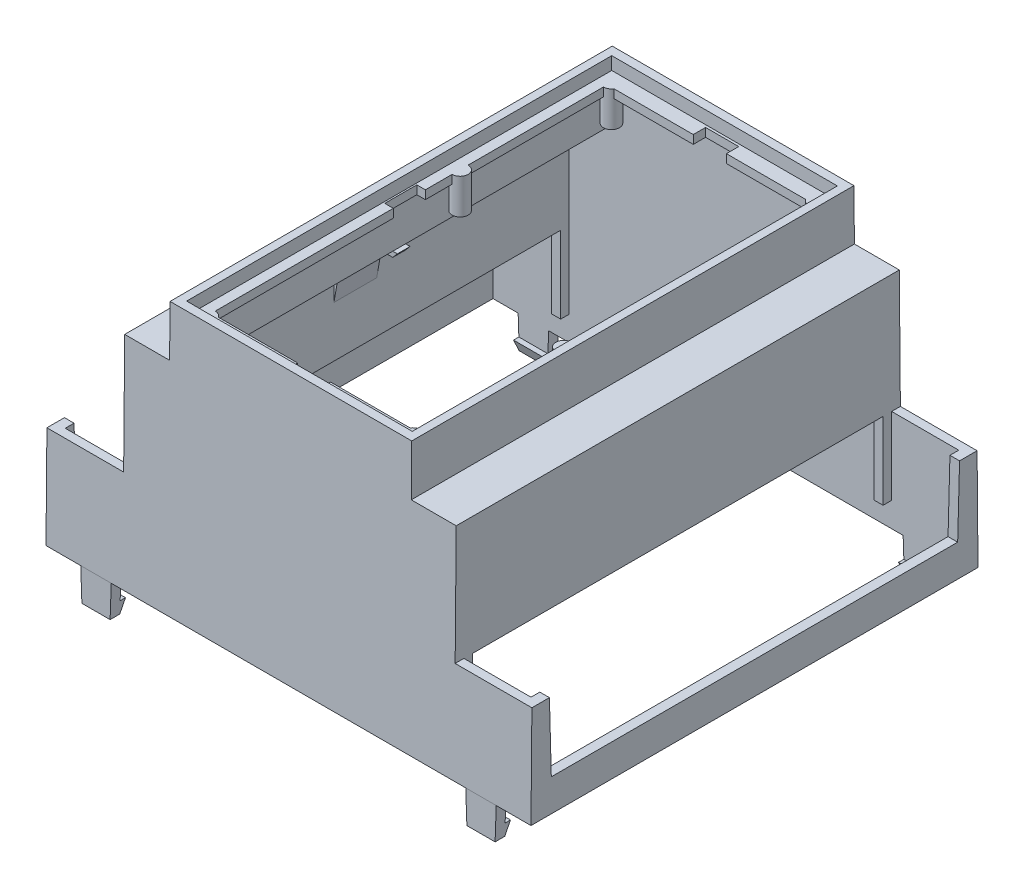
ISO-10303-21;
HEADER;
FILE_DESCRIPTION(('STEP AP214'),'2;1');
FILE_NAME('part.step','',(''),(''),'','','');
FILE_SCHEMA(('AUTOMOTIVE_DESIGN { 1 0 10303 214 1 1 1 1 }'));
ENDSEC;
DATA;
#1=APPLICATION_CONTEXT('core data for automotive mechanical design processes');
#2=APPLICATION_PROTOCOL_DEFINITION('international standard','automotive_design',2000,#1);
#3=PRODUCT_CONTEXT('',#1,'mechanical');
#4=PRODUCT('Part','Part','',(#3));
#5=PRODUCT_RELATED_PRODUCT_CATEGORY('part','',(#4));
#6=PRODUCT_DEFINITION_FORMATION('','',#4);
#7=PRODUCT_DEFINITION_CONTEXT('part definition',#1,'design');
#8=PRODUCT_DEFINITION('design','',#6,#7);
#9=PRODUCT_DEFINITION_SHAPE('','',#8);
#10=(LENGTH_UNIT() NAMED_UNIT(*) SI_UNIT(.MILLI.,.METRE.));
#11=(NAMED_UNIT(*) PLANE_ANGLE_UNIT() SI_UNIT($,.RADIAN.));
#12=(NAMED_UNIT(*) SI_UNIT($,.STERADIAN.) SOLID_ANGLE_UNIT());
#13=UNCERTAINTY_MEASURE_WITH_UNIT(LENGTH_MEASURE(1.E-05),#10,'distance_accuracy_value','');
#14=(GEOMETRIC_REPRESENTATION_CONTEXT(3) GLOBAL_UNCERTAINTY_ASSIGNED_CONTEXT((#13)) GLOBAL_UNIT_ASSIGNED_CONTEXT((#10,
#11,#12)) REPRESENTATION_CONTEXT('',''));
#15=CARTESIAN_POINT('',(0.,0.,0.));
#16=DIRECTION('',(0.,0.,1.));
#17=DIRECTION('',(1.,0.,0.));
#18=AXIS2_PLACEMENT_3D('',#15,#16,#17);
#19=CARTESIAN_POINT('',(-19.2,51.9,-3.));
#20=DIRECTION('',(-1.,0.,0.));
#21=DIRECTION('',(0.,0.,1.));
#22=AXIS2_PLACEMENT_3D('',#19,#20,#21);
#23=PLANE('',#22);
#24=DIRECTION('',(0.,0.,-1.));
#25=VECTOR('',#24,1.);
#26=CARTESIAN_POINT('',(-19.2,52.7,0.));
#27=LINE('',#26,#25);
#28=CARTESIAN_POINT('',(-19.2,52.7,-3.));
#29=VERTEX_POINT('',#28);
#30=CARTESIAN_POINT('',(-19.2,52.7,-8.));
#31=VERTEX_POINT('',#30);
#32=EDGE_CURVE('E764',#29,#31,#27,.T.);
#33=ORIENTED_EDGE('',*,*,#32,.T.);
#34=DIRECTION('',(0.,1.,0.));
#35=VECTOR('',#34,1.);
#36=CARTESIAN_POINT('',(-19.2,47.7,-8.));
#37=LINE('',#36,#35);
#38=CARTESIAN_POINT('',(-19.2,54.3,-8.));
#39=VERTEX_POINT('',#38);
#40=EDGE_CURVE('E11',#31,#39,#37,.T.);
#41=ORIENTED_EDGE('',*,*,#40,.T.);
#42=DIRECTION('',(0.,0.,1.));
#43=VECTOR('',#42,1.);
#44=CARTESIAN_POINT('',(-19.2,54.3,-3.));
#45=LINE('',#44,#43);
#46=CARTESIAN_POINT('',(-19.2,54.3,-3.));
#47=VERTEX_POINT('',#46);
#48=EDGE_CURVE('E748',#39,#47,#45,.T.);
#49=ORIENTED_EDGE('',*,*,#48,.T.);
#50=DIRECTION('',(0.,1.,0.));
#51=VECTOR('',#50,1.);
#52=CARTESIAN_POINT('',(-19.2,51.9,-3.));
#53=LINE('',#52,#51);
#54=EDGE_CURVE('E1024',#29,#47,#53,.T.);
#55=ORIENTED_EDGE('',*,*,#54,.F.);
#56=EDGE_LOOP('',(#33,#41,#49,#55));
#57=FACE_BOUND('',#56,.T.);
#58=ADVANCED_FACE('F38',(#57),#23,.F.);
#59=CARTESIAN_POINT('',(19.2,51.9,3.00000000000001));
#60=DIRECTION('',(1.,0.,0.));
#61=DIRECTION('',(0.,0.,-1.));
#62=AXIS2_PLACEMENT_3D('',#59,#60,#61);
#63=PLANE('',#62);
#64=DIRECTION('',(0.,0.,1.));
#65=VECTOR('',#64,1.);
#66=CARTESIAN_POINT('',(19.2,52.7,0.));
#67=LINE('',#66,#65);
#68=CARTESIAN_POINT('',(19.2,52.7,3.00000000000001));
#69=VERTEX_POINT('',#68);
#70=CARTESIAN_POINT('',(19.2,52.7,8.));
#71=VERTEX_POINT('',#70);
#72=EDGE_CURVE('E1051',#69,#71,#67,.T.);
#73=ORIENTED_EDGE('',*,*,#72,.T.);
#74=DIRECTION('',(0.,1.,0.));
#75=VECTOR('',#74,1.);
#76=CARTESIAN_POINT('',(19.2,47.7,8.));
#77=LINE('',#76,#75);
#78=CARTESIAN_POINT('',(19.2,54.3,8.));
#79=VERTEX_POINT('',#78);
#80=EDGE_CURVE('E1646',#71,#79,#77,.T.);
#81=ORIENTED_EDGE('',*,*,#80,.T.);
#82=DIRECTION('',(0.,0.,-1.));
#83=VECTOR('',#82,1.);
#84=CARTESIAN_POINT('',(19.2,54.3,3.00000000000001));
#85=LINE('',#84,#83);
#86=CARTESIAN_POINT('',(19.2,54.3,3.00000000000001));
#87=VERTEX_POINT('',#86);
#88=EDGE_CURVE('E969',#79,#87,#85,.T.);
#89=ORIENTED_EDGE('',*,*,#88,.T.);
#90=DIRECTION('',(0.,1.,0.));
#91=VECTOR('',#90,1.);
#92=CARTESIAN_POINT('',(19.2,51.9,3.00000000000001));
#93=LINE('',#92,#91);
#94=EDGE_CURVE('E1006',#69,#87,#93,.T.);
#95=ORIENTED_EDGE('',*,*,#94,.F.);
#96=EDGE_LOOP('',(#73,#81,#89,#95));
#97=FACE_BOUND('',#96,.T.);
#98=ADVANCED_FACE('F1651',(#97),#63,.F.);
#99=CARTESIAN_POINT('',(-29.3,124.166324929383,-40.));
#100=DIRECTION('',(-1.,0.,0.));
#101=DIRECTION('',(0.,0.,1.));
#102=AXIS2_PLACEMENT_3D('',#99,#100,#101);
#103=PLANE('',#102);
#104=DIRECTION('',(0.,0.,-1.));
#105=VECTOR('',#104,1.);
#106=CARTESIAN_POINT('',(-29.3,44.5,1.2));
#107=LINE('',#106,#105);
#108=CARTESIAN_POINT('',(-29.3,44.5,1.2));
#109=VERTEX_POINT('',#108);
#110=CARTESIAN_POINT('',(-29.3,44.5,-1.2));
#111=VERTEX_POINT('',#110);
#112=EDGE_CURVE('E941',#109,#111,#107,.T.);
#113=ORIENTED_EDGE('',*,*,#112,.F.);
#114=DIRECTION('',(0.,-1.,0.));
#115=VECTOR('',#114,1.);
#116=CARTESIAN_POINT('',(-29.3,45.5,1.2));
#117=LINE('',#116,#115);
#118=CARTESIAN_POINT('',(-29.3,45.5,1.2));
#119=VERTEX_POINT('',#118);
#120=EDGE_CURVE('E918',#119,#109,#117,.T.);
#121=ORIENTED_EDGE('',*,*,#120,.F.);
#122=DIRECTION('',(0.,0.,-1.));
#123=VECTOR('',#122,1.);
#124=CARTESIAN_POINT('',(-29.3,45.5,-40.));
#125=LINE('',#124,#123);
#126=CARTESIAN_POINT('',(-29.3,45.5,40.));
#127=VERTEX_POINT('',#126);
#128=EDGE_CURVE('E1199',#127,#119,#125,.T.);
#129=ORIENTED_EDGE('',*,*,#128,.F.);
#130=DIRECTION('',(0.,-1.,0.));
#131=VECTOR('',#130,1.);
#132=CARTESIAN_POINT('',(-29.3,124.166324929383,40.));
#133=LINE('',#132,#131);
#134=CARTESIAN_POINT('',(-29.3,10.6,40.));
#135=VERTEX_POINT('',#134);
#136=EDGE_CURVE('E1225',#127,#135,#133,.T.);
#137=ORIENTED_EDGE('',*,*,#136,.T.);
#138=DIRECTION('',(0.,0.,-1.));
#139=VECTOR('',#138,1.);
#140=CARTESIAN_POINT('',(-29.3,10.6,-40.));
#141=LINE('',#140,#139);
#142=CARTESIAN_POINT('',(-29.3,10.6,38.4));
#143=VERTEX_POINT('',#142);
#144=EDGE_CURVE('E1223',#135,#143,#141,.T.);
#145=ORIENTED_EDGE('',*,*,#144,.T.);
#146=DIRECTION('',(0.,-1.,0.));
#147=VECTOR('',#146,1.);
#148=CARTESIAN_POINT('',(-29.3,123.702786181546,38.4));
#149=LINE('',#148,#147);
#150=CARTESIAN_POINT('',(-29.3,25.,38.4));
#151=VERTEX_POINT('',#150);
#152=EDGE_CURVE('E1234',#151,#143,#149,.T.);
#153=ORIENTED_EDGE('',*,*,#152,.F.);
#154=DIRECTION('',(0.,0.,-1.));
#155=VECTOR('',#154,1.);
#156=CARTESIAN_POINT('',(-29.3,25.,-40.));
#157=LINE('',#156,#155);
#158=CARTESIAN_POINT('',(-29.3,25.,-38.4));
#159=VERTEX_POINT('',#158);
#160=EDGE_CURVE('E1191',#151,#159,#157,.T.);
#161=ORIENTED_EDGE('',*,*,#160,.T.);
#162=DIRECTION('',(0.,1.,0.));
#163=VECTOR('',#162,1.);
#164=CARTESIAN_POINT('',(-29.3,123.702786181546,-38.4));
#165=LINE('',#164,#163);
#166=CARTESIAN_POINT('',(-29.3,10.6,-38.4));
#167=VERTEX_POINT('',#166);
#168=EDGE_CURVE('E1611',#167,#159,#165,.T.);
#169=ORIENTED_EDGE('',*,*,#168,.F.);
#170=CARTESIAN_POINT('',(-29.3,10.6,-40.));
#171=VERTEX_POINT('',#170);
#172=EDGE_CURVE('E1215',#167,#171,#141,.T.);
#173=ORIENTED_EDGE('',*,*,#172,.T.);
#174=DIRECTION('',(0.,-1.,0.));
#175=VECTOR('',#174,1.);
#176=CARTESIAN_POINT('',(-29.3,124.166324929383,-40.));
#177=LINE('',#176,#175);
#178=CARTESIAN_POINT('',(-29.3,45.5,-40.));
#179=VERTEX_POINT('',#178);
#180=EDGE_CURVE('E1227',#179,#171,#177,.T.);
#181=ORIENTED_EDGE('',*,*,#180,.F.);
#182=CARTESIAN_POINT('',(-29.3,45.5,-1.2));
#183=VERTEX_POINT('',#182);
#184=EDGE_CURVE('E1203',#183,#179,#125,.T.);
#185=ORIENTED_EDGE('',*,*,#184,.F.);
#186=DIRECTION('',(0.,-1.,0.));
#187=VECTOR('',#186,1.);
#188=CARTESIAN_POINT('',(-29.3,45.5,-1.2));
#189=LINE('',#188,#187);
#190=EDGE_CURVE('E930',#183,#111,#189,.T.);
#191=ORIENTED_EDGE('',*,*,#190,.T.);
#192=EDGE_LOOP('',(#113,#121,#129,#137,#145,#153,#161,#169,#173,#181,#185,#191));
#193=FACE_BOUND('',#192,.T.);
#194=DIRECTION('',(0.,-1.,0.));
#195=VECTOR('',#194,1.);
#196=CARTESIAN_POINT('',(-29.3,39.1,4.));
#197=LINE('',#196,#195);
#198=CARTESIAN_POINT('',(-29.3,39.1,4.));
#199=VERTEX_POINT('',#198);
#200=CARTESIAN_POINT('',(-29.3,34.5,4.));
#201=VERTEX_POINT('',#200);
#202=EDGE_CURVE('E864',#199,#201,#197,.T.);
#203=ORIENTED_EDGE('',*,*,#202,.F.);
#204=DIRECTION('',(0.,0.,-1.));
#205=VECTOR('',#204,1.);
#206=CARTESIAN_POINT('',(-29.3,39.1,4.));
#207=LINE('',#206,#205);
#208=CARTESIAN_POINT('',(-29.3,39.1,-4.));
#209=VERTEX_POINT('',#208);
#210=EDGE_CURVE('E872',#199,#209,#207,.T.);
#211=ORIENTED_EDGE('',*,*,#210,.T.);
#212=DIRECTION('',(0.,-1.,0.));
#213=VECTOR('',#212,1.);
#214=CARTESIAN_POINT('',(-29.3,39.1,-4.));
#215=LINE('',#214,#213);
#216=CARTESIAN_POINT('',(-29.3,34.5,-4.));
#217=VERTEX_POINT('',#216);
#218=EDGE_CURVE('E863',#209,#217,#215,.T.);
#219=ORIENTED_EDGE('',*,*,#218,.T.);
#220=DIRECTION('',(0.,0.,-1.));
#221=VECTOR('',#220,1.);
#222=CARTESIAN_POINT('',(-29.3,34.5,4.));
#223=LINE('',#222,#221);
#224=EDGE_CURVE('E883',#201,#217,#223,.T.);
#225=ORIENTED_EDGE('',*,*,#224,.F.);
#226=EDGE_LOOP('',(#203,#211,#219,#225));
#227=FACE_BOUND('',#226,.T.);
#228=ADVANCED_FACE('F1784',(#193,#227),#103,.F.);
#229=CARTESIAN_POINT('',(0.,45.5,0.));
#230=DIRECTION('',(0.,1.,0.));
#231=DIRECTION('',(0.,0.,1.));
#232=AXIS2_PLACEMENT_3D('',#229,#230,#231);
#233=PLANE('',#232);
#234=CARTESIAN_POINT('',(27.5,45.5,-37.));
#235=DIRECTION('',(0.,1.,0.));
#236=DIRECTION('',(0.,0.,1.));
#237=AXIS2_PLACEMENT_3D('',#234,#235,#236);
#238=CIRCLE('',#237,1.3);
#239=CARTESIAN_POINT('',(27.5,45.5,-35.7));
#240=VERTEX_POINT('',#239);
#241=EDGE_CURVE('E1630',#240,#240,#238,.F.);
#242=ORIENTED_EDGE('',*,*,#241,.F.);
#243=EDGE_LOOP('',(#242));
#244=FACE_BOUND('',#243,.T.);
#245=DIRECTION('',(-1.,0.,0.));
#246=VECTOR('',#245,1.);
#247=CARTESIAN_POINT('',(29.3,45.5,-1.2));
#248=LINE('',#247,#246);
#249=CARTESIAN_POINT('',(29.3,45.5,-1.2));
#250=VERTEX_POINT('',#249);
#251=CARTESIAN_POINT('',(21.1,45.5,-1.2));
#252=VERTEX_POINT('',#251);
#253=EDGE_CURVE('E900',#250,#252,#248,.T.);
#254=ORIENTED_EDGE('',*,*,#253,.T.);
#255=DIRECTION('',(0.,0.,1.));
#256=VECTOR('',#255,1.);
#257=CARTESIAN_POINT('',(21.1,45.5,-40.));
#258=LINE('',#257,#256);
#259=CARTESIAN_POINT('',(21.1,45.5,-40.));
#260=VERTEX_POINT('',#259);
#261=EDGE_CURVE('E1181',#260,#252,#258,.T.);
#262=ORIENTED_EDGE('',*,*,#261,.F.);
#263=DIRECTION('',(1.,0.,0.));
#264=VECTOR('',#263,1.);
#265=CARTESIAN_POINT('',(-29.3,45.5,-40.));
#266=LINE('',#265,#264);
#267=CARTESIAN_POINT('',(29.3,45.5,-40.));
#268=VERTEX_POINT('',#267);
#269=EDGE_CURVE('E1202',#260,#268,#266,.T.);
#270=ORIENTED_EDGE('',*,*,#269,.T.);
#271=DIRECTION('',(0.,0.,1.));
#272=VECTOR('',#271,1.);
#273=CARTESIAN_POINT('',(29.3,45.5,-40.));
#274=LINE('',#273,#272);
#275=EDGE_CURVE('E1208',#268,#250,#274,.T.);
#276=ORIENTED_EDGE('',*,*,#275,.T.);
#277=EDGE_LOOP('',(#254,#262,#270,#276));
#278=FACE_BOUND('',#277,.T.);
#279=ADVANCED_FACE('F1992',(#244,#278),#233,.F.);
#280=CARTESIAN_POINT('',(-27.5,45.5,-37.));
#281=DIRECTION('',(0.,1.,0.));
#282=DIRECTION('',(0.,0.,1.));
#283=AXIS2_PLACEMENT_3D('',#280,#281,#282);
#284=CIRCLE('',#283,1.3);
#285=CARTESIAN_POINT('',(-27.5,45.5,-35.7));
#286=VERTEX_POINT('',#285);
#287=EDGE_CURVE('E1624',#286,#286,#284,.F.);
#288=ORIENTED_EDGE('',*,*,#287,.F.);
#289=EDGE_LOOP('',(#288));
#290=FACE_BOUND('',#289,.T.);
#291=DIRECTION('',(-1.,0.,0.));
#292=VECTOR('',#291,1.);
#293=CARTESIAN_POINT('',(-20.25,45.5,-1.2));
#294=LINE('',#293,#292);
#295=CARTESIAN_POINT('',(-21.1,45.5,-1.2));
#296=VERTEX_POINT('',#295);
#297=EDGE_CURVE('E914',#296,#183,#294,.T.);
#298=ORIENTED_EDGE('',*,*,#297,.T.);
#299=ORIENTED_EDGE('',*,*,#184,.T.);
#300=CARTESIAN_POINT('',(-21.1,45.5,-40.));
#301=VERTEX_POINT('',#300);
#302=EDGE_CURVE('E1204',#179,#301,#266,.T.);
#303=ORIENTED_EDGE('',*,*,#302,.T.);
#304=DIRECTION('',(0.,0.,1.));
#305=VECTOR('',#304,1.);
#306=CARTESIAN_POINT('',(-21.1,45.5,-40.));
#307=LINE('',#306,#305);
#308=EDGE_CURVE('E1173',#301,#296,#307,.T.);
#309=ORIENTED_EDGE('',*,*,#308,.T.);
#310=EDGE_LOOP('',(#298,#299,#303,#309));
#311=FACE_BOUND('',#310,.T.);
#312=ADVANCED_FACE('F2098',(#290,#311),#233,.F.);
#313=CARTESIAN_POINT('',(0.,0.,-41.8));
#314=DIRECTION('',(0.,0.,1.));
#315=DIRECTION('',(1.,0.,0.));
#316=AXIS2_PLACEMENT_3D('',#313,#314,#315);
#317=PLANE('',#316);
#318=DIRECTION('',(0.0348994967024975,-0.999390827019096,0.));
#319=VECTOR('',#318,1.);
#320=CARTESIAN_POINT('',(-38.5934122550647,-1.34771165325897,-41.8));
#321=LINE('',#320,#319);
#322=CARTESIAN_POINT('',(-38.85,6.,-41.8));
#323=VERTEX_POINT('',#322);
#324=CARTESIAN_POINT('',(-38.6404753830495,0.,-41.8));
#325=VERTEX_POINT('',#324);
#326=EDGE_CURVE('E1488',#323,#325,#321,.T.);
#327=ORIENTED_EDGE('',*,*,#326,.F.);
#328=DIRECTION('',(1.,0.,0.));
#329=VECTOR('',#328,1.);
#330=CARTESIAN_POINT('',(0.,6.,-41.8));
#331=LINE('',#330,#329);
#332=CARTESIAN_POINT('',(-33.15,6.,-41.8));
#333=VERTEX_POINT('',#332);
#334=EDGE_CURVE('E1623',#323,#333,#331,.T.);
#335=ORIENTED_EDGE('',*,*,#334,.T.);
#336=DIRECTION('',(0.0348994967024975,0.999390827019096,0.));
#337=VECTOR('',#336,1.);
#338=CARTESIAN_POINT('',(-33.318893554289,1.16352140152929,-41.8));
#339=LINE('',#338,#337);
#340=CARTESIAN_POINT('',(-33.3595246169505,0.,-41.8));
#341=VERTEX_POINT('',#340);
#342=EDGE_CURVE('E1494',#341,#333,#339,.T.);
#343=ORIENTED_EDGE('',*,*,#342,.F.);
#344=DIRECTION('',(1.,0.,0.));
#345=VECTOR('',#344,1.);
#346=CARTESIAN_POINT('',(0.,0.,-41.8));
#347=LINE('',#346,#345);
#348=EDGE_CURVE('E1491',#325,#341,#347,.T.);
#349=ORIENTED_EDGE('',*,*,#348,.F.);
#350=EDGE_LOOP('',(#327,#335,#343,#349));
#351=FACE_BOUND('',#350,.T.);
#352=ADVANCED_FACE('F2108',(#351),#317,.F.);
#353=CARTESIAN_POINT('',(0.,0.,41.8));
#354=DIRECTION('',(0.,0.,1.));
#355=DIRECTION('',(1.,0.,0.));
#356=AXIS2_PLACEMENT_3D('',#353,#354,#355);
#357=PLANE('',#356);
#358=DIRECTION('',(1.,0.,0.));
#359=VECTOR('',#358,1.);
#360=CARTESIAN_POINT('',(0.,6.,41.8));
#361=LINE('',#360,#359);
#362=CARTESIAN_POINT('',(-38.85,6.,41.8));
#363=VERTEX_POINT('',#362);
#364=CARTESIAN_POINT('',(-33.15,6.,41.8));
#365=VERTEX_POINT('',#364);
#366=EDGE_CURVE('E1619',#363,#365,#361,.T.);
#367=ORIENTED_EDGE('',*,*,#366,.F.);
#368=DIRECTION('',(0.0348994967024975,-0.999390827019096,0.));
#369=VECTOR('',#368,1.);
#370=CARTESIAN_POINT('',(-38.5934122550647,-1.34771165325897,41.8));
#371=LINE('',#370,#369);
#372=CARTESIAN_POINT('',(-38.6404753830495,0.,41.8));
#373=VERTEX_POINT('',#372);
#374=EDGE_CURVE('E1468',#363,#373,#371,.T.);
#375=ORIENTED_EDGE('',*,*,#374,.T.);
#376=DIRECTION('',(1.,0.,0.));
#377=VECTOR('',#376,1.);
#378=CARTESIAN_POINT('',(0.,0.,41.8));
#379=LINE('',#378,#377);
#380=CARTESIAN_POINT('',(-33.3595246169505,0.,41.8));
#381=VERTEX_POINT('',#380);
#382=EDGE_CURVE('E1470',#373,#381,#379,.T.);
#383=ORIENTED_EDGE('',*,*,#382,.T.);
#384=DIRECTION('',(0.0348994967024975,0.999390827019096,0.));
#385=VECTOR('',#384,1.);
#386=CARTESIAN_POINT('',(-33.318893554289,1.16352140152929,41.8));
#387=LINE('',#386,#385);
#388=EDGE_CURVE('E1472',#381,#365,#387,.T.);
#389=ORIENTED_EDGE('',*,*,#388,.T.);
#390=EDGE_LOOP('',(#367,#375,#383,#389));
#391=FACE_BOUND('',#390,.T.);
#392=ADVANCED_FACE('F2121',(#391),#357,.T.);
#393=CARTESIAN_POINT('',(27.5,45.5,37.));
#394=DIRECTION('',(0.,1.,0.));
#395=DIRECTION('',(0.,0.,1.));
#396=AXIS2_PLACEMENT_3D('',#393,#394,#395);
#397=CIRCLE('',#396,1.3);
#398=CARTESIAN_POINT('',(27.5,45.5,38.3));
#399=VERTEX_POINT('',#398);
#400=EDGE_CURVE('E1633',#399,#399,#397,.F.);
#401=ORIENTED_EDGE('',*,*,#400,.F.);
#402=EDGE_LOOP('',(#401));
#403=FACE_BOUND('',#402,.T.);
#404=CARTESIAN_POINT('',(21.1,45.5,1.2));
#405=VERTEX_POINT('',#404);
#406=CARTESIAN_POINT('',(21.1,45.5,40.));
#407=VERTEX_POINT('',#406);
#408=EDGE_CURVE('E1168',#405,#407,#258,.T.);
#409=ORIENTED_EDGE('',*,*,#408,.F.);
#410=DIRECTION('',(-1.,0.,0.));
#411=VECTOR('',#410,1.);
#412=CARTESIAN_POINT('',(29.3,45.5,1.2));
#413=LINE('',#412,#411);
#414=CARTESIAN_POINT('',(29.3,45.5,1.2));
#415=VERTEX_POINT('',#414);
#416=EDGE_CURVE('E890',#415,#405,#413,.T.);
#417=ORIENTED_EDGE('',*,*,#416,.F.);
#418=CARTESIAN_POINT('',(29.3,45.5,40.));
#419=VERTEX_POINT('',#418);
#420=EDGE_CURVE('E1207',#415,#419,#274,.T.);
#421=ORIENTED_EDGE('',*,*,#420,.T.);
#422=DIRECTION('',(-1.,0.,0.));
#423=VECTOR('',#422,1.);
#424=CARTESIAN_POINT('',(-29.3,45.5,40.));
#425=LINE('',#424,#423);
#426=EDGE_CURVE('E1212',#419,#407,#425,.T.);
#427=ORIENTED_EDGE('',*,*,#426,.T.);
#428=EDGE_LOOP('',(#409,#417,#421,#427));
#429=FACE_BOUND('',#428,.T.);
#430=ADVANCED_FACE('F2110',(#403,#429),#233,.F.);
#431=CARTESIAN_POINT('',(-46.,25.,-38.3517696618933));
#432=DIRECTION('',(0.,1.,0.));
#433=DIRECTION('',(0.,0.,1.));
#434=AXIS2_PLACEMENT_3D('',#431,#432,#433);
#435=PLANE('',#434);
#436=DIRECTION('',(1.,0.,0.));
#437=VECTOR('',#436,1.);
#438=CARTESIAN_POINT('',(-31.,25.,-38.4));
#439=LINE('',#438,#437);
#440=CARTESIAN_POINT('',(-31.,25.,-38.4));
#441=VERTEX_POINT('',#440);
#442=EDGE_CURVE('E1249',#441,#159,#439,.T.);
#443=ORIENTED_EDGE('',*,*,#442,.T.);
#444=ORIENTED_EDGE('',*,*,#160,.F.);
#445=DIRECTION('',(-1.,0.,0.));
#446=VECTOR('',#445,1.);
#447=CARTESIAN_POINT('',(-31.,25.,38.4));
#448=LINE('',#447,#446);
#449=CARTESIAN_POINT('',(-31.,25.,38.4));
#450=VERTEX_POINT('',#449);
#451=EDGE_CURVE('E1257',#151,#450,#448,.T.);
#452=ORIENTED_EDGE('',*,*,#451,.T.);
#453=DIRECTION('',(0.,0.,1.));
#454=VECTOR('',#453,1.);
#455=CARTESIAN_POINT('',(-31.,25.,41.8));
#456=LINE('',#455,#454);
#457=EDGE_CURVE('E1307',#441,#450,#456,.T.);
#458=ORIENTED_EDGE('',*,*,#457,.F.);
#459=EDGE_LOOP('',(#443,#444,#452,#458));
#460=FACE_BOUND('',#459,.T.);
#461=ADVANCED_FACE('F2120',(#460),#435,.F.);
#462=CARTESIAN_POINT('',(-43.55,10.6,40.));
#463=DIRECTION('',(0.,1.,0.));
#464=DIRECTION('',(0.,0.,1.));
#465=AXIS2_PLACEMENT_3D('',#462,#463,#464);
#466=PLANE('',#465);
#467=DIRECTION('',(1.,0.,0.));
#468=VECTOR('',#467,1.);
#469=CARTESIAN_POINT('',(-31.,10.6,-38.4));
#470=LINE('',#469,#468);
#471=CARTESIAN_POINT('',(29.3,10.6,-38.4));
#472=VERTEX_POINT('',#471);
#473=CARTESIAN_POINT('',(31.,10.6,-38.4));
#474=VERTEX_POINT('',#473);
#475=EDGE_CURVE('E1240',#472,#474,#470,.T.);
#476=ORIENTED_EDGE('',*,*,#475,.F.);
#477=DIRECTION('',(0.,0.,1.));
#478=VECTOR('',#477,1.);
#479=CARTESIAN_POINT('',(29.3,10.6,-40.));
#480=LINE('',#479,#478);
#481=CARTESIAN_POINT('',(29.3,10.6,-40.));
#482=VERTEX_POINT('',#481);
#483=EDGE_CURVE('E1219',#482,#472,#480,.T.);
#484=ORIENTED_EDGE('',*,*,#483,.F.);
#485=DIRECTION('',(1.,0.,0.));
#486=VECTOR('',#485,1.);
#487=CARTESIAN_POINT('',(-43.55,10.6,-40.));
#488=LINE('',#487,#486);
#489=CARTESIAN_POINT('',(31.,10.6,-40.));
#490=VERTEX_POINT('',#489);
#491=EDGE_CURVE('E1363',#482,#490,#488,.T.);
#492=ORIENTED_EDGE('',*,*,#491,.T.);
#493=DIRECTION('',(0.,0.,1.));
#494=VECTOR('',#493,1.);
#495=CARTESIAN_POINT('',(31.,10.6,40.));
#496=LINE('',#495,#494);
#497=EDGE_CURVE('E1595',#490,#474,#496,.T.);
#498=ORIENTED_EDGE('',*,*,#497,.T.);
#499=EDGE_LOOP('',(#476,#484,#492,#498));
#500=FACE_BOUND('',#499,.T.);
#501=ADVANCED_FACE('F2747',(#500),#466,.F.);
#502=DIRECTION('',(1.,0.,0.));
#503=VECTOR('',#502,1.);
#504=CARTESIAN_POINT('',(-43.55,10.6,40.));
#505=LINE('',#504,#503);
#506=CARTESIAN_POINT('',(29.3,10.6,40.));
#507=VERTEX_POINT('',#506);
#508=CARTESIAN_POINT('',(31.,10.6,40.));
#509=VERTEX_POINT('',#508);
#510=EDGE_CURVE('E1359',#507,#509,#505,.T.);
#511=ORIENTED_EDGE('',*,*,#510,.F.);
#512=CARTESIAN_POINT('',(29.3,10.6,38.4));
#513=VERTEX_POINT('',#512);
#514=EDGE_CURVE('E1222',#513,#507,#480,.T.);
#515=ORIENTED_EDGE('',*,*,#514,.F.);
#516=DIRECTION('',(-1.,0.,0.));
#517=VECTOR('',#516,1.);
#518=CARTESIAN_POINT('',(-31.,10.6,38.4));
#519=LINE('',#518,#517);
#520=CARTESIAN_POINT('',(31.,10.6,38.4));
#521=VERTEX_POINT('',#520);
#522=EDGE_CURVE('E1241',#521,#513,#519,.T.);
#523=ORIENTED_EDGE('',*,*,#522,.F.);
#524=EDGE_CURVE('E1594',#521,#509,#496,.T.);
#525=ORIENTED_EDGE('',*,*,#524,.T.);
#526=EDGE_LOOP('',(#511,#515,#523,#525));
#527=FACE_BOUND('',#526,.T.);
#528=ADVANCED_FACE('F2737',(#527),#466,.F.);
#529=CARTESIAN_POINT('',(-31.,123.702786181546,38.4));
#530=DIRECTION('',(0.,0.,1.));
#531=DIRECTION('',(1.,0.,0.));
#532=AXIS2_PLACEMENT_3D('',#529,#530,#531);
#533=PLANE('',#532);
#534=ORIENTED_EDGE('',*,*,#522,.T.);
#535=DIRECTION('',(0.,1.,0.));
#536=VECTOR('',#535,1.);
#537=CARTESIAN_POINT('',(29.3,123.702786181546,38.4));
#538=LINE('',#537,#536);
#539=CARTESIAN_POINT('',(29.3,25.,38.4));
#540=VERTEX_POINT('',#539);
#541=EDGE_CURVE('E1237',#513,#540,#538,.T.);
#542=ORIENTED_EDGE('',*,*,#541,.T.);
#543=CARTESIAN_POINT('',(31.,25.,38.4));
#544=VERTEX_POINT('',#543);
#545=EDGE_CURVE('E1253',#544,#540,#448,.T.);
#546=ORIENTED_EDGE('',*,*,#545,.F.);
#547=DIRECTION('',(0.,-1.,0.));
#548=VECTOR('',#547,1.);
#549=CARTESIAN_POINT('',(31.,123.702786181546,38.4));
#550=LINE('',#549,#548);
#551=EDGE_CURVE('E1261',#544,#521,#550,.T.);
#552=ORIENTED_EDGE('',*,*,#551,.T.);
#553=EDGE_LOOP('',(#534,#542,#546,#552));
#554=FACE_BOUND('',#553,.T.);
#555=ADVANCED_FACE('F2708',(#554),#533,.F.);
#556=CARTESIAN_POINT('',(-31.,123.702786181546,-38.4));
#557=DIRECTION('',(0.,0.,-1.));
#558=DIRECTION('',(-1.,0.,0.));
#559=AXIS2_PLACEMENT_3D('',#556,#557,#558);
#560=PLANE('',#559);
#561=CARTESIAN_POINT('',(29.3,25.,-38.4));
#562=VERTEX_POINT('',#561);
#563=CARTESIAN_POINT('',(31.,25.,-38.4));
#564=VERTEX_POINT('',#563);
#565=EDGE_CURVE('E1244',#562,#564,#439,.T.);
#566=ORIENTED_EDGE('',*,*,#565,.F.);
#567=DIRECTION('',(0.,-1.,0.));
#568=VECTOR('',#567,1.);
#569=CARTESIAN_POINT('',(29.3,123.702786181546,-38.4));
#570=LINE('',#569,#568);
#571=EDGE_CURVE('E1614',#562,#472,#570,.T.);
#572=ORIENTED_EDGE('',*,*,#571,.T.);
#573=ORIENTED_EDGE('',*,*,#475,.T.);
#574=DIRECTION('',(0.,-1.,0.));
#575=VECTOR('',#574,1.);
#576=CARTESIAN_POINT('',(31.,123.702786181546,-38.4));
#577=LINE('',#576,#575);
#578=EDGE_CURVE('E1252',#564,#474,#577,.T.);
#579=ORIENTED_EDGE('',*,*,#578,.F.);
#580=EDGE_LOOP('',(#566,#572,#573,#579));
#581=FACE_BOUND('',#580,.T.);
#582=ADVANCED_FACE('F2696',(#581),#560,.F.);
#583=CARTESIAN_POINT('',(-31.,10.6,-40.));
#584=VERTEX_POINT('',#583);
#585=EDGE_CURVE('E1360',#584,#171,#488,.T.);
#586=ORIENTED_EDGE('',*,*,#585,.T.);
#587=ORIENTED_EDGE('',*,*,#172,.F.);
#588=CARTESIAN_POINT('',(-31.,10.6,-38.4));
#589=VERTEX_POINT('',#588);
#590=EDGE_CURVE('E1246',#589,#167,#470,.T.);
#591=ORIENTED_EDGE('',*,*,#590,.F.);
#592=DIRECTION('',(0.,0.,-1.));
#593=VECTOR('',#592,1.);
#594=CARTESIAN_POINT('',(-31.,10.6,40.));
#595=LINE('',#594,#593);
#596=EDGE_CURVE('E1598',#589,#584,#595,.T.);
#597=ORIENTED_EDGE('',*,*,#596,.T.);
#598=EDGE_LOOP('',(#586,#587,#591,#597));
#599=FACE_BOUND('',#598,.T.);
#600=ADVANCED_FACE('F2648',(#599),#466,.F.);
#601=CARTESIAN_POINT('',(0.,25.,41.8));
#602=DIRECTION('',(0.,-1.,0.));
#603=DIRECTION('',(1.,0.,0.));
#604=AXIS2_PLACEMENT_3D('',#601,#602,#603);
#605=PLANE('',#604);
#606=DIRECTION('',(0.,0.,-1.));
#607=VECTOR('',#606,1.);
#608=CARTESIAN_POINT('',(45.35,25.,41.8));
#609=LINE('',#608,#607);
#610=CARTESIAN_POINT('',(45.35,25.,-38.3517696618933));
#611=VERTEX_POINT('',#610);
#612=CARTESIAN_POINT('',(45.35,25.,-41.6313609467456));
#613=VERTEX_POINT('',#612);
#614=EDGE_CURVE('E1561',#611,#613,#609,.T.);
#615=ORIENTED_EDGE('',*,*,#614,.T.);
#616=DIRECTION('',(-1.,0.,0.));
#617=VECTOR('',#616,1.);
#618=CARTESIAN_POINT('',(0.,25.,-41.6313609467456));
#619=LINE('',#618,#617);
#620=CARTESIAN_POINT('',(31.,25.,-41.6313609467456));
#621=VERTEX_POINT('',#620);
#622=EDGE_CURVE('E1129',#613,#621,#619,.T.);
#623=ORIENTED_EDGE('',*,*,#622,.T.);
#624=DIRECTION('',(0.,0.,-1.));
#625=VECTOR('',#624,1.);
#626=CARTESIAN_POINT('',(31.,25.,41.8));
#627=LINE('',#626,#625);
#628=CARTESIAN_POINT('',(31.,25.,-40.));
#629=VERTEX_POINT('',#628);
#630=EDGE_CURVE('E1558',#629,#621,#627,.T.);
#631=ORIENTED_EDGE('',*,*,#630,.F.);
#632=DIRECTION('',(-1.,0.,0.));
#633=VECTOR('',#632,1.);
#634=CARTESIAN_POINT('',(31.,25.,-40.));
#635=LINE('',#634,#633);
#636=CARTESIAN_POINT('',(43.55,25.,-40.));
#637=VERTEX_POINT('',#636);
#638=EDGE_CURVE('E1335',#637,#629,#635,.T.);
#639=ORIENTED_EDGE('',*,*,#638,.F.);
#640=DIRECTION('',(0.,0.,-1.));
#641=VECTOR('',#640,1.);
#642=CARTESIAN_POINT('',(43.55,25.,-40.));
#643=LINE('',#642,#641);
#644=CARTESIAN_POINT('',(43.55,25.,-38.3517696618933));
#645=VERTEX_POINT('',#644);
#646=EDGE_CURVE('E1331',#645,#637,#643,.T.);
#647=ORIENTED_EDGE('',*,*,#646,.F.);
#648=DIRECTION('',(1.,0.,0.));
#649=VECTOR('',#648,1.);
#650=CARTESIAN_POINT('',(-46.,25.,-38.3517696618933));
#651=LINE('',#650,#649);
#652=EDGE_CURVE('E1267',#645,#611,#651,.T.);
#653=ORIENTED_EDGE('',*,*,#652,.T.);
#654=EDGE_LOOP('',(#615,#623,#631,#639,#647,#653));
#655=FACE_BOUND('',#654,.T.);
#656=ADVANCED_FACE('F2558',(#655),#605,.F.);
#657=CARTESIAN_POINT('',(0.,25.,41.8));
#658=DIRECTION('',(0.,-1.,0.));
#659=DIRECTION('',(1.,0.,0.));
#660=AXIS2_PLACEMENT_3D('',#657,#658,#659);
#661=PLANE('',#660);
#662=DIRECTION('',(0.,0.,-1.));
#663=VECTOR('',#662,1.);
#664=CARTESIAN_POINT('',(-31.,25.,41.8));
#665=LINE('',#664,#663);
#666=CARTESIAN_POINT('',(-31.,25.,-40.));
#667=VERTEX_POINT('',#666);
#668=CARTESIAN_POINT('',(-31.,25.,-41.6313609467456));
#669=VERTEX_POINT('',#668);
#670=EDGE_CURVE('E1537',#667,#669,#665,.T.);
#671=ORIENTED_EDGE('',*,*,#670,.T.);
#672=DIRECTION('',(-1.,0.,0.));
#673=VECTOR('',#672,1.);
#674=CARTESIAN_POINT('',(0.,25.,-41.6313609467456));
#675=LINE('',#674,#673);
#676=CARTESIAN_POINT('',(-45.35,25.,-41.6313609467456));
#677=VERTEX_POINT('',#676);
#678=EDGE_CURVE('E1108',#669,#677,#675,.T.);
#679=ORIENTED_EDGE('',*,*,#678,.T.);
#680=DIRECTION('',(0.,0.,-1.));
#681=VECTOR('',#680,1.);
#682=CARTESIAN_POINT('',(-45.35,25.,41.8));
#683=LINE('',#682,#681);
#684=CARTESIAN_POINT('',(-45.35,25.,-38.3517696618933));
#685=VERTEX_POINT('',#684);
#686=EDGE_CURVE('E1534',#685,#677,#683,.T.);
#687=ORIENTED_EDGE('',*,*,#686,.F.);
#688=CARTESIAN_POINT('',(-43.55,25.,-38.3517696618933));
#689=VERTEX_POINT('',#688);
#690=EDGE_CURVE('E1270',#685,#689,#651,.T.);
#691=ORIENTED_EDGE('',*,*,#690,.T.);
#692=DIRECTION('',(0.,0.,1.));
#693=VECTOR('',#692,1.);
#694=CARTESIAN_POINT('',(-43.55,25.,-40.));
#695=LINE('',#694,#693);
#696=CARTESIAN_POINT('',(-43.55,25.,-40.));
#697=VERTEX_POINT('',#696);
#698=EDGE_CURVE('E1317',#697,#689,#695,.T.);
#699=ORIENTED_EDGE('',*,*,#698,.F.);
#700=DIRECTION('',(-1.,0.,0.));
#701=VECTOR('',#700,1.);
#702=CARTESIAN_POINT('',(-31.,25.,-40.));
#703=LINE('',#702,#701);
#704=EDGE_CURVE('E1313',#667,#697,#703,.T.);
#705=ORIENTED_EDGE('',*,*,#704,.F.);
#706=EDGE_LOOP('',(#671,#679,#687,#691,#699,#705));
#707=FACE_BOUND('',#706,.T.);
#708=ADVANCED_FACE('F2489',(#707),#661,.F.);
#709=CARTESIAN_POINT('',(38.5934122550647,-1.34771165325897,41.8));
#710=DIRECTION('',(-0.999390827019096,0.0348994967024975,0.));
#711=DIRECTION('',(-0.0348994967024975,-0.999390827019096,0.));
#712=AXIS2_PLACEMENT_3D('',#709,#710,#711);
#713=PLANE('',#712);
#714=DIRECTION('',(0.,0.,-1.));
#715=VECTOR('',#714,1.);
#716=CARTESIAN_POINT('',(38.85,6.,41.8));
#717=LINE('',#716,#715);
#718=CARTESIAN_POINT('',(38.85,6.,-40.));
#719=VERTEX_POINT('',#718);
#720=CARTESIAN_POINT('',(38.85,6.,-41.8));
#721=VERTEX_POINT('',#720);
#722=EDGE_CURVE('E1567',#719,#721,#717,.T.);
#723=ORIENTED_EDGE('',*,*,#722,.F.);
#724=DIRECTION('',(-0.0348994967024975,-0.999390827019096,0.));
#725=VECTOR('',#724,1.);
#726=CARTESIAN_POINT('',(38.5934122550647,-1.34771165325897,-40.));
#727=LINE('',#726,#725);
#728=CARTESIAN_POINT('',(38.7173010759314,2.20000000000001,-40.));
#729=VERTEX_POINT('',#728);
#730=EDGE_CURVE('E1439',#719,#729,#727,.T.);
#731=ORIENTED_EDGE('',*,*,#730,.T.);
#732=DIRECTION('',(0.,0.,1.));
#733=VECTOR('',#732,1.);
#734=CARTESIAN_POINT('',(38.7173010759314,2.19999999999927,41.8));
#735=LINE('',#734,#733);
#736=CARTESIAN_POINT('',(38.7173010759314,2.2,-39.));
#737=VERTEX_POINT('',#736);
#738=EDGE_CURVE('E1422',#729,#737,#735,.T.);
#739=ORIENTED_EDGE('',*,*,#738,.T.);
#740=DIRECTION('',(-0.0317746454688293,-0.909906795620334,-0.413593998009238));
#741=VECTOR('',#740,1.);
#742=CARTESIAN_POINT('',(39.6764623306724,29.6667846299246,-26.5150978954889));
#743=LINE('',#742,#741);
#744=CARTESIAN_POINT('',(38.6404753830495,0.,-40.));
#745=VERTEX_POINT('',#744);
#746=EDGE_CURVE('E1404',#737,#745,#743,.T.);
#747=ORIENTED_EDGE('',*,*,#746,.T.);
#748=DIRECTION('',(0.,0.,-1.));
#749=VECTOR('',#748,1.);
#750=CARTESIAN_POINT('',(38.6404753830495,0.,41.8));
#751=LINE('',#750,#749);
#752=CARTESIAN_POINT('',(38.6404753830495,0.,-41.8));
#753=VERTEX_POINT('',#752);
#754=EDGE_CURVE('E1507',#745,#753,#751,.T.);
#755=ORIENTED_EDGE('',*,*,#754,.T.);
#756=DIRECTION('',(0.0348994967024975,0.999390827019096,0.));
#757=VECTOR('',#756,1.);
#758=CARTESIAN_POINT('',(38.5934122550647,-1.34771165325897,-41.8));
#759=LINE('',#758,#757);
#760=EDGE_CURVE('E1459',#753,#721,#759,.T.);
#761=ORIENTED_EDGE('',*,*,#760,.T.);
#762=EDGE_LOOP('',(#723,#731,#739,#747,#755,#761));
#763=FACE_BOUND('',#762,.T.);
#764=ADVANCED_FACE('F2586',(#763),#713,.F.);
#765=CARTESIAN_POINT('',(-38.5934122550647,-1.34771165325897,41.8));
#766=DIRECTION('',(0.999390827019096,0.0348994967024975,0.));
#767=DIRECTION('',(-0.0348994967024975,0.999390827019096,0.));
#768=AXIS2_PLACEMENT_3D('',#765,#766,#767);
#769=PLANE('',#768);
#770=DIRECTION('',(0.,0.,-1.));
#771=VECTOR('',#770,1.);
#772=CARTESIAN_POINT('',(-38.7173010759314,2.19999999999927,41.8));
#773=LINE('',#772,#771);
#774=CARTESIAN_POINT('',(-38.7173010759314,2.2,-39.));
#775=VERTEX_POINT('',#774);
#776=CARTESIAN_POINT('',(-38.7173010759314,2.20000000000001,-40.));
#777=VERTEX_POINT('',#776);
#778=EDGE_CURVE('E1419',#775,#777,#773,.T.);
#779=ORIENTED_EDGE('',*,*,#778,.T.);
#780=DIRECTION('',(-0.0348994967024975,0.999390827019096,0.));
#781=VECTOR('',#780,1.);
#782=CARTESIAN_POINT('',(-38.5934122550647,-1.34771165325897,-40.));
#783=LINE('',#782,#781);
#784=CARTESIAN_POINT('',(-38.85,6.,-40.));
#785=VERTEX_POINT('',#784);
#786=EDGE_CURVE('E1430',#777,#785,#783,.T.);
#787=ORIENTED_EDGE('',*,*,#786,.T.);
#788=DIRECTION('',(0.,0.,-1.));
#789=VECTOR('',#788,1.);
#790=CARTESIAN_POINT('',(-38.85,6.,41.8));
#791=LINE('',#790,#789);
#792=EDGE_CURVE('E1527',#785,#323,#791,.T.);
#793=ORIENTED_EDGE('',*,*,#792,.T.);
#794=ORIENTED_EDGE('',*,*,#326,.T.);
#795=DIRECTION('',(0.,0.,-1.));
#796=VECTOR('',#795,1.);
#797=CARTESIAN_POINT('',(-38.6404753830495,0.,41.8));
#798=LINE('',#797,#796);
#799=CARTESIAN_POINT('',(-38.6404753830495,0.,-40.));
#800=VERTEX_POINT('',#799);
#801=EDGE_CURVE('E1523',#800,#325,#798,.T.);
#802=ORIENTED_EDGE('',*,*,#801,.F.);
#803=DIRECTION('',(-0.0317746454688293,0.909906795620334,0.413593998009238));
#804=VECTOR('',#803,1.);
#805=CARTESIAN_POINT('',(-39.6764623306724,29.6667846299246,-26.5150978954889));
#806=LINE('',#805,#804);
#807=EDGE_CURVE('E1401',#800,#775,#806,.T.);
#808=ORIENTED_EDGE('',*,*,#807,.T.);
#809=EDGE_LOOP('',(#779,#787,#793,#794,#802,#808));
#810=FACE_BOUND('',#809,.T.);
#811=ADVANCED_FACE('F2458',(#810),#769,.F.);
#812=CARTESIAN_POINT('',(0.,0.,41.8));
#813=DIRECTION('',(0.,1.,0.));
#814=DIRECTION('',(0.,0.,1.));
#815=AXIS2_PLACEMENT_3D('',#812,#813,#814);
#816=PLANE('',#815);
#817=DIRECTION('',(0.,0.,-1.));
#818=VECTOR('',#817,1.);
#819=CARTESIAN_POINT('',(-33.3595246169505,0.,41.8));
#820=LINE('',#819,#818);
#821=CARTESIAN_POINT('',(-33.3595246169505,0.,-40.));
#822=VERTEX_POINT('',#821);
#823=EDGE_CURVE('E1519',#822,#341,#820,.T.);
#824=ORIENTED_EDGE('',*,*,#823,.F.);
#825=DIRECTION('',(1.,0.,0.));
#826=VECTOR('',#825,1.);
#827=CARTESIAN_POINT('',(-43.55,0.,-40.));
#828=LINE('',#827,#826);
#829=EDGE_CURVE('E1372',#800,#822,#828,.T.);
#830=ORIENTED_EDGE('',*,*,#829,.F.);
#831=ORIENTED_EDGE('',*,*,#801,.T.);
#832=ORIENTED_EDGE('',*,*,#348,.T.);
#833=EDGE_LOOP('',(#824,#830,#831,#832));
#834=FACE_BOUND('',#833,.T.);
#835=ADVANCED_FACE('F2611',(#834),#816,.F.);
#836=CARTESIAN_POINT('',(-33.318893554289,1.16352140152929,41.8));
#837=DIRECTION('',(-0.999390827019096,0.0348994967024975,0.));
#838=DIRECTION('',(-0.0348994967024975,-0.999390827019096,0.));
#839=AXIS2_PLACEMENT_3D('',#836,#837,#838);
#840=PLANE('',#839);
#841=DIRECTION('',(0.,0.,-1.));
#842=VECTOR('',#841,1.);
#843=CARTESIAN_POINT('',(-33.15,6.,41.8));
#844=LINE('',#843,#842);
#845=CARTESIAN_POINT('',(-33.15,6.,-40.));
#846=VERTEX_POINT('',#845);
#847=EDGE_CURVE('E1515',#846,#333,#844,.T.);
#848=ORIENTED_EDGE('',*,*,#847,.F.);
#849=DIRECTION('',(-0.0348994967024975,-0.999390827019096,0.));
#850=VECTOR('',#849,1.);
#851=CARTESIAN_POINT('',(-33.318893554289,1.16352140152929,-40.));
#852=LINE('',#851,#850);
#853=CARTESIAN_POINT('',(-33.2826989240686,2.20000000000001,-40.));
#854=VERTEX_POINT('',#853);
#855=EDGE_CURVE('E1427',#846,#854,#852,.T.);
#856=ORIENTED_EDGE('',*,*,#855,.T.);
#857=DIRECTION('',(0.,0.,1.));
#858=VECTOR('',#857,1.);
#859=CARTESIAN_POINT('',(-33.2826989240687,2.19999999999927,41.8));
#860=LINE('',#859,#858);
#861=CARTESIAN_POINT('',(-33.2826989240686,2.2,-39.));
#862=VERTEX_POINT('',#861);
#863=EDGE_CURVE('E1416',#854,#862,#860,.T.);
#864=ORIENTED_EDGE('',*,*,#863,.T.);
#865=DIRECTION('',(-0.0317746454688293,-0.909906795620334,-0.413593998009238));
#866=VECTOR('',#865,1.);
#867=CARTESIAN_POINT('',(-32.2508444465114,31.7484461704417,-25.5688881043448));
#868=LINE('',#867,#866);
#869=EDGE_CURVE('E1398',#862,#822,#868,.T.);
#870=ORIENTED_EDGE('',*,*,#869,.T.);
#871=ORIENTED_EDGE('',*,*,#823,.T.);
#872=ORIENTED_EDGE('',*,*,#342,.T.);
#873=EDGE_LOOP('',(#848,#856,#864,#870,#871,#872));
#874=FACE_BOUND('',#873,.T.);
#875=ADVANCED_FACE('F2444',(#874),#840,.F.);
#876=CARTESIAN_POINT('',(0.,6.,41.8));
#877=DIRECTION('',(0.,1.,0.));
#878=DIRECTION('',(0.,0.,1.));
#879=AXIS2_PLACEMENT_3D('',#876,#877,#878);
#880=PLANE('',#879);
#881=CARTESIAN_POINT('',(-33.15,6.,40.));
#882=VERTEX_POINT('',#881);
#883=EDGE_CURVE('E1516',#365,#882,#844,.T.);
#884=ORIENTED_EDGE('',*,*,#883,.T.);
#885=DIRECTION('',(1.,0.,0.));
#886=VECTOR('',#885,1.);
#887=CARTESIAN_POINT('',(0.,6.,40.));
#888=LINE('',#887,#886);
#889=CARTESIAN_POINT('',(33.15,6.,40.));
#890=VERTEX_POINT('',#889);
#891=EDGE_CURVE('E1442',#882,#890,#888,.T.);
#892=ORIENTED_EDGE('',*,*,#891,.T.);
#893=DIRECTION('',(0.,0.,-1.));
#894=VECTOR('',#893,1.);
#895=CARTESIAN_POINT('',(33.15,6.,41.8));
#896=LINE('',#895,#894);
#897=CARTESIAN_POINT('',(33.15,6.,41.8));
#898=VERTEX_POINT('',#897);
#899=EDGE_CURVE('E1512',#898,#890,#896,.T.);
#900=ORIENTED_EDGE('',*,*,#899,.F.);
#901=DIRECTION('',(1.,0.,0.));
#902=VECTOR('',#901,1.);
#903=CARTESIAN_POINT('',(0.,6.,41.8));
#904=LINE('',#903,#902);
#905=EDGE_CURVE('E1476',#365,#898,#904,.T.);
#906=ORIENTED_EDGE('',*,*,#905,.F.);
#907=EDGE_LOOP('',(#884,#892,#900,#906));
#908=FACE_BOUND('',#907,.T.);
#909=ADVANCED_FACE('F2433',(#908),#880,.F.);
#910=CARTESIAN_POINT('',(33.318893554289,1.16352140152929,41.8));
#911=DIRECTION('',(0.999390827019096,0.0348994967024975,0.));
#912=DIRECTION('',(-0.0348994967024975,0.999390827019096,0.));
#913=AXIS2_PLACEMENT_3D('',#910,#911,#912);
#914=PLANE('',#913);
#915=DIRECTION('',(0.,0.,-1.));
#916=VECTOR('',#915,1.);
#917=CARTESIAN_POINT('',(33.2826989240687,2.19999999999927,41.8));
#918=LINE('',#917,#916);
#919=CARTESIAN_POINT('',(33.2826989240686,2.2,-39.));
#920=VERTEX_POINT('',#919);
#921=CARTESIAN_POINT('',(33.2826989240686,2.20000000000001,-40.));
#922=VERTEX_POINT('',#921);
#923=EDGE_CURVE('E1583',#920,#922,#918,.T.);
#924=ORIENTED_EDGE('',*,*,#923,.T.);
#925=DIRECTION('',(-0.0348994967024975,0.999390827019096,0.));
#926=VECTOR('',#925,1.);
#927=CARTESIAN_POINT('',(33.318893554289,1.16352140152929,-40.));
#928=LINE('',#927,#926);
#929=CARTESIAN_POINT('',(33.15,6.,-40.));
#930=VERTEX_POINT('',#929);
#931=EDGE_CURVE('E1586',#922,#930,#928,.T.);
#932=ORIENTED_EDGE('',*,*,#931,.T.);
#933=CARTESIAN_POINT('',(33.15,6.,-41.8));
#934=VERTEX_POINT('',#933);
#935=EDGE_CURVE('E1511',#930,#934,#896,.T.);
#936=ORIENTED_EDGE('',*,*,#935,.T.);
#937=DIRECTION('',(0.0348994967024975,-0.999390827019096,0.));
#938=VECTOR('',#937,1.);
#939=CARTESIAN_POINT('',(33.318893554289,1.16352140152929,-41.8));
#940=LINE('',#939,#938);
#941=CARTESIAN_POINT('',(33.3595246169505,0.,-41.8));
#942=VERTEX_POINT('',#941);
#943=EDGE_CURVE('E1500',#934,#942,#940,.T.);
#944=ORIENTED_EDGE('',*,*,#943,.T.);
#945=DIRECTION('',(0.,0.,-1.));
#946=VECTOR('',#945,1.);
#947=CARTESIAN_POINT('',(33.3595246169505,0.,41.8));
#948=LINE('',#947,#946);
#949=CARTESIAN_POINT('',(33.3595246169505,0.,-40.));
#950=VERTEX_POINT('',#949);
#951=EDGE_CURVE('E1506',#950,#942,#948,.T.);
#952=ORIENTED_EDGE('',*,*,#951,.F.);
#953=DIRECTION('',(-0.0317746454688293,0.909906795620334,0.413593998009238));
#954=VECTOR('',#953,1.);
#955=CARTESIAN_POINT('',(32.2508444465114,31.7484461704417,-25.5688881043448));
#956=LINE('',#955,#954);
#957=EDGE_CURVE('E1395',#950,#920,#956,.T.);
#958=ORIENTED_EDGE('',*,*,#957,.T.);
#959=EDGE_LOOP('',(#924,#932,#936,#944,#952,#958));
#960=FACE_BOUND('',#959,.T.);
#961=ADVANCED_FACE('F2422',(#960),#914,.F.);
#962=ORIENTED_EDGE('',*,*,#754,.F.);
#963=DIRECTION('',(-1.,0.,0.));
#964=VECTOR('',#963,1.);
#965=CARTESIAN_POINT('',(0.,0.,-40.));
#966=LINE('',#965,#964);
#967=EDGE_CURVE('E1574',#745,#950,#966,.T.);
#968=ORIENTED_EDGE('',*,*,#967,.T.);
#969=ORIENTED_EDGE('',*,*,#951,.T.);
#970=EDGE_CURVE('E1464',#942,#753,#347,.T.);
#971=ORIENTED_EDGE('',*,*,#970,.T.);
#972=EDGE_LOOP('',(#962,#968,#969,#971));
#973=FACE_BOUND('',#972,.T.);
#974=ADVANCED_FACE('F2584',(#973),#816,.F.);
#975=DIRECTION('',(0.,0.,1.));
#976=VECTOR('',#975,1.);
#977=CARTESIAN_POINT('',(38.7173010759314,2.20000000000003,41.8));
#978=LINE('',#977,#976);
#979=CARTESIAN_POINT('',(38.7173010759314,2.2,39.));
#980=VERTEX_POINT('',#979);
#981=CARTESIAN_POINT('',(38.7173010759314,2.20000000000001,40.));
#982=VERTEX_POINT('',#981);
#983=EDGE_CURVE('E1413',#980,#982,#978,.T.);
#984=ORIENTED_EDGE('',*,*,#983,.T.);
#985=DIRECTION('',(0.0348994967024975,0.999390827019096,0.));
#986=VECTOR('',#985,1.);
#987=CARTESIAN_POINT('',(38.5934122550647,-1.34771165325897,40.));
#988=LINE('',#987,#986);
#989=CARTESIAN_POINT('',(38.85,6.,40.));
#990=VERTEX_POINT('',#989);
#991=EDGE_CURVE('E1456',#982,#990,#988,.T.);
#992=ORIENTED_EDGE('',*,*,#991,.T.);
#993=CARTESIAN_POINT('',(38.85,6.,41.8));
#994=VERTEX_POINT('',#993);
#995=EDGE_CURVE('E1568',#994,#990,#717,.T.);
#996=ORIENTED_EDGE('',*,*,#995,.F.);
#997=DIRECTION('',(0.0348994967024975,0.999390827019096,0.));
#998=VECTOR('',#997,1.);
#999=CARTESIAN_POINT('',(38.5934122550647,-1.34771165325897,41.8));
#1000=LINE('',#999,#998);
#1001=CARTESIAN_POINT('',(38.6404753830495,0.,41.8));
#1002=VERTEX_POINT('',#1001);
#1003=EDGE_CURVE('E1460',#1002,#994,#1000,.T.);
#1004=ORIENTED_EDGE('',*,*,#1003,.F.);
#1005=CARTESIAN_POINT('',(38.6404753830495,0.,40.));
#1006=VERTEX_POINT('',#1005);
#1007=EDGE_CURVE('E1503',#1002,#1006,#751,.T.);
#1008=ORIENTED_EDGE('',*,*,#1007,.T.);
#1009=DIRECTION('',(0.0317746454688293,0.909906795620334,-0.413593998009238));
#1010=VECTOR('',#1009,1.);
#1011=CARTESIAN_POINT('',(38.5778076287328,-1.79456968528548,40.8157134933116));
#1012=LINE('',#1011,#1010);
#1013=EDGE_CURVE('E1392',#1006,#980,#1012,.T.);
#1014=ORIENTED_EDGE('',*,*,#1013,.T.);
#1015=EDGE_LOOP('',(#984,#992,#996,#1004,#1008,#1014));
#1016=FACE_BOUND('',#1015,.T.);
#1017=ADVANCED_FACE('F40',(#1016),#713,.F.);
#1018=CARTESIAN_POINT('',(0.,6.,41.8));
#1019=DIRECTION('',(0.,1.,0.));
#1020=DIRECTION('',(0.,0.,1.));
#1021=AXIS2_PLACEMENT_3D('',#1018,#1019,#1020);
#1022=PLANE('',#1021);
#1023=ORIENTED_EDGE('',*,*,#995,.T.);
#1024=DIRECTION('',(1.,0.,0.));
#1025=VECTOR('',#1024,1.);
#1026=CARTESIAN_POINT('',(0.,6.,40.));
#1027=LINE('',#1026,#1025);
#1028=CARTESIAN_POINT('',(43.55,6.,40.));
#1029=VERTEX_POINT('',#1028);
#1030=EDGE_CURVE('E1453',#990,#1029,#1027,.T.);
#1031=ORIENTED_EDGE('',*,*,#1030,.T.);
#1032=DIRECTION('',(0.,0.,1.));
#1033=VECTOR('',#1032,1.);
#1034=CARTESIAN_POINT('',(43.55,6.,41.8));
#1035=LINE('',#1034,#1033);
#1036=CARTESIAN_POINT('',(43.55,6.,-40.));
#1037=VERTEX_POINT('',#1036);
#1038=EDGE_CURVE('E1592',#1037,#1029,#1035,.T.);
#1039=ORIENTED_EDGE('',*,*,#1038,.F.);
#1040=DIRECTION('',(-1.,0.,0.));
#1041=VECTOR('',#1040,1.);
#1042=CARTESIAN_POINT('',(0.,6.,-40.));
#1043=LINE('',#1042,#1041);
#1044=EDGE_CURVE('E1436',#1037,#719,#1043,.T.);
#1045=ORIENTED_EDGE('',*,*,#1044,.T.);
#1046=ORIENTED_EDGE('',*,*,#722,.T.);
#1047=DIRECTION('',(1.,0.,0.));
#1048=VECTOR('',#1047,1.);
#1049=CARTESIAN_POINT('',(0.,6.,-41.8));
#1050=LINE('',#1049,#1048);
#1051=CARTESIAN_POINT('',(45.35,6.,-41.8));
#1052=VERTEX_POINT('',#1051);
#1053=EDGE_CURVE('E1482',#721,#1052,#1050,.T.);
#1054=ORIENTED_EDGE('',*,*,#1053,.T.);
#1055=DIRECTION('',(0.,0.,-1.));
#1056=VECTOR('',#1055,1.);
#1057=CARTESIAN_POINT('',(45.35,6.,41.8));
#1058=LINE('',#1057,#1056);
#1059=CARTESIAN_POINT('',(45.35,6.,41.8));
#1060=VERTEX_POINT('',#1059);
#1061=EDGE_CURVE('E1564',#1060,#1052,#1058,.T.);
#1062=ORIENTED_EDGE('',*,*,#1061,.F.);
#1063=DIRECTION('',(1.,0.,0.));
#1064=VECTOR('',#1063,1.);
#1065=CARTESIAN_POINT('',(0.,6.,41.8));
#1066=LINE('',#1065,#1064);
#1067=EDGE_CURVE('E1463',#994,#1060,#1066,.T.);
#1068=ORIENTED_EDGE('',*,*,#1067,.F.);
#1069=EDGE_LOOP('',(#1023,#1031,#1039,#1045,#1046,#1054,#1062,#1068));
#1070=FACE_BOUND('',#1069,.T.);
#1071=ADVANCED_FACE('F2566',(#1070),#1022,.F.);
#1072=CARTESIAN_POINT('',(45.35,0.,41.8));
#1073=DIRECTION('',(-1.,0.,0.));
#1074=DIRECTION('',(0.,0.,1.));
#1075=AXIS2_PLACEMENT_3D('',#1072,#1073,#1074);
#1076=PLANE('',#1075);
#1077=ORIENTED_EDGE('',*,*,#1061,.T.);
#1078=DIRECTION('',(0.,0.999960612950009,0.00887539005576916));
#1079=VECTOR('',#1078,1.);
#1080=CARTESIAN_POINT('',(45.35,0.742426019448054,-41.8466648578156));
#1081=LINE('',#1080,#1079);
#1082=EDGE_CURVE('E1132',#1052,#613,#1081,.T.);
#1083=ORIENTED_EDGE('',*,*,#1082,.T.);
#1084=ORIENTED_EDGE('',*,*,#614,.F.);
#1085=DIRECTION('',(0.,-0.999634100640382,0.0270493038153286));
#1086=VECTOR('',#1085,1.);
#1087=CARTESIAN_POINT('',(45.35,-2.14896466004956,-37.6171402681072));
#1088=LINE('',#1087,#1086);
#1089=CARTESIAN_POINT('',(45.35,12.,-38.));
#1090=VERTEX_POINT('',#1089);
#1091=EDGE_CURVE('E1304',#611,#1090,#1088,.T.);
#1092=ORIENTED_EDGE('',*,*,#1091,.T.);
#1093=DIRECTION('',(0.,0.,1.));
#1094=VECTOR('',#1093,1.);
#1095=CARTESIAN_POINT('',(45.35,12.,41.8));
#1096=LINE('',#1095,#1094);
#1097=CARTESIAN_POINT('',(45.35,12.,38.));
#1098=VERTEX_POINT('',#1097);
#1099=EDGE_CURVE('E1296',#1090,#1098,#1096,.T.);
#1100=ORIENTED_EDGE('',*,*,#1099,.T.);
#1101=DIRECTION('',(0.,0.999634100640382,0.0270493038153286));
#1102=VECTOR('',#1101,1.);
#1103=CARTESIAN_POINT('',(45.35,0.111529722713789,37.6783074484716));
#1104=LINE('',#1103,#1102);
#1105=CARTESIAN_POINT('',(45.35,25.,38.3517696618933));
#1106=VERTEX_POINT('',#1105);
#1107=EDGE_CURVE('E1287',#1098,#1106,#1104,.T.);
#1108=ORIENTED_EDGE('',*,*,#1107,.T.);
#1109=CARTESIAN_POINT('',(45.35,25.,41.6313609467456));
#1110=VERTEX_POINT('',#1109);
#1111=EDGE_CURVE('E1562',#1110,#1106,#609,.T.);
#1112=ORIENTED_EDGE('',*,*,#1111,.F.);
#1113=DIRECTION('',(0.,-0.999960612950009,0.00887539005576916));
#1114=VECTOR('',#1113,1.);
#1115=CARTESIAN_POINT('',(45.35,0.000472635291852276,41.853250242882));
#1116=LINE('',#1115,#1114);
#1117=EDGE_CURVE('E1165',#1110,#1060,#1116,.T.);
#1118=ORIENTED_EDGE('',*,*,#1117,.T.);
#1119=EDGE_LOOP('',(#1077,#1083,#1084,#1092,#1100,#1108,#1112,#1118));
#1120=FACE_BOUND('',#1119,.T.);
#1121=ADVANCED_FACE('F2555',(#1120),#1076,.F.);
#1122=CARTESIAN_POINT('',(31.,25.,41.6313609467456));
#1123=VERTEX_POINT('',#1122);
#1124=CARTESIAN_POINT('',(31.,25.,40.));
#1125=VERTEX_POINT('',#1124);
#1126=EDGE_CURVE('E1559',#1123,#1125,#627,.T.);
#1127=ORIENTED_EDGE('',*,*,#1126,.F.);
#1128=DIRECTION('',(1.,0.,0.));
#1129=VECTOR('',#1128,1.);
#1130=CARTESIAN_POINT('',(0.,25.,41.6313609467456));
#1131=LINE('',#1130,#1129);
#1132=EDGE_CURVE('E1162',#1123,#1110,#1131,.T.);
#1133=ORIENTED_EDGE('',*,*,#1132,.T.);
#1134=ORIENTED_EDGE('',*,*,#1111,.T.);
#1135=DIRECTION('',(1.,0.,0.));
#1136=VECTOR('',#1135,1.);
#1137=CARTESIAN_POINT('',(-46.,25.,38.3517696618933));
#1138=LINE('',#1137,#1136);
#1139=CARTESIAN_POINT('',(43.55,25.,38.3517696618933));
#1140=VERTEX_POINT('',#1139);
#1141=EDGE_CURVE('E1266',#1140,#1106,#1138,.T.);
#1142=ORIENTED_EDGE('',*,*,#1141,.F.);
#1143=CARTESIAN_POINT('',(43.55,25.,40.));
#1144=VERTEX_POINT('',#1143);
#1145=EDGE_CURVE('E1332',#1144,#1140,#643,.T.);
#1146=ORIENTED_EDGE('',*,*,#1145,.F.);
#1147=DIRECTION('',(1.,0.,0.));
#1148=VECTOR('',#1147,1.);
#1149=CARTESIAN_POINT('',(31.,25.,40.));
#1150=LINE('',#1149,#1148);
#1151=EDGE_CURVE('E1327',#1125,#1144,#1150,.T.);
#1152=ORIENTED_EDGE('',*,*,#1151,.F.);
#1153=EDGE_LOOP('',(#1127,#1133,#1134,#1142,#1146,#1152));
#1154=FACE_BOUND('',#1153,.T.);
#1155=ADVANCED_FACE('F2544',(#1154),#605,.F.);
#1156=CARTESIAN_POINT('',(31.,0.,41.8));
#1157=DIRECTION('',(-1.,0.,0.));
#1158=DIRECTION('',(0.,0.,1.));
#1159=AXIS2_PLACEMENT_3D('',#1156,#1157,#1158);
#1160=PLANE('',#1159);
#1161=ORIENTED_EDGE('',*,*,#630,.T.);
#1162=DIRECTION('',(0.,0.999960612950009,0.00887539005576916));
#1163=VECTOR('',#1162,1.);
#1164=CARTESIAN_POINT('',(31.,0.742426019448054,-41.8466648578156));
#1165=LINE('',#1164,#1163);
#1166=CARTESIAN_POINT('',(31.,47.2,-41.4343195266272));
#1167=VERTEX_POINT('',#1166);
#1168=EDGE_CURVE('E1126',#621,#1167,#1165,.T.);
#1169=ORIENTED_EDGE('',*,*,#1168,.T.);
#1170=DIRECTION('',(0.,0.,-1.));
#1171=VECTOR('',#1170,1.);
#1172=CARTESIAN_POINT('',(31.,47.2,41.8));
#1173=LINE('',#1172,#1171);
#1174=CARTESIAN_POINT('',(31.,47.2,41.4343195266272));
#1175=VERTEX_POINT('',#1174);
#1176=EDGE_CURVE('E1555',#1175,#1167,#1173,.T.);
#1177=ORIENTED_EDGE('',*,*,#1176,.F.);
#1178=DIRECTION('',(0.,-0.999960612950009,0.00887539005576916));
#1179=VECTOR('',#1178,1.);
#1180=CARTESIAN_POINT('',(31.,0.000472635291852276,41.853250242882));
#1181=LINE('',#1180,#1179);
#1182=EDGE_CURVE('E1159',#1175,#1123,#1181,.T.);
#1183=ORIENTED_EDGE('',*,*,#1182,.T.);
#1184=ORIENTED_EDGE('',*,*,#1126,.T.);
#1185=DIRECTION('',(0.,1.,0.));
#1186=VECTOR('',#1185,1.);
#1187=CARTESIAN_POINT('',(31.,-74.9784076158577,40.));
#1188=LINE('',#1187,#1186);
#1189=EDGE_CURVE('E1337',#509,#1125,#1188,.T.);
#1190=ORIENTED_EDGE('',*,*,#1189,.F.);
#1191=ORIENTED_EDGE('',*,*,#524,.F.);
#1192=ORIENTED_EDGE('',*,*,#551,.F.);
#1193=DIRECTION('',(0.,0.,-1.));
#1194=VECTOR('',#1193,1.);
#1195=CARTESIAN_POINT('',(31.,25.,41.8));
#1196=LINE('',#1195,#1194);
#1197=EDGE_CURVE('E1310',#544,#564,#1196,.T.);
#1198=ORIENTED_EDGE('',*,*,#1197,.T.);
#1199=ORIENTED_EDGE('',*,*,#578,.T.);
#1200=ORIENTED_EDGE('',*,*,#497,.F.);
#1201=DIRECTION('',(0.,1.,0.));
#1202=VECTOR('',#1201,1.);
#1203=CARTESIAN_POINT('',(31.,-74.9784076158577,-40.));
#1204=LINE('',#1203,#1202);
#1205=EDGE_CURVE('E1338',#490,#629,#1204,.T.);
#1206=ORIENTED_EDGE('',*,*,#1205,.T.);
#1207=EDGE_LOOP('',(#1161,#1169,#1177,#1183,#1184,#1190,#1191,#1192,#1198,#1199,#1200,#1206));
#1208=FACE_BOUND('',#1207,.T.);
#1209=ADVANCED_FACE('F2534',(#1208),#1160,.F.);
#1210=CARTESIAN_POINT('',(0.,47.2,41.8));
#1211=DIRECTION('',(0.,-1.,0.));
#1212=DIRECTION('',(0.,0.,-1.));
#1213=AXIS2_PLACEMENT_3D('',#1210,#1211,#1212);
#1214=PLANE('',#1213);
#1215=ORIENTED_EDGE('',*,*,#1176,.T.);
#1216=DIRECTION('',(-1.,0.,0.));
#1217=VECTOR('',#1216,1.);
#1218=CARTESIAN_POINT('',(0.,47.2,-41.4343195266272));
#1219=LINE('',#1218,#1217);
#1220=CARTESIAN_POINT('',(22.6,47.2,-41.4343195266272));
#1221=VERTEX_POINT('',#1220);
#1222=EDGE_CURVE('E1123',#1167,#1221,#1219,.T.);
#1223=ORIENTED_EDGE('',*,*,#1222,.T.);
#1224=DIRECTION('',(0.,0.,-1.));
#1225=VECTOR('',#1224,1.);
#1226=CARTESIAN_POINT('',(22.6,47.2,41.8));
#1227=LINE('',#1226,#1225);
#1228=CARTESIAN_POINT('',(22.6,47.2,41.4343195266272));
#1229=VERTEX_POINT('',#1228);
#1230=EDGE_CURVE('E1552',#1229,#1221,#1227,.T.);
#1231=ORIENTED_EDGE('',*,*,#1230,.F.);
#1232=DIRECTION('',(1.,0.,0.));
#1233=VECTOR('',#1232,1.);
#1234=CARTESIAN_POINT('',(0.,47.2,41.4343195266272));
#1235=LINE('',#1234,#1233);
#1236=EDGE_CURVE('E1156',#1229,#1175,#1235,.T.);
#1237=ORIENTED_EDGE('',*,*,#1236,.T.);
#1238=EDGE_LOOP('',(#1215,#1223,#1231,#1237));
#1239=FACE_BOUND('',#1238,.T.);
#1240=ADVANCED_FACE('F2524',(#1239),#1214,.F.);
#1241=CARTESIAN_POINT('',(22.6,0.,41.8));
#1242=DIRECTION('',(-1.,0.,0.));
#1243=DIRECTION('',(0.,0.,1.));
#1244=AXIS2_PLACEMENT_3D('',#1241,#1242,#1243);
#1245=PLANE('',#1244);
#1246=ORIENTED_EDGE('',*,*,#1230,.T.);
#1247=DIRECTION('',(0.,0.999960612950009,0.00887539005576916));
#1248=VECTOR('',#1247,1.);
#1249=CARTESIAN_POINT('',(22.6,0.742426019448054,-41.8466648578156));
#1250=LINE('',#1249,#1248);
#1251=CARTESIAN_POINT('',(22.6,56.7,-41.35));
#1252=VERTEX_POINT('',#1251);
#1253=EDGE_CURVE('E1120',#1221,#1252,#1250,.T.);
#1254=ORIENTED_EDGE('',*,*,#1253,.T.);
#1255=DIRECTION('',(0.,0.,-1.));
#1256=VECTOR('',#1255,1.);
#1257=CARTESIAN_POINT('',(22.6,56.7,41.8));
#1258=LINE('',#1257,#1256);
#1259=CARTESIAN_POINT('',(22.6,56.7,41.35));
#1260=VERTEX_POINT('',#1259);
#1261=EDGE_CURVE('E1549',#1260,#1252,#1258,.T.);
#1262=ORIENTED_EDGE('',*,*,#1261,.F.);
#1263=DIRECTION('',(0.,-0.999960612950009,0.00887539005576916));
#1264=VECTOR('',#1263,1.);
#1265=CARTESIAN_POINT('',(22.6,0.000472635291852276,41.853250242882));
#1266=LINE('',#1265,#1264);
#1267=EDGE_CURVE('E1153',#1260,#1229,#1266,.T.);
#1268=ORIENTED_EDGE('',*,*,#1267,.T.);
#1269=EDGE_LOOP('',(#1246,#1254,#1262,#1268));
#1270=FACE_BOUND('',#1269,.T.);
#1271=ADVANCED_FACE('F2362',(#1270),#1245,.F.);
#1272=CARTESIAN_POINT('',(0.,56.7,41.8));
#1273=DIRECTION('',(0.,-1.,0.));
#1274=DIRECTION('',(0.,0.,-1.));
#1275=AXIS2_PLACEMENT_3D('',#1272,#1273,#1274);
#1276=PLANE('',#1275);
#1277=DIRECTION('',(-1.,0.,0.));
#1278=VECTOR('',#1277,1.);
#1279=CARTESIAN_POINT('',(21.1,56.7,-39.75));
#1280=LINE('',#1279,#1278);
#1281=CARTESIAN_POINT('',(21.1,56.7,-39.75));
#1282=VERTEX_POINT('',#1281);
#1283=CARTESIAN_POINT('',(-21.1,56.7,-39.75));
#1284=VERTEX_POINT('',#1283);
#1285=EDGE_CURVE('E1087',#1282,#1284,#1280,.T.);
#1286=ORIENTED_EDGE('',*,*,#1285,.F.);
#1287=DIRECTION('',(0.,0.,-1.));
#1288=VECTOR('',#1287,1.);
#1289=CARTESIAN_POINT('',(21.1,56.7,-39.75));
#1290=LINE('',#1289,#1288);
#1291=CARTESIAN_POINT('',(21.1,56.7,39.75));
#1292=VERTEX_POINT('',#1291);
#1293=EDGE_CURVE('E1071',#1292,#1282,#1290,.T.);
#1294=ORIENTED_EDGE('',*,*,#1293,.F.);
#1295=DIRECTION('',(1.,0.,0.));
#1296=VECTOR('',#1295,1.);
#1297=CARTESIAN_POINT('',(21.1,56.7,39.75));
#1298=LINE('',#1297,#1296);
#1299=CARTESIAN_POINT('',(-21.1,56.7,39.75));
#1300=VERTEX_POINT('',#1299);
#1301=EDGE_CURVE('E1076',#1300,#1292,#1298,.T.);
#1302=ORIENTED_EDGE('',*,*,#1301,.F.);
#1303=DIRECTION('',(0.,0.,1.));
#1304=VECTOR('',#1303,1.);
#1305=CARTESIAN_POINT('',(-21.1,56.7,-39.75));
#1306=LINE('',#1305,#1304);
#1307=EDGE_CURVE('E1090',#1284,#1300,#1306,.T.);
#1308=ORIENTED_EDGE('',*,*,#1307,.F.);
#1309=EDGE_LOOP('',(#1286,#1294,#1302,#1308));
#1310=FACE_BOUND('',#1309,.T.);
#1311=ORIENTED_EDGE('',*,*,#1261,.T.);
#1312=DIRECTION('',(1.,0.,0.));
#1313=VECTOR('',#1312,1.);
#1314=CARTESIAN_POINT('',(-46.,56.7,-41.35));
#1315=LINE('',#1314,#1313);
#1316=CARTESIAN_POINT('',(-22.6,56.7,-41.35));
#1317=VERTEX_POINT('',#1316);
#1318=EDGE_CURVE('E1097',#1317,#1252,#1315,.T.);
#1319=ORIENTED_EDGE('',*,*,#1318,.F.);
#1320=DIRECTION('',(0.,0.,-1.));
#1321=VECTOR('',#1320,1.);
#1322=CARTESIAN_POINT('',(-22.6,56.7,41.8));
#1323=LINE('',#1322,#1321);
#1324=CARTESIAN_POINT('',(-22.6,56.7,41.35));
#1325=VERTEX_POINT('',#1324);
#1326=EDGE_CURVE('E1546',#1325,#1317,#1323,.T.);
#1327=ORIENTED_EDGE('',*,*,#1326,.F.);
#1328=DIRECTION('',(1.,0.,0.));
#1329=VECTOR('',#1328,1.);
#1330=CARTESIAN_POINT('',(-46.,56.7,41.35));
#1331=LINE('',#1330,#1329);
#1332=EDGE_CURVE('E1135',#1325,#1260,#1331,.T.);
#1333=ORIENTED_EDGE('',*,*,#1332,.T.);
#1334=EDGE_LOOP('',(#1311,#1319,#1327,#1333));
#1335=FACE_BOUND('',#1334,.T.);
#1336=ADVANCED_FACE('F2356',(#1310,#1335),#1276,.F.);
#1337=CARTESIAN_POINT('',(-22.6,0.,41.8));
#1338=DIRECTION('',(1.,0.,0.));
#1339=DIRECTION('',(0.,0.,-1.));
#1340=AXIS2_PLACEMENT_3D('',#1337,#1338,#1339);
#1341=PLANE('',#1340);
#1342=ORIENTED_EDGE('',*,*,#1326,.T.);
#1343=DIRECTION('',(0.,-0.999960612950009,-0.00887539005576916));
#1344=VECTOR('',#1343,1.);
#1345=CARTESIAN_POINT('',(-22.6,0.742426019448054,-41.8466648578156));
#1346=LINE('',#1345,#1344);
#1347=CARTESIAN_POINT('',(-22.6,47.2,-41.4343195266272));
#1348=VERTEX_POINT('',#1347);
#1349=EDGE_CURVE('E1117',#1317,#1348,#1346,.T.);
#1350=ORIENTED_EDGE('',*,*,#1349,.T.);
#1351=DIRECTION('',(0.,0.,-1.));
#1352=VECTOR('',#1351,1.);
#1353=CARTESIAN_POINT('',(-22.6,47.2,41.8));
#1354=LINE('',#1353,#1352);
#1355=CARTESIAN_POINT('',(-22.6,47.2,41.4343195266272));
#1356=VERTEX_POINT('',#1355);
#1357=EDGE_CURVE('E1543',#1356,#1348,#1354,.T.);
#1358=ORIENTED_EDGE('',*,*,#1357,.F.);
#1359=DIRECTION('',(0.,0.999960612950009,-0.00887539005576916));
#1360=VECTOR('',#1359,1.);
#1361=CARTESIAN_POINT('',(-22.6,0.000472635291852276,41.853250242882));
#1362=LINE('',#1361,#1360);
#1363=EDGE_CURVE('E1150',#1356,#1325,#1362,.T.);
#1364=ORIENTED_EDGE('',*,*,#1363,.T.);
#1365=EDGE_LOOP('',(#1342,#1350,#1358,#1364));
#1366=FACE_BOUND('',#1365,.T.);
#1367=ADVANCED_FACE('F2361',(#1366),#1341,.F.);
#1368=CARTESIAN_POINT('',(0.,47.2,41.8));
#1369=DIRECTION('',(0.,-1.,0.));
#1370=DIRECTION('',(0.,0.,-1.));
#1371=AXIS2_PLACEMENT_3D('',#1368,#1369,#1370);
#1372=PLANE('',#1371);
#1373=ORIENTED_EDGE('',*,*,#1357,.T.);
#1374=DIRECTION('',(-1.,0.,0.));
#1375=VECTOR('',#1374,1.);
#1376=CARTESIAN_POINT('',(0.,47.2,-41.4343195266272));
#1377=LINE('',#1376,#1375);
#1378=CARTESIAN_POINT('',(-31.,47.2,-41.4343195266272));
#1379=VERTEX_POINT('',#1378);
#1380=EDGE_CURVE('E1114',#1348,#1379,#1377,.T.);
#1381=ORIENTED_EDGE('',*,*,#1380,.T.);
#1382=DIRECTION('',(0.,0.,-1.));
#1383=VECTOR('',#1382,1.);
#1384=CARTESIAN_POINT('',(-31.,47.2,41.8));
#1385=LINE('',#1384,#1383);
#1386=CARTESIAN_POINT('',(-31.,47.2,41.4343195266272));
#1387=VERTEX_POINT('',#1386);
#1388=EDGE_CURVE('E1540',#1387,#1379,#1385,.T.);
#1389=ORIENTED_EDGE('',*,*,#1388,.F.);
#1390=DIRECTION('',(1.,0.,0.));
#1391=VECTOR('',#1390,1.);
#1392=CARTESIAN_POINT('',(0.,47.2,41.4343195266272));
#1393=LINE('',#1392,#1391);
#1394=EDGE_CURVE('E1147',#1387,#1356,#1393,.T.);
#1395=ORIENTED_EDGE('',*,*,#1394,.T.);
#1396=EDGE_LOOP('',(#1373,#1381,#1389,#1395));
#1397=FACE_BOUND('',#1396,.T.);
#1398=ADVANCED_FACE('F2498',(#1397),#1372,.F.);
#1399=CARTESIAN_POINT('',(-31.,0.,41.8));
#1400=DIRECTION('',(1.,0.,0.));
#1401=DIRECTION('',(0.,0.,-1.));
#1402=AXIS2_PLACEMENT_3D('',#1399,#1400,#1401);
#1403=PLANE('',#1402);
#1404=ORIENTED_EDGE('',*,*,#1388,.T.);
#1405=DIRECTION('',(0.,-0.999960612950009,-0.00887539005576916));
#1406=VECTOR('',#1405,1.);
#1407=CARTESIAN_POINT('',(-31.,0.742426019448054,-41.8466648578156));
#1408=LINE('',#1407,#1406);
#1409=EDGE_CURVE('E1111',#1379,#669,#1408,.T.);
#1410=ORIENTED_EDGE('',*,*,#1409,.T.);
#1411=ORIENTED_EDGE('',*,*,#670,.F.);
#1412=DIRECTION('',(0.,1.,0.));
#1413=VECTOR('',#1412,1.);
#1414=CARTESIAN_POINT('',(-31.,-74.9784076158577,-40.));
#1415=LINE('',#1414,#1413);
#1416=EDGE_CURVE('E1323',#584,#667,#1415,.T.);
#1417=ORIENTED_EDGE('',*,*,#1416,.F.);
#1418=ORIENTED_EDGE('',*,*,#596,.F.);
#1419=DIRECTION('',(0.,-1.,0.));
#1420=VECTOR('',#1419,1.);
#1421=CARTESIAN_POINT('',(-31.,123.702786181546,-38.4));
#1422=LINE('',#1421,#1420);
#1423=EDGE_CURVE('E1260',#441,#589,#1422,.T.);
#1424=ORIENTED_EDGE('',*,*,#1423,.F.);
#1425=ORIENTED_EDGE('',*,*,#457,.T.);
#1426=DIRECTION('',(0.,-1.,0.));
#1427=VECTOR('',#1426,1.);
#1428=CARTESIAN_POINT('',(-31.,123.702786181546,38.4));
#1429=LINE('',#1428,#1427);
#1430=CARTESIAN_POINT('',(-31.,10.6,38.4));
#1431=VERTEX_POINT('',#1430);
#1432=EDGE_CURVE('E1256',#450,#1431,#1429,.T.);
#1433=ORIENTED_EDGE('',*,*,#1432,.T.);
#1434=CARTESIAN_POINT('',(-31.,10.6,40.));
#1435=VERTEX_POINT('',#1434);
#1436=EDGE_CURVE('E1599',#1435,#1431,#595,.T.);
#1437=ORIENTED_EDGE('',*,*,#1436,.F.);
#1438=DIRECTION('',(0.,1.,0.));
#1439=VECTOR('',#1438,1.);
#1440=CARTESIAN_POINT('',(-31.,-74.9784076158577,40.));
#1441=LINE('',#1440,#1439);
#1442=CARTESIAN_POINT('',(-31.,25.,40.));
#1443=VERTEX_POINT('',#1442);
#1444=EDGE_CURVE('E1324',#1435,#1443,#1441,.T.);
#1445=ORIENTED_EDGE('',*,*,#1444,.T.);
#1446=CARTESIAN_POINT('',(-31.,25.,41.6313609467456));
#1447=VERTEX_POINT('',#1446);
#1448=EDGE_CURVE('E1538',#1447,#1443,#665,.T.);
#1449=ORIENTED_EDGE('',*,*,#1448,.F.);
#1450=DIRECTION('',(0.,0.999960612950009,-0.00887539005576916));
#1451=VECTOR('',#1450,1.);
#1452=CARTESIAN_POINT('',(-31.,0.000472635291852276,41.853250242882));
#1453=LINE('',#1452,#1451);
#1454=EDGE_CURVE('E1144',#1447,#1387,#1453,.T.);
#1455=ORIENTED_EDGE('',*,*,#1454,.T.);
#1456=EDGE_LOOP('',(#1404,#1410,#1411,#1417,#1418,#1424,#1425,#1433,#1437,#1445,#1449,#1455));
#1457=FACE_BOUND('',#1456,.T.);
#1458=ADVANCED_FACE('F2486',(#1457),#1403,.F.);
#1459=CARTESIAN_POINT('',(-45.35,25.,41.6313609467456));
#1460=VERTEX_POINT('',#1459);
#1461=CARTESIAN_POINT('',(-45.35,25.,38.3517696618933));
#1462=VERTEX_POINT('',#1461);
#1463=EDGE_CURVE('E1535',#1460,#1462,#683,.T.);
#1464=ORIENTED_EDGE('',*,*,#1463,.F.);
#1465=DIRECTION('',(1.,0.,0.));
#1466=VECTOR('',#1465,1.);
#1467=CARTESIAN_POINT('',(0.,25.,41.6313609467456));
#1468=LINE('',#1467,#1466);
#1469=EDGE_CURVE('E1141',#1460,#1447,#1468,.T.);
#1470=ORIENTED_EDGE('',*,*,#1469,.T.);
#1471=ORIENTED_EDGE('',*,*,#1448,.T.);
#1472=DIRECTION('',(1.,0.,0.));
#1473=VECTOR('',#1472,1.);
#1474=CARTESIAN_POINT('',(-31.,25.,40.));
#1475=LINE('',#1474,#1473);
#1476=CARTESIAN_POINT('',(-43.55,25.,40.));
#1477=VERTEX_POINT('',#1476);
#1478=EDGE_CURVE('E1320',#1477,#1443,#1475,.T.);
#1479=ORIENTED_EDGE('',*,*,#1478,.F.);
#1480=CARTESIAN_POINT('',(-43.55,25.,38.3517696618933));
#1481=VERTEX_POINT('',#1480);
#1482=EDGE_CURVE('E1316',#1481,#1477,#695,.T.);
#1483=ORIENTED_EDGE('',*,*,#1482,.F.);
#1484=EDGE_CURVE('E1279',#1462,#1481,#1138,.T.);
#1485=ORIENTED_EDGE('',*,*,#1484,.F.);
#1486=EDGE_LOOP('',(#1464,#1470,#1471,#1479,#1483,#1485));
#1487=FACE_BOUND('',#1486,.T.);
#1488=ADVANCED_FACE('F2476',(#1487),#661,.F.);
#1489=CARTESIAN_POINT('',(-45.35,0.,41.8));
#1490=DIRECTION('',(1.,0.,0.));
#1491=DIRECTION('',(0.,0.,-1.));
#1492=AXIS2_PLACEMENT_3D('',#1489,#1490,#1491);
#1493=PLANE('',#1492);
#1494=ORIENTED_EDGE('',*,*,#686,.T.);
#1495=DIRECTION('',(0.,-0.999960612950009,-0.00887539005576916));
#1496=VECTOR('',#1495,1.);
#1497=CARTESIAN_POINT('',(-45.35,0.742426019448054,-41.8466648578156));
#1498=LINE('',#1497,#1496);
#1499=CARTESIAN_POINT('',(-45.35,6.,-41.8));
#1500=VERTEX_POINT('',#1499);
#1501=EDGE_CURVE('E1105',#677,#1500,#1498,.T.);
#1502=ORIENTED_EDGE('',*,*,#1501,.T.);
#1503=DIRECTION('',(0.,0.,-1.));
#1504=VECTOR('',#1503,1.);
#1505=CARTESIAN_POINT('',(-45.35,6.,41.8));
#1506=LINE('',#1505,#1504);
#1507=CARTESIAN_POINT('',(-45.35,6.,41.8));
#1508=VERTEX_POINT('',#1507);
#1509=EDGE_CURVE('E1531',#1508,#1500,#1506,.T.);
#1510=ORIENTED_EDGE('',*,*,#1509,.F.);
#1511=DIRECTION('',(0.,0.999960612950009,-0.00887539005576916));
#1512=VECTOR('',#1511,1.);
#1513=CARTESIAN_POINT('',(-45.35,0.000472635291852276,41.853250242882));
#1514=LINE('',#1513,#1512);
#1515=EDGE_CURVE('E1138',#1508,#1460,#1514,.T.);
#1516=ORIENTED_EDGE('',*,*,#1515,.T.);
#1517=ORIENTED_EDGE('',*,*,#1463,.T.);
#1518=DIRECTION('',(0.,-0.999634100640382,-0.0270493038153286));
#1519=VECTOR('',#1518,1.);
#1520=CARTESIAN_POINT('',(-45.35,0.111529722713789,37.6783074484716));
#1521=LINE('',#1520,#1519);
#1522=CARTESIAN_POINT('',(-45.35,12.,38.));
#1523=VERTEX_POINT('',#1522);
#1524=EDGE_CURVE('E1284',#1462,#1523,#1521,.T.);
#1525=ORIENTED_EDGE('',*,*,#1524,.T.);
#1526=DIRECTION('',(0.,0.,-1.));
#1527=VECTOR('',#1526,1.);
#1528=CARTESIAN_POINT('',(-45.35,12.,41.8));
#1529=LINE('',#1528,#1527);
#1530=CARTESIAN_POINT('',(-45.35,12.,-38.));
#1531=VERTEX_POINT('',#1530);
#1532=EDGE_CURVE('E1293',#1523,#1531,#1529,.T.);
#1533=ORIENTED_EDGE('',*,*,#1532,.T.);
#1534=DIRECTION('',(0.,0.999634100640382,-0.0270493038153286));
#1535=VECTOR('',#1534,1.);
#1536=CARTESIAN_POINT('',(-45.35,-2.14896466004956,-37.6171402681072));
#1537=LINE('',#1536,#1535);
#1538=EDGE_CURVE('E1301',#1531,#685,#1537,.T.);
#1539=ORIENTED_EDGE('',*,*,#1538,.T.);
#1540=EDGE_LOOP('',(#1494,#1502,#1510,#1516,#1517,#1525,#1533,#1539));
#1541=FACE_BOUND('',#1540,.T.);
#1542=ADVANCED_FACE('F2466',(#1541),#1493,.F.);
#1543=CARTESIAN_POINT('',(0.,6.,41.8));
#1544=DIRECTION('',(0.,1.,0.));
#1545=DIRECTION('',(0.,0.,1.));
#1546=AXIS2_PLACEMENT_3D('',#1543,#1544,#1545);
#1547=PLANE('',#1546);
#1548=DIRECTION('',(0.,0.,1.));
#1549=VECTOR('',#1548,1.);
#1550=CARTESIAN_POINT('',(-43.55,6.,41.8));
#1551=LINE('',#1550,#1549);
#1552=CARTESIAN_POINT('',(-43.55,6.,-40.));
#1553=VERTEX_POINT('',#1552);
#1554=CARTESIAN_POINT('',(-43.55,6.,40.));
#1555=VERTEX_POINT('',#1554);
#1556=EDGE_CURVE('E1589',#1553,#1555,#1551,.T.);
#1557=ORIENTED_EDGE('',*,*,#1556,.T.);
#1558=DIRECTION('',(1.,0.,0.));
#1559=VECTOR('',#1558,1.);
#1560=CARTESIAN_POINT('',(0.,6.,40.));
#1561=LINE('',#1560,#1559);
#1562=CARTESIAN_POINT('',(-38.85,6.,40.));
#1563=VERTEX_POINT('',#1562);
#1564=EDGE_CURVE('E1450',#1555,#1563,#1561,.T.);
#1565=ORIENTED_EDGE('',*,*,#1564,.T.);
#1566=EDGE_CURVE('E1528',#363,#1563,#791,.T.);
#1567=ORIENTED_EDGE('',*,*,#1566,.F.);
#1568=DIRECTION('',(1.,0.,0.));
#1569=VECTOR('',#1568,1.);
#1570=CARTESIAN_POINT('',(0.,6.,41.8));
#1571=LINE('',#1570,#1569);
#1572=EDGE_CURVE('E1466',#1508,#363,#1571,.T.);
#1573=ORIENTED_EDGE('',*,*,#1572,.F.);
#1574=ORIENTED_EDGE('',*,*,#1509,.T.);
#1575=DIRECTION('',(1.,0.,0.));
#1576=VECTOR('',#1575,1.);
#1577=CARTESIAN_POINT('',(0.,6.,-41.8));
#1578=LINE('',#1577,#1576);
#1579=EDGE_CURVE('E1485',#1500,#323,#1578,.T.);
#1580=ORIENTED_EDGE('',*,*,#1579,.T.);
#1581=ORIENTED_EDGE('',*,*,#792,.F.);
#1582=DIRECTION('',(-1.,0.,0.));
#1583=VECTOR('',#1582,1.);
#1584=CARTESIAN_POINT('',(0.,6.,-40.));
#1585=LINE('',#1584,#1583);
#1586=EDGE_CURVE('E1433',#785,#1553,#1585,.T.);
#1587=ORIENTED_EDGE('',*,*,#1586,.T.);
#1588=EDGE_LOOP('',(#1557,#1565,#1567,#1573,#1574,#1580,#1581,#1587));
#1589=FACE_BOUND('',#1588,.T.);
#1590=ADVANCED_FACE('F2455',(#1589),#1547,.F.);
#1591=ORIENTED_EDGE('',*,*,#1566,.T.);
#1592=DIRECTION('',(0.0348994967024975,-0.999390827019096,0.));
#1593=VECTOR('',#1592,1.);
#1594=CARTESIAN_POINT('',(-38.5934122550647,-1.34771165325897,40.));
#1595=LINE('',#1594,#1593);
#1596=CARTESIAN_POINT('',(-38.7173010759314,2.20000000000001,40.));
#1597=VERTEX_POINT('',#1596);
#1598=EDGE_CURVE('E1447',#1563,#1597,#1595,.T.);
#1599=ORIENTED_EDGE('',*,*,#1598,.T.);
#1600=DIRECTION('',(0.,0.,-1.));
#1601=VECTOR('',#1600,1.);
#1602=CARTESIAN_POINT('',(-38.7173010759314,2.20000000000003,41.8));
#1603=LINE('',#1602,#1601);
#1604=CARTESIAN_POINT('',(-38.7173010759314,2.2,39.));
#1605=VERTEX_POINT('',#1604);
#1606=EDGE_CURVE('E1410',#1597,#1605,#1603,.T.);
#1607=ORIENTED_EDGE('',*,*,#1606,.T.);
#1608=DIRECTION('',(0.0317746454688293,-0.909906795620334,0.413593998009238));
#1609=VECTOR('',#1608,1.);
#1610=CARTESIAN_POINT('',(-38.5778076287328,-1.79456968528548,40.8157134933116));
#1611=LINE('',#1610,#1609);
#1612=CARTESIAN_POINT('',(-38.6404753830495,0.,40.));
#1613=VERTEX_POINT('',#1612);
#1614=EDGE_CURVE('E1389',#1605,#1613,#1611,.T.);
#1615=ORIENTED_EDGE('',*,*,#1614,.T.);
#1616=EDGE_CURVE('E1524',#373,#1613,#798,.T.);
#1617=ORIENTED_EDGE('',*,*,#1616,.F.);
#1618=ORIENTED_EDGE('',*,*,#374,.F.);
#1619=EDGE_LOOP('',(#1591,#1599,#1607,#1615,#1617,#1618));
#1620=FACE_BOUND('',#1619,.T.);
#1621=ADVANCED_FACE('F2450',(#1620),#769,.F.);
#1622=ORIENTED_EDGE('',*,*,#1616,.T.);
#1623=DIRECTION('',(1.,0.,0.));
#1624=VECTOR('',#1623,1.);
#1625=CARTESIAN_POINT('',(-43.55,0.,40.));
#1626=LINE('',#1625,#1624);
#1627=CARTESIAN_POINT('',(-33.3595246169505,0.,40.));
#1628=VERTEX_POINT('',#1627);
#1629=EDGE_CURVE('E1374',#1613,#1628,#1626,.T.);
#1630=ORIENTED_EDGE('',*,*,#1629,.T.);
#1631=EDGE_CURVE('E1520',#381,#1628,#820,.T.);
#1632=ORIENTED_EDGE('',*,*,#1631,.F.);
#1633=ORIENTED_EDGE('',*,*,#382,.F.);
#1634=EDGE_LOOP('',(#1622,#1630,#1632,#1633));
#1635=FACE_BOUND('',#1634,.T.);
#1636=ADVANCED_FACE('F2441',(#1635),#816,.F.);
#1637=DIRECTION('',(0.,0.,1.));
#1638=VECTOR('',#1637,1.);
#1639=CARTESIAN_POINT('',(-33.2826989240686,2.20000000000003,41.8));
#1640=LINE('',#1639,#1638);
#1641=CARTESIAN_POINT('',(-33.2826989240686,2.2,39.));
#1642=VERTEX_POINT('',#1641);
#1643=CARTESIAN_POINT('',(-33.2826989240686,2.20000000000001,40.));
#1644=VERTEX_POINT('',#1643);
#1645=EDGE_CURVE('E1407',#1642,#1644,#1640,.T.);
#1646=ORIENTED_EDGE('',*,*,#1645,.T.);
#1647=DIRECTION('',(0.0348994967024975,0.999390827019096,0.));
#1648=VECTOR('',#1647,1.);
#1649=CARTESIAN_POINT('',(-33.318893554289,1.16352140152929,40.));
#1650=LINE('',#1649,#1648);
#1651=EDGE_CURVE('E1444',#1644,#882,#1650,.T.);
#1652=ORIENTED_EDGE('',*,*,#1651,.T.);
#1653=ORIENTED_EDGE('',*,*,#883,.F.);
#1654=ORIENTED_EDGE('',*,*,#388,.F.);
#1655=ORIENTED_EDGE('',*,*,#1631,.T.);
#1656=DIRECTION('',(0.0317746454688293,0.909906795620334,-0.413593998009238));
#1657=VECTOR('',#1656,1.);
#1658=CARTESIAN_POINT('',(-33.349499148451,0.287091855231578,39.8695037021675));
#1659=LINE('',#1658,#1657);
#1660=EDGE_CURVE('E1386',#1628,#1642,#1659,.T.);
#1661=ORIENTED_EDGE('',*,*,#1660,.T.);
#1662=EDGE_LOOP('',(#1646,#1652,#1653,#1654,#1655,#1661));
#1663=FACE_BOUND('',#1662,.T.);
#1664=ADVANCED_FACE('F2430',(#1663),#840,.F.);
#1665=ORIENTED_EDGE('',*,*,#935,.F.);
#1666=DIRECTION('',(-1.,0.,0.));
#1667=VECTOR('',#1666,1.);
#1668=CARTESIAN_POINT('',(0.,6.,-40.));
#1669=LINE('',#1668,#1667);
#1670=EDGE_CURVE('E1425',#930,#846,#1669,.T.);
#1671=ORIENTED_EDGE('',*,*,#1670,.T.);
#1672=ORIENTED_EDGE('',*,*,#847,.T.);
#1673=DIRECTION('',(1.,0.,0.));
#1674=VECTOR('',#1673,1.);
#1675=CARTESIAN_POINT('',(0.,6.,-41.8));
#1676=LINE('',#1675,#1674);
#1677=EDGE_CURVE('E1497',#333,#934,#1676,.T.);
#1678=ORIENTED_EDGE('',*,*,#1677,.T.);
#1679=EDGE_LOOP('',(#1665,#1671,#1672,#1678));
#1680=FACE_BOUND('',#1679,.T.);
#1681=ADVANCED_FACE('F2419',(#1680),#880,.F.);
#1682=ORIENTED_EDGE('',*,*,#899,.T.);
#1683=DIRECTION('',(0.0348994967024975,-0.999390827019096,0.));
#1684=VECTOR('',#1683,1.);
#1685=CARTESIAN_POINT('',(33.318893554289,1.16352140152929,40.));
#1686=LINE('',#1685,#1684);
#1687=CARTESIAN_POINT('',(33.2826989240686,2.20000000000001,40.));
#1688=VERTEX_POINT('',#1687);
#1689=EDGE_CURVE('E1580',#890,#1688,#1686,.T.);
#1690=ORIENTED_EDGE('',*,*,#1689,.T.);
#1691=DIRECTION('',(0.,0.,-1.));
#1692=VECTOR('',#1691,1.);
#1693=CARTESIAN_POINT('',(33.2826989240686,2.20000000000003,41.8));
#1694=LINE('',#1693,#1692);
#1695=CARTESIAN_POINT('',(33.2826989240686,2.2,39.));
#1696=VERTEX_POINT('',#1695);
#1697=EDGE_CURVE('E1577',#1688,#1696,#1694,.T.);
#1698=ORIENTED_EDGE('',*,*,#1697,.T.);
#1699=DIRECTION('',(0.0317746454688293,-0.909906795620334,0.413593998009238));
#1700=VECTOR('',#1699,1.);
#1701=CARTESIAN_POINT('',(33.349499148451,0.287091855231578,39.8695037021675));
#1702=LINE('',#1701,#1700);
#1703=CARTESIAN_POINT('',(33.3595246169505,0.,40.));
#1704=VERTEX_POINT('',#1703);
#1705=EDGE_CURVE('E1358',#1696,#1704,#1702,.T.);
#1706=ORIENTED_EDGE('',*,*,#1705,.T.);
#1707=CARTESIAN_POINT('',(33.3595246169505,0.,41.8));
#1708=VERTEX_POINT('',#1707);
#1709=EDGE_CURVE('E1508',#1708,#1704,#948,.T.);
#1710=ORIENTED_EDGE('',*,*,#1709,.F.);
#1711=DIRECTION('',(0.0348994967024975,-0.999390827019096,0.));
#1712=VECTOR('',#1711,1.);
#1713=CARTESIAN_POINT('',(33.318893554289,1.16352140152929,41.8));
#1714=LINE('',#1713,#1712);
#1715=EDGE_CURVE('E1478',#898,#1708,#1714,.T.);
#1716=ORIENTED_EDGE('',*,*,#1715,.F.);
#1717=EDGE_LOOP('',(#1682,#1690,#1698,#1706,#1710,#1716));
#1718=FACE_BOUND('',#1717,.T.);
#1719=ADVANCED_FACE('F2414',(#1718),#914,.F.);
#1720=ORIENTED_EDGE('',*,*,#1709,.T.);
#1721=DIRECTION('',(1.,0.,0.));
#1722=VECTOR('',#1721,1.);
#1723=CARTESIAN_POINT('',(0.,0.,40.));
#1724=LINE('',#1723,#1722);
#1725=EDGE_CURVE('E1571',#1704,#1006,#1724,.T.);
#1726=ORIENTED_EDGE('',*,*,#1725,.T.);
#1727=ORIENTED_EDGE('',*,*,#1007,.F.);
#1728=EDGE_CURVE('E1473',#1708,#1002,#379,.T.);
#1729=ORIENTED_EDGE('',*,*,#1728,.F.);
#1730=EDGE_LOOP('',(#1720,#1726,#1727,#1729));
#1731=FACE_BOUND('',#1730,.T.);
#1732=ADVANCED_FACE('F2406',(#1731),#816,.F.);
#1733=EDGE_CURVE('E1617',#898,#994,#361,.T.);
#1734=ORIENTED_EDGE('',*,*,#1733,.F.);
#1735=ORIENTED_EDGE('',*,*,#1715,.T.);
#1736=ORIENTED_EDGE('',*,*,#1728,.T.);
#1737=ORIENTED_EDGE('',*,*,#1003,.T.);
#1738=EDGE_LOOP('',(#1734,#1735,#1736,#1737));
#1739=FACE_BOUND('',#1738,.T.);
#1740=ADVANCED_FACE('F2394',(#1739),#357,.T.);
#1741=ORIENTED_EDGE('',*,*,#943,.F.);
#1742=EDGE_CURVE('E1620',#934,#721,#331,.T.);
#1743=ORIENTED_EDGE('',*,*,#1742,.T.);
#1744=ORIENTED_EDGE('',*,*,#760,.F.);
#1745=ORIENTED_EDGE('',*,*,#970,.F.);
#1746=EDGE_LOOP('',(#1741,#1743,#1744,#1745));
#1747=FACE_BOUND('',#1746,.T.);
#1748=ADVANCED_FACE('F2388',(#1747),#317,.F.);
#1749=CARTESIAN_POINT('',(43.55,0.,0.));
#1750=DIRECTION('',(-1.,0.,0.));
#1751=DIRECTION('',(0.,0.,1.));
#1752=AXIS2_PLACEMENT_3D('',#1749,#1750,#1751);
#1753=PLANE('',#1752);
#1754=DIRECTION('',(0.,-0.999634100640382,0.0270493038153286));
#1755=VECTOR('',#1754,1.);
#1756=CARTESIAN_POINT('',(43.55,-1.01871746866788,-37.6477238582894));
#1757=LINE('',#1756,#1755);
#1758=CARTESIAN_POINT('',(43.55,12.,-38.));
#1759=VERTEX_POINT('',#1758);
#1760=EDGE_CURVE('E1299',#645,#1759,#1757,.T.);
#1761=ORIENTED_EDGE('',*,*,#1760,.F.);
#1762=ORIENTED_EDGE('',*,*,#646,.T.);
#1763=DIRECTION('',(0.,1.,0.));
#1764=VECTOR('',#1763,1.);
#1765=CARTESIAN_POINT('',(43.55,10.6,-40.));
#1766=LINE('',#1765,#1764);
#1767=EDGE_CURVE('E1348',#1037,#637,#1766,.T.);
#1768=ORIENTED_EDGE('',*,*,#1767,.F.);
#1769=ORIENTED_EDGE('',*,*,#1038,.T.);
#1770=DIRECTION('',(0.,-1.,0.));
#1771=VECTOR('',#1770,1.);
#1772=CARTESIAN_POINT('',(43.55,2.20000000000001,40.));
#1773=LINE('',#1772,#1771);
#1774=EDGE_CURVE('E1341',#1144,#1029,#1773,.T.);
#1775=ORIENTED_EDGE('',*,*,#1774,.F.);
#1776=ORIENTED_EDGE('',*,*,#1145,.T.);
#1777=DIRECTION('',(0.,0.999634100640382,0.0270493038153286));
#1778=VECTOR('',#1777,1.);
#1779=CARTESIAN_POINT('',(43.55,-1.01871746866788,37.6477238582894));
#1780=LINE('',#1779,#1778);
#1781=CARTESIAN_POINT('',(43.55,12.,38.));
#1782=VERTEX_POINT('',#1781);
#1783=EDGE_CURVE('E1282',#1782,#1140,#1780,.T.);
#1784=ORIENTED_EDGE('',*,*,#1783,.F.);
#1785=DIRECTION('',(0.,0.,1.));
#1786=VECTOR('',#1785,1.);
#1787=CARTESIAN_POINT('',(43.55,12.,0.));
#1788=LINE('',#1787,#1786);
#1789=EDGE_CURVE('E1290',#1759,#1782,#1788,.T.);
#1790=ORIENTED_EDGE('',*,*,#1789,.F.);
#1791=EDGE_LOOP('',(#1761,#1762,#1768,#1769,#1775,#1776,#1784,#1790));
#1792=FACE_BOUND('',#1791,.T.);
#1793=ADVANCED_FACE('F2393',(#1792),#1753,.T.);
#1794=CARTESIAN_POINT('',(-43.55,0.,0.));
#1795=DIRECTION('',(-1.,0.,0.));
#1796=DIRECTION('',(0.,0.,1.));
#1797=AXIS2_PLACEMENT_3D('',#1794,#1795,#1796);
#1798=PLANE('',#1797);
#1799=ORIENTED_EDGE('',*,*,#698,.T.);
#1800=DIRECTION('',(0.,-0.999634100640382,0.0270493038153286));
#1801=VECTOR('',#1800,1.);
#1802=CARTESIAN_POINT('',(-43.55,-1.01871746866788,-37.6477238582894));
#1803=LINE('',#1802,#1801);
#1804=CARTESIAN_POINT('',(-43.55,12.,-38.));
#1805=VERTEX_POINT('',#1804);
#1806=EDGE_CURVE('E1608',#689,#1805,#1803,.T.);
#1807=ORIENTED_EDGE('',*,*,#1806,.T.);
#1808=DIRECTION('',(0.,0.,1.));
#1809=VECTOR('',#1808,1.);
#1810=CARTESIAN_POINT('',(-43.55,12.,0.));
#1811=LINE('',#1810,#1809);
#1812=CARTESIAN_POINT('',(-43.55,12.,38.));
#1813=VERTEX_POINT('',#1812);
#1814=EDGE_CURVE('E1605',#1805,#1813,#1811,.T.);
#1815=ORIENTED_EDGE('',*,*,#1814,.T.);
#1816=DIRECTION('',(0.,0.999634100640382,0.0270493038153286));
#1817=VECTOR('',#1816,1.);
#1818=CARTESIAN_POINT('',(-43.55,-1.01871746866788,37.6477238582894));
#1819=LINE('',#1818,#1817);
#1820=EDGE_CURVE('E1602',#1813,#1481,#1819,.T.);
#1821=ORIENTED_EDGE('',*,*,#1820,.T.);
#1822=ORIENTED_EDGE('',*,*,#1482,.T.);
#1823=DIRECTION('',(0.,-1.,0.));
#1824=VECTOR('',#1823,1.);
#1825=CARTESIAN_POINT('',(-43.55,2.20000000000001,40.));
#1826=LINE('',#1825,#1824);
#1827=EDGE_CURVE('E1344',#1477,#1555,#1826,.T.);
#1828=ORIENTED_EDGE('',*,*,#1827,.T.);
#1829=ORIENTED_EDGE('',*,*,#1556,.F.);
#1830=DIRECTION('',(0.,1.,0.));
#1831=VECTOR('',#1830,1.);
#1832=CARTESIAN_POINT('',(-43.55,10.6,-40.));
#1833=LINE('',#1832,#1831);
#1834=EDGE_CURVE('E1347',#1553,#697,#1833,.T.);
#1835=ORIENTED_EDGE('',*,*,#1834,.T.);
#1836=EDGE_LOOP('',(#1799,#1807,#1815,#1821,#1822,#1828,#1829,#1835));
#1837=FACE_BOUND('',#1836,.T.);
#1838=ADVANCED_FACE('F2682',(#1837),#1798,.F.);
#1839=CARTESIAN_POINT('',(-43.55,2.20000000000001,40.));
#1840=DIRECTION('',(0.,0.,1.));
#1841=DIRECTION('',(1.,0.,0.));
#1842=AXIS2_PLACEMENT_3D('',#1839,#1840,#1841);
#1843=PLANE('',#1842);
#1844=ORIENTED_EDGE('',*,*,#1689,.F.);
#1845=ORIENTED_EDGE('',*,*,#891,.F.);
#1846=ORIENTED_EDGE('',*,*,#1651,.F.);
#1847=DIRECTION('',(1.,0.,0.));
#1848=VECTOR('',#1847,1.);
#1849=CARTESIAN_POINT('',(-43.55,2.20000000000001,40.));
#1850=LINE('',#1849,#1848);
#1851=EDGE_CURVE('E1381',#1597,#1644,#1850,.T.);
#1852=ORIENTED_EDGE('',*,*,#1851,.F.);
#1853=ORIENTED_EDGE('',*,*,#1598,.F.);
#1854=ORIENTED_EDGE('',*,*,#1564,.F.);
#1855=ORIENTED_EDGE('',*,*,#1827,.F.);
#1856=ORIENTED_EDGE('',*,*,#1478,.T.);
#1857=ORIENTED_EDGE('',*,*,#1444,.F.);
#1858=EDGE_CURVE('E1355',#1435,#135,#505,.T.);
#1859=ORIENTED_EDGE('',*,*,#1858,.T.);
#1860=ORIENTED_EDGE('',*,*,#136,.F.);
#1861=CARTESIAN_POINT('',(-21.1,45.5,40.));
#1862=VERTEX_POINT('',#1861);
#1863=EDGE_CURVE('E1211',#1862,#127,#425,.T.);
#1864=ORIENTED_EDGE('',*,*,#1863,.F.);
#1865=DIRECTION('',(0.,-1.,0.));
#1866=VECTOR('',#1865,1.);
#1867=CARTESIAN_POINT('',(-21.1,52.7,40.));
#1868=LINE('',#1867,#1866);
#1869=CARTESIAN_POINT('',(-21.1,52.7,40.));
#1870=VERTEX_POINT('',#1869);
#1871=EDGE_CURVE('E1192',#1870,#1862,#1868,.T.);
#1872=ORIENTED_EDGE('',*,*,#1871,.F.);
#1873=DIRECTION('',(1.,0.,0.));
#1874=VECTOR('',#1873,1.);
#1875=CARTESIAN_POINT('',(-21.1,52.7,40.));
#1876=LINE('',#1875,#1874);
#1877=CARTESIAN_POINT('',(21.1,52.7,40.));
#1878=VERTEX_POINT('',#1877);
#1879=EDGE_CURVE('E1176',#1870,#1878,#1876,.T.);
#1880=ORIENTED_EDGE('',*,*,#1879,.T.);
#1881=DIRECTION('',(0.,-1.,0.));
#1882=VECTOR('',#1881,1.);
#1883=CARTESIAN_POINT('',(21.1,52.7,40.));
#1884=LINE('',#1883,#1882);
#1885=EDGE_CURVE('E1195',#1878,#407,#1884,.T.);
#1886=ORIENTED_EDGE('',*,*,#1885,.T.);
#1887=ORIENTED_EDGE('',*,*,#426,.F.);
#1888=DIRECTION('',(0.,-1.,0.));
#1889=VECTOR('',#1888,1.);
#1890=CARTESIAN_POINT('',(29.3,124.166324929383,40.));
#1891=LINE('',#1890,#1889);
#1892=EDGE_CURVE('E1228',#419,#507,#1891,.T.);
#1893=ORIENTED_EDGE('',*,*,#1892,.T.);
#1894=ORIENTED_EDGE('',*,*,#510,.T.);
#1895=ORIENTED_EDGE('',*,*,#1189,.T.);
#1896=ORIENTED_EDGE('',*,*,#1151,.T.);
#1897=ORIENTED_EDGE('',*,*,#1774,.T.);
#1898=ORIENTED_EDGE('',*,*,#1030,.F.);
#1899=ORIENTED_EDGE('',*,*,#991,.F.);
#1900=EDGE_CURVE('E1350',#1688,#982,#1850,.T.);
#1901=ORIENTED_EDGE('',*,*,#1900,.F.);
#1902=EDGE_LOOP('',(#1844,#1845,#1846,#1852,#1853,#1854,#1855,#1856,#1857,#1859,#1860,#1864,
#1872,#1880,#1886,#1887,#1893,#1894,#1895,#1896,#1897,#1898,#1899,#1901));
#1903=FACE_BOUND('',#1902,.T.);
#1904=ADVANCED_FACE('F2672',(#1903),#1843,.F.);
#1905=CARTESIAN_POINT('',(-43.55,10.6,-40.));
#1906=DIRECTION('',(0.,0.,-1.));
#1907=DIRECTION('',(-1.,0.,0.));
#1908=AXIS2_PLACEMENT_3D('',#1905,#1906,#1907);
#1909=PLANE('',#1908);
#1910=ORIENTED_EDGE('',*,*,#585,.F.);
#1911=ORIENTED_EDGE('',*,*,#1416,.T.);
#1912=ORIENTED_EDGE('',*,*,#704,.T.);
#1913=ORIENTED_EDGE('',*,*,#1834,.F.);
#1914=ORIENTED_EDGE('',*,*,#1586,.F.);
#1915=ORIENTED_EDGE('',*,*,#786,.F.);
#1916=DIRECTION('',(1.,0.,0.));
#1917=VECTOR('',#1916,1.);
#1918=CARTESIAN_POINT('',(-43.55,2.20000000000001,-40.));
#1919=LINE('',#1918,#1917);
#1920=EDGE_CURVE('E1367',#777,#854,#1919,.T.);
#1921=ORIENTED_EDGE('',*,*,#1920,.T.);
#1922=ORIENTED_EDGE('',*,*,#855,.F.);
#1923=ORIENTED_EDGE('',*,*,#1670,.F.);
#1924=ORIENTED_EDGE('',*,*,#931,.F.);
#1925=EDGE_CURVE('E1364',#922,#729,#1919,.T.);
#1926=ORIENTED_EDGE('',*,*,#1925,.T.);
#1927=ORIENTED_EDGE('',*,*,#730,.F.);
#1928=ORIENTED_EDGE('',*,*,#1044,.F.);
#1929=ORIENTED_EDGE('',*,*,#1767,.T.);
#1930=ORIENTED_EDGE('',*,*,#638,.T.);
#1931=ORIENTED_EDGE('',*,*,#1205,.F.);
#1932=ORIENTED_EDGE('',*,*,#491,.F.);
#1933=DIRECTION('',(0.,-1.,0.));
#1934=VECTOR('',#1933,1.);
#1935=CARTESIAN_POINT('',(29.3,124.166324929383,-40.));
#1936=LINE('',#1935,#1934);
#1937=EDGE_CURVE('E1221',#268,#482,#1936,.T.);
#1938=ORIENTED_EDGE('',*,*,#1937,.F.);
#1939=ORIENTED_EDGE('',*,*,#269,.F.);
#1940=DIRECTION('',(0.,-1.,0.));
#1941=VECTOR('',#1940,1.);
#1942=CARTESIAN_POINT('',(21.1,52.7,-40.));
#1943=LINE('',#1942,#1941);
#1944=CARTESIAN_POINT('',(21.1,52.7,-40.));
#1945=VERTEX_POINT('',#1944);
#1946=EDGE_CURVE('E1180',#1945,#260,#1943,.T.);
#1947=ORIENTED_EDGE('',*,*,#1946,.F.);
#1948=DIRECTION('',(1.,0.,0.));
#1949=VECTOR('',#1948,1.);
#1950=CARTESIAN_POINT('',(-21.1,52.7,-40.));
#1951=LINE('',#1950,#1949);
#1952=CARTESIAN_POINT('',(-21.1,52.7,-40.));
#1953=VERTEX_POINT('',#1952);
#1954=EDGE_CURVE('E1169',#1953,#1945,#1951,.T.);
#1955=ORIENTED_EDGE('',*,*,#1954,.F.);
#1956=DIRECTION('',(0.,-1.,0.));
#1957=VECTOR('',#1956,1.);
#1958=CARTESIAN_POINT('',(-21.1,52.7,-40.));
#1959=LINE('',#1958,#1957);
#1960=EDGE_CURVE('E1189',#1953,#301,#1959,.T.);
#1961=ORIENTED_EDGE('',*,*,#1960,.T.);
#1962=ORIENTED_EDGE('',*,*,#302,.F.);
#1963=ORIENTED_EDGE('',*,*,#180,.T.);
#1964=EDGE_LOOP('',(#1910,#1911,#1912,#1913,#1914,#1915,#1921,#1922,#1923,#1924,#1926,#1927,
#1928,#1929,#1930,#1931,#1932,#1938,#1939,#1947,#1955,#1961,#1962,#1963));
#1965=FACE_BOUND('',#1964,.T.);
#1966=ADVANCED_FACE('F2667',(#1965),#1909,.F.);
#1967=CARTESIAN_POINT('',(-43.55,2.20000000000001,-40.));
#1968=DIRECTION('',(0.,-1.,0.));
#1969=DIRECTION('',(0.,0.,-1.));
#1970=AXIS2_PLACEMENT_3D('',#1967,#1968,#1969);
#1971=PLANE('',#1970);
#1972=ORIENTED_EDGE('',*,*,#1925,.F.);
#1973=ORIENTED_EDGE('',*,*,#923,.F.);
#1974=DIRECTION('',(1.,0.,0.));
#1975=VECTOR('',#1974,1.);
#1976=CARTESIAN_POINT('',(-43.55,2.2,-39.));
#1977=LINE('',#1976,#1975);
#1978=EDGE_CURVE('E1369',#920,#737,#1977,.T.);
#1979=ORIENTED_EDGE('',*,*,#1978,.T.);
#1980=ORIENTED_EDGE('',*,*,#738,.F.);
#1981=EDGE_LOOP('',(#1972,#1973,#1979,#1980));
#1982=FACE_BOUND('',#1981,.T.);
#1983=ADVANCED_FACE('F2671',(#1982),#1971,.F.);
#1984=EDGE_CURVE('E1368',#775,#862,#1977,.T.);
#1985=ORIENTED_EDGE('',*,*,#1984,.T.);
#1986=ORIENTED_EDGE('',*,*,#863,.F.);
#1987=ORIENTED_EDGE('',*,*,#1920,.F.);
#1988=ORIENTED_EDGE('',*,*,#778,.F.);
#1989=EDGE_LOOP('',(#1985,#1986,#1987,#1988));
#1990=FACE_BOUND('',#1989,.T.);
#1991=ADVANCED_FACE('F2909',(#1990),#1971,.F.);
#1992=CARTESIAN_POINT('',(-43.55,2.2,39.));
#1993=DIRECTION('',(0.,-1.,0.));
#1994=DIRECTION('',(0.,0.,-1.));
#1995=AXIS2_PLACEMENT_3D('',#1992,#1993,#1994);
#1996=PLANE('',#1995);
#1997=DIRECTION('',(1.,0.,0.));
#1998=VECTOR('',#1997,1.);
#1999=CARTESIAN_POINT('',(-43.55,2.2,39.));
#2000=LINE('',#1999,#1998);
#2001=EDGE_CURVE('E1378',#1696,#980,#2000,.T.);
#2002=ORIENTED_EDGE('',*,*,#2001,.F.);
#2003=ORIENTED_EDGE('',*,*,#1697,.F.);
#2004=ORIENTED_EDGE('',*,*,#1900,.T.);
#2005=ORIENTED_EDGE('',*,*,#983,.F.);
#2006=EDGE_LOOP('',(#2002,#2003,#2004,#2005));
#2007=FACE_BOUND('',#2006,.T.);
#2008=ADVANCED_FACE('F2899',(#2007),#1996,.F.);
#2009=ORIENTED_EDGE('',*,*,#1851,.T.);
#2010=ORIENTED_EDGE('',*,*,#1645,.F.);
#2011=EDGE_CURVE('E1377',#1605,#1642,#2000,.T.);
#2012=ORIENTED_EDGE('',*,*,#2011,.F.);
#2013=ORIENTED_EDGE('',*,*,#1606,.F.);
#2014=EDGE_LOOP('',(#2009,#2010,#2012,#2013));
#2015=FACE_BOUND('',#2014,.T.);
#2016=ADVANCED_FACE('F2890',(#2015),#1996,.F.);
#2017=CARTESIAN_POINT('',(-43.55,2.2,-39.));
#2018=DIRECTION('',(0.,0.41380294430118,-0.910366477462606));
#2019=DIRECTION('',(0.,0.910366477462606,0.41380294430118));
#2020=AXIS2_PLACEMENT_3D('',#2017,#2018,#2019);
#2021=PLANE('',#2020);
#2022=ORIENTED_EDGE('',*,*,#1978,.F.);
#2023=ORIENTED_EDGE('',*,*,#957,.F.);
#2024=ORIENTED_EDGE('',*,*,#967,.F.);
#2025=ORIENTED_EDGE('',*,*,#746,.F.);
#2026=EDGE_LOOP('',(#2022,#2023,#2024,#2025));
#2027=FACE_BOUND('',#2026,.T.);
#2028=ADVANCED_FACE('F2880',(#2027),#2021,.F.);
#2029=ORIENTED_EDGE('',*,*,#829,.T.);
#2030=ORIENTED_EDGE('',*,*,#869,.F.);
#2031=ORIENTED_EDGE('',*,*,#1984,.F.);
#2032=ORIENTED_EDGE('',*,*,#807,.F.);
#2033=EDGE_LOOP('',(#2029,#2030,#2031,#2032));
#2034=FACE_BOUND('',#2033,.T.);
#2035=ADVANCED_FACE('F2871',(#2034),#2021,.F.);
#2036=CARTESIAN_POINT('',(-43.55,0.,40.));
#2037=DIRECTION('',(0.,0.41380294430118,0.910366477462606));
#2038=DIRECTION('',(0.,-0.910366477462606,0.41380294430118));
#2039=AXIS2_PLACEMENT_3D('',#2036,#2037,#2038);
#2040=PLANE('',#2039);
#2041=ORIENTED_EDGE('',*,*,#1725,.F.);
#2042=ORIENTED_EDGE('',*,*,#1705,.F.);
#2043=ORIENTED_EDGE('',*,*,#2001,.T.);
#2044=ORIENTED_EDGE('',*,*,#1013,.F.);
#2045=EDGE_LOOP('',(#2041,#2042,#2043,#2044));
#2046=FACE_BOUND('',#2045,.T.);
#2047=ADVANCED_FACE('F2861',(#2046),#2040,.F.);
#2048=ORIENTED_EDGE('',*,*,#2011,.T.);
#2049=ORIENTED_EDGE('',*,*,#1660,.F.);
#2050=ORIENTED_EDGE('',*,*,#1629,.F.);
#2051=ORIENTED_EDGE('',*,*,#1614,.F.);
#2052=EDGE_LOOP('',(#2048,#2049,#2050,#2051));
#2053=FACE_BOUND('',#2052,.T.);
#2054=ADVANCED_FACE('F2759',(#2053),#2040,.F.);
#2055=EDGE_CURVE('E1245',#143,#1431,#519,.T.);
#2056=ORIENTED_EDGE('',*,*,#2055,.F.);
#2057=ORIENTED_EDGE('',*,*,#144,.F.);
#2058=ORIENTED_EDGE('',*,*,#1858,.F.);
#2059=ORIENTED_EDGE('',*,*,#1436,.T.);
#2060=EDGE_LOOP('',(#2056,#2057,#2058,#2059));
#2061=FACE_BOUND('',#2060,.T.);
#2062=ADVANCED_FACE('F2754',(#2061),#466,.F.);
#2063=CARTESIAN_POINT('',(-46.,25.,38.3517696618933));
#2064=DIRECTION('',(0.,-0.0270493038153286,0.999634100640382));
#2065=DIRECTION('',(0.,-0.999634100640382,-0.0270493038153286));
#2066=AXIS2_PLACEMENT_3D('',#2063,#2064,#2065);
#2067=PLANE('',#2066);
#2068=ORIENTED_EDGE('',*,*,#1484,.T.);
#2069=ORIENTED_EDGE('',*,*,#1820,.F.);
#2070=DIRECTION('',(1.,0.,0.));
#2071=VECTOR('',#2070,1.);
#2072=CARTESIAN_POINT('',(-46.,12.,38.));
#2073=LINE('',#2072,#2071);
#2074=EDGE_CURVE('E1275',#1523,#1813,#2073,.T.);
#2075=ORIENTED_EDGE('',*,*,#2074,.F.);
#2076=ORIENTED_EDGE('',*,*,#1524,.F.);
#2077=EDGE_LOOP('',(#2068,#2069,#2075,#2076));
#2078=FACE_BOUND('',#2077,.T.);
#2079=ADVANCED_FACE('F2758',(#2078),#2067,.F.);
#2080=CARTESIAN_POINT('',(-46.,12.,38.));
#2081=DIRECTION('',(0.,-1.,0.));
#2082=DIRECTION('',(0.,0.,-1.));
#2083=AXIS2_PLACEMENT_3D('',#2080,#2081,#2082);
#2084=PLANE('',#2083);
#2085=ORIENTED_EDGE('',*,*,#2074,.T.);
#2086=ORIENTED_EDGE('',*,*,#1814,.F.);
#2087=DIRECTION('',(1.,0.,0.));
#2088=VECTOR('',#2087,1.);
#2089=CARTESIAN_POINT('',(-46.,12.,-38.));
#2090=LINE('',#2089,#2088);
#2091=EDGE_CURVE('E1271',#1531,#1805,#2090,.T.);
#2092=ORIENTED_EDGE('',*,*,#2091,.F.);
#2093=ORIENTED_EDGE('',*,*,#1532,.F.);
#2094=EDGE_LOOP('',(#2085,#2086,#2092,#2093));
#2095=FACE_BOUND('',#2094,.T.);
#2096=ADVANCED_FACE('F2807',(#2095),#2084,.F.);
#2097=CARTESIAN_POINT('',(-46.,12.,-38.));
#2098=DIRECTION('',(0.,-0.0270493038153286,-0.999634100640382));
#2099=DIRECTION('',(0.,0.999634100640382,-0.0270493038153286));
#2100=AXIS2_PLACEMENT_3D('',#2097,#2098,#2099);
#2101=PLANE('',#2100);
#2102=ORIENTED_EDGE('',*,*,#2091,.T.);
#2103=ORIENTED_EDGE('',*,*,#1806,.F.);
#2104=ORIENTED_EDGE('',*,*,#690,.F.);
#2105=ORIENTED_EDGE('',*,*,#1538,.F.);
#2106=EDGE_LOOP('',(#2102,#2103,#2104,#2105));
#2107=FACE_BOUND('',#2106,.T.);
#2108=ADVANCED_FACE('F2796',(#2107),#2101,.F.);
#2109=EDGE_CURVE('E1276',#1782,#1098,#2073,.T.);
#2110=ORIENTED_EDGE('',*,*,#2109,.F.);
#2111=ORIENTED_EDGE('',*,*,#1783,.T.);
#2112=ORIENTED_EDGE('',*,*,#1141,.T.);
#2113=ORIENTED_EDGE('',*,*,#1107,.F.);
#2114=EDGE_LOOP('',(#2110,#2111,#2112,#2113));
#2115=FACE_BOUND('',#2114,.T.);
#2116=ADVANCED_FACE('F2804',(#2115),#2067,.F.);
#2117=EDGE_CURVE('E1272',#1759,#1090,#2090,.T.);
#2118=ORIENTED_EDGE('',*,*,#2117,.F.);
#2119=ORIENTED_EDGE('',*,*,#1789,.T.);
#2120=ORIENTED_EDGE('',*,*,#2109,.T.);
#2121=ORIENTED_EDGE('',*,*,#1099,.F.);
#2122=EDGE_LOOP('',(#2118,#2119,#2120,#2121));
#2123=FACE_BOUND('',#2122,.T.);
#2124=ADVANCED_FACE('F2793',(#2123),#2084,.F.);
#2125=ORIENTED_EDGE('',*,*,#652,.F.);
#2126=ORIENTED_EDGE('',*,*,#1760,.T.);
#2127=ORIENTED_EDGE('',*,*,#2117,.T.);
#2128=ORIENTED_EDGE('',*,*,#1091,.F.);
#2129=EDGE_LOOP('',(#2125,#2126,#2127,#2128));
#2130=FACE_BOUND('',#2129,.T.);
#2131=ADVANCED_FACE('F2717',(#2130),#2101,.F.);
#2132=ORIENTED_EDGE('',*,*,#545,.T.);
#2133=DIRECTION('',(0.,0.,1.));
#2134=VECTOR('',#2133,1.);
#2135=CARTESIAN_POINT('',(29.3,25.,-40.));
#2136=LINE('',#2135,#2134);
#2137=EDGE_CURVE('E1217',#562,#540,#2136,.T.);
#2138=ORIENTED_EDGE('',*,*,#2137,.F.);
#2139=ORIENTED_EDGE('',*,*,#565,.T.);
#2140=ORIENTED_EDGE('',*,*,#1197,.F.);
#2141=EDGE_LOOP('',(#2132,#2138,#2139,#2140));
#2142=FACE_BOUND('',#2141,.T.);
#2143=ADVANCED_FACE('F2705',(#2142),#435,.F.);
#2144=ORIENTED_EDGE('',*,*,#451,.F.);
#2145=ORIENTED_EDGE('',*,*,#152,.T.);
#2146=ORIENTED_EDGE('',*,*,#2055,.T.);
#2147=ORIENTED_EDGE('',*,*,#1432,.F.);
#2148=EDGE_LOOP('',(#2144,#2145,#2146,#2147));
#2149=FACE_BOUND('',#2148,.T.);
#2150=ADVANCED_FACE('F2693',(#2149),#533,.F.);
#2151=ORIENTED_EDGE('',*,*,#590,.T.);
#2152=ORIENTED_EDGE('',*,*,#168,.T.);
#2153=ORIENTED_EDGE('',*,*,#442,.F.);
#2154=ORIENTED_EDGE('',*,*,#1423,.T.);
#2155=EDGE_LOOP('',(#2151,#2152,#2153,#2154));
#2156=FACE_BOUND('',#2155,.T.);
#2157=ADVANCED_FACE('F2006',(#2156),#560,.F.);
#2158=CARTESIAN_POINT('',(29.3,124.166324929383,-40.));
#2159=DIRECTION('',(1.,0.,0.));
#2160=DIRECTION('',(0.,0.,-1.));
#2161=AXIS2_PLACEMENT_3D('',#2158,#2159,#2160);
#2162=PLANE('',#2161);
#2163=DIRECTION('',(0.,0.,-1.));
#2164=VECTOR('',#2163,1.);
#2165=CARTESIAN_POINT('',(29.3,39.1,4.));
#2166=LINE('',#2165,#2164);
#2167=CARTESIAN_POINT('',(29.3,39.1,4.));
#2168=VERTEX_POINT('',#2167);
#2169=CARTESIAN_POINT('',(29.3,39.1,-4.));
#2170=VERTEX_POINT('',#2169);
#2171=EDGE_CURVE('E860',#2168,#2170,#2166,.T.);
#2172=ORIENTED_EDGE('',*,*,#2171,.F.);
#2173=DIRECTION('',(0.,1.,0.));
#2174=VECTOR('',#2173,1.);
#2175=CARTESIAN_POINT('',(29.3,34.4999999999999,4.));
#2176=LINE('',#2175,#2174);
#2177=CARTESIAN_POINT('',(29.3,34.5,4.));
#2178=VERTEX_POINT('',#2177);
#2179=EDGE_CURVE('E841',#2178,#2168,#2176,.T.);
#2180=ORIENTED_EDGE('',*,*,#2179,.F.);
#2181=DIRECTION('',(0.,0.,-1.));
#2182=VECTOR('',#2181,1.);
#2183=CARTESIAN_POINT('',(29.3,34.4999999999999,4.));
#2184=LINE('',#2183,#2182);
#2185=CARTESIAN_POINT('',(29.3,34.4999999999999,-4.));
#2186=VERTEX_POINT('',#2185);
#2187=EDGE_CURVE('E850',#2178,#2186,#2184,.T.);
#2188=ORIENTED_EDGE('',*,*,#2187,.T.);
#2189=DIRECTION('',(0.,1.,0.));
#2190=VECTOR('',#2189,1.);
#2191=CARTESIAN_POINT('',(29.3,34.4999999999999,-4.));
#2192=LINE('',#2191,#2190);
#2193=EDGE_CURVE('E840',#2186,#2170,#2192,.T.);
#2194=ORIENTED_EDGE('',*,*,#2193,.T.);
#2195=EDGE_LOOP('',(#2172,#2180,#2188,#2194));
#2196=FACE_BOUND('',#2195,.T.);
#2197=ORIENTED_EDGE('',*,*,#420,.F.);
#2198=DIRECTION('',(0.,1.,0.));
#2199=VECTOR('',#2198,1.);
#2200=CARTESIAN_POINT('',(29.3,44.5,1.2));
#2201=LINE('',#2200,#2199);
#2202=CARTESIAN_POINT('',(29.3,44.5,1.2));
#2203=VERTEX_POINT('',#2202);
#2204=EDGE_CURVE('E886',#2203,#415,#2201,.T.);
#2205=ORIENTED_EDGE('',*,*,#2204,.F.);
#2206=DIRECTION('',(0.,0.,-1.));
#2207=VECTOR('',#2206,1.);
#2208=CARTESIAN_POINT('',(29.3,44.5,1.2));
#2209=LINE('',#2208,#2207);
#2210=CARTESIAN_POINT('',(29.3,44.5,-1.2));
#2211=VERTEX_POINT('',#2210);
#2212=EDGE_CURVE('E896',#2203,#2211,#2209,.T.);
#2213=ORIENTED_EDGE('',*,*,#2212,.T.);
#2214=DIRECTION('',(0.,1.,0.));
#2215=VECTOR('',#2214,1.);
#2216=CARTESIAN_POINT('',(29.3,44.5,-1.2));
#2217=LINE('',#2216,#2215);
#2218=EDGE_CURVE('E885',#2211,#250,#2217,.T.);
#2219=ORIENTED_EDGE('',*,*,#2218,.T.);
#2220=ORIENTED_EDGE('',*,*,#275,.F.);
#2221=ORIENTED_EDGE('',*,*,#1937,.T.);
#2222=ORIENTED_EDGE('',*,*,#483,.T.);
#2223=ORIENTED_EDGE('',*,*,#571,.F.);
#2224=ORIENTED_EDGE('',*,*,#2137,.T.);
#2225=ORIENTED_EDGE('',*,*,#541,.F.);
#2226=ORIENTED_EDGE('',*,*,#514,.T.);
#2227=ORIENTED_EDGE('',*,*,#1892,.F.);
#2228=EDGE_LOOP('',(#2197,#2205,#2213,#2219,#2220,#2221,#2222,#2223,#2224,#2225,#2226,#2227));
#2229=FACE_BOUND('',#2228,.T.);
#2230=ADVANCED_FACE('F2001',(#2196,#2229),#2162,.F.);
#2231=CARTESIAN_POINT('',(-27.5,45.5,37.));
#2232=DIRECTION('',(0.,1.,0.));
#2233=DIRECTION('',(0.,0.,1.));
#2234=AXIS2_PLACEMENT_3D('',#2231,#2232,#2233);
#2235=CIRCLE('',#2234,1.3);
#2236=CARTESIAN_POINT('',(-27.5,45.5,38.3));
#2237=VERTEX_POINT('',#2236);
#2238=EDGE_CURVE('E1627',#2237,#2237,#2235,.F.);
#2239=ORIENTED_EDGE('',*,*,#2238,.F.);
#2240=EDGE_LOOP('',(#2239));
#2241=FACE_BOUND('',#2240,.T.);
#2242=ORIENTED_EDGE('',*,*,#128,.T.);
#2243=DIRECTION('',(-1.,0.,0.));
#2244=VECTOR('',#2243,1.);
#2245=CARTESIAN_POINT('',(-20.25,45.5,1.2));
#2246=LINE('',#2245,#2244);
#2247=CARTESIAN_POINT('',(-21.1,45.5,1.2));
#2248=VERTEX_POINT('',#2247);
#2249=EDGE_CURVE('E919',#2248,#119,#2246,.T.);
#2250=ORIENTED_EDGE('',*,*,#2249,.F.);
#2251=EDGE_CURVE('E1184',#2248,#1862,#307,.T.);
#2252=ORIENTED_EDGE('',*,*,#2251,.T.);
#2253=ORIENTED_EDGE('',*,*,#1863,.T.);
#2254=EDGE_LOOP('',(#2242,#2250,#2252,#2253));
#2255=FACE_BOUND('',#2254,.T.);
#2256=ADVANCED_FACE('F1866',(#2241,#2255),#233,.F.);
#2257=CARTESIAN_POINT('',(-21.1,52.7,-40.));
#2258=DIRECTION('',(1.,0.,0.));
#2259=DIRECTION('',(0.,0.,-1.));
#2260=AXIS2_PLACEMENT_3D('',#2257,#2258,#2259);
#2261=PLANE('',#2260);
#2262=ORIENTED_EDGE('',*,*,#308,.F.);
#2263=ORIENTED_EDGE('',*,*,#1960,.F.);
#2264=DIRECTION('',(0.,0.,1.));
#2265=VECTOR('',#2264,1.);
#2266=CARTESIAN_POINT('',(-21.1,52.7,-40.));
#2267=LINE('',#2266,#2265);
#2268=EDGE_CURVE('E1178',#1953,#1870,#2267,.T.);
#2269=ORIENTED_EDGE('',*,*,#2268,.T.);
#2270=ORIENTED_EDGE('',*,*,#1871,.T.);
#2271=ORIENTED_EDGE('',*,*,#2251,.F.);
#2272=EDGE_CURVE('E1188',#296,#2248,#307,.T.);
#2273=ORIENTED_EDGE('',*,*,#2272,.F.);
#2274=EDGE_LOOP('',(#2262,#2263,#2269,#2270,#2271,#2273));
#2275=FACE_BOUND('',#2274,.T.);
#2276=ADVANCED_FACE('F1860',(#2275),#2261,.T.);
#2277=CARTESIAN_POINT('',(21.1,52.7,-40.));
#2278=DIRECTION('',(1.,0.,0.));
#2279=DIRECTION('',(0.,0.,-1.));
#2280=AXIS2_PLACEMENT_3D('',#2277,#2278,#2279);
#2281=PLANE('',#2280);
#2282=ORIENTED_EDGE('',*,*,#261,.T.);
#2283=EDGE_CURVE('E1185',#252,#405,#258,.T.);
#2284=ORIENTED_EDGE('',*,*,#2283,.T.);
#2285=ORIENTED_EDGE('',*,*,#408,.T.);
#2286=ORIENTED_EDGE('',*,*,#1885,.F.);
#2287=DIRECTION('',(0.,0.,1.));
#2288=VECTOR('',#2287,1.);
#2289=CARTESIAN_POINT('',(21.1,52.7,-40.));
#2290=LINE('',#2289,#2288);
#2291=EDGE_CURVE('E1172',#1945,#1878,#2290,.T.);
#2292=ORIENTED_EDGE('',*,*,#2291,.F.);
#2293=ORIENTED_EDGE('',*,*,#1946,.T.);
#2294=EDGE_LOOP('',(#2282,#2284,#2285,#2286,#2292,#2293));
#2295=FACE_BOUND('',#2294,.T.);
#2296=ADVANCED_FACE('F1865',(#2295),#2281,.F.);
#2297=CARTESIAN_POINT('',(0.,52.7,0.));
#2298=DIRECTION('',(0.,-1.,0.));
#2299=DIRECTION('',(0.,0.,-1.));
#2300=AXIS2_PLACEMENT_3D('',#2297,#2298,#2299);
#2301=PLANE('',#2300);
#2302=CARTESIAN_POINT('',(-19.2,52.7,-9.5));
#2303=DIRECTION('',(0.,-1.,0.));
#2304=DIRECTION('',(0.,0.,-1.));
#2305=AXIS2_PLACEMENT_3D('',#2302,#2303,#2304);
#2306=CIRCLE('',#2305,1.5);
#2307=CARTESIAN_POINT('',(-19.2,52.7,-11.));
#2308=VERTEX_POINT('',#2307);
#2309=EDGE_CURVE('E771',#31,#2308,#2306,.T.);
#2310=ORIENTED_EDGE('',*,*,#2309,.F.);
#2311=ORIENTED_EDGE('',*,*,#32,.F.);
#2312=DIRECTION('',(1.,0.,0.));
#2313=VECTOR('',#2312,1.);
#2314=CARTESIAN_POINT('',(0.,52.7,-3.00000000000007));
#2315=LINE('',#2314,#2313);
#2316=CARTESIAN_POINT('',(-20.8,52.7,-2.99999999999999));
#2317=VERTEX_POINT('',#2316);
#2318=EDGE_CURVE('E1031',#2317,#29,#2315,.T.);
#2319=ORIENTED_EDGE('',*,*,#2318,.F.);
#2320=DIRECTION('',(0.,0.,-1.));
#2321=VECTOR('',#2320,1.);
#2322=CARTESIAN_POINT('',(-20.8,52.7,0.));
#2323=LINE('',#2322,#2321);
#2324=CARTESIAN_POINT('',(-20.8,52.7,3.00000000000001));
#2325=VERTEX_POINT('',#2324);
#2326=EDGE_CURVE('E1033',#2325,#2317,#2323,.T.);
#2327=ORIENTED_EDGE('',*,*,#2326,.F.);
#2328=DIRECTION('',(-1.,0.,0.));
#2329=VECTOR('',#2328,1.);
#2330=CARTESIAN_POINT('',(0.,52.7,3.00000000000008));
#2331=LINE('',#2330,#2329);
#2332=CARTESIAN_POINT('',(-19.2,52.7,3.00000000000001));
#2333=VERTEX_POINT('',#2332);
#2334=EDGE_CURVE('E1035',#2333,#2325,#2331,.T.);
#2335=ORIENTED_EDGE('',*,*,#2334,.F.);
#2336=DIRECTION('',(0.,0.,-1.));
#2337=VECTOR('',#2336,1.);
#2338=CARTESIAN_POINT('',(-19.2,52.7,0.));
#2339=LINE('',#2338,#2337);
#2340=CARTESIAN_POINT('',(-19.2,52.7,36.3));
#2341=VERTEX_POINT('',#2340);
#2342=EDGE_CURVE('E1037',#2341,#2333,#2339,.T.);
#2343=ORIENTED_EDGE('',*,*,#2342,.F.);
#2344=CARTESIAN_POINT('',(-19.2,52.7,37.8));
#2345=DIRECTION('',(0.,-1.,0.));
#2346=DIRECTION('',(0.,0.,-1.));
#2347=AXIS2_PLACEMENT_3D('',#2344,#2345,#2346);
#2348=CIRCLE('',#2347,1.5);
#2349=CARTESIAN_POINT('',(-17.931142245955,52.7,37.));
#2350=VERTEX_POINT('',#2349);
#2351=EDGE_CURVE('E799',#2350,#2341,#2348,.T.);
#2352=ORIENTED_EDGE('',*,*,#2351,.F.);
#2353=DIRECTION('',(-1.,0.,0.));
#2354=VECTOR('',#2353,1.);
#2355=CARTESIAN_POINT('',(0.,52.7,37.));
#2356=LINE('',#2355,#2354);
#2357=CARTESIAN_POINT('',(-3.1,52.7,37.));
#2358=VERTEX_POINT('',#2357);
#2359=EDGE_CURVE('E1039',#2358,#2350,#2356,.T.);
#2360=ORIENTED_EDGE('',*,*,#2359,.F.);
#2361=DIRECTION('',(0.,0.,-1.));
#2362=VECTOR('',#2361,1.);
#2363=CARTESIAN_POINT('',(-3.10000000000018,52.7,0.));
#2364=LINE('',#2363,#2362);
#2365=CARTESIAN_POINT('',(-3.09999999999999,52.7,39.3));
#2366=VERTEX_POINT('',#2365);
#2367=EDGE_CURVE('E1042',#2366,#2358,#2364,.T.);
#2368=ORIENTED_EDGE('',*,*,#2367,.F.);
#2369=DIRECTION('',(-1.,0.,0.));
#2370=VECTOR('',#2369,1.);
#2371=CARTESIAN_POINT('',(0.,52.7,39.3));
#2372=LINE('',#2371,#2370);
#2373=CARTESIAN_POINT('',(3.10000000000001,52.7,39.3));
#2374=VERTEX_POINT('',#2373);
#2375=EDGE_CURVE('E1044',#2374,#2366,#2372,.T.);
#2376=ORIENTED_EDGE('',*,*,#2375,.F.);
#2377=DIRECTION('',(0.,0.,1.));
#2378=VECTOR('',#2377,1.);
#2379=CARTESIAN_POINT('',(3.1000000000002,52.7,0.));
#2380=LINE('',#2379,#2378);
#2381=CARTESIAN_POINT('',(3.10000000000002,52.7,37.));
#2382=VERTEX_POINT('',#2381);
#2383=EDGE_CURVE('E1046',#2382,#2374,#2380,.T.);
#2384=ORIENTED_EDGE('',*,*,#2383,.F.);
#2385=DIRECTION('',(-1.,0.,0.));
#2386=VECTOR('',#2385,1.);
#2387=CARTESIAN_POINT('',(0.,52.7,37.));
#2388=LINE('',#2387,#2386);
#2389=CARTESIAN_POINT('',(17.9311422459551,52.7,37.));
#2390=VERTEX_POINT('',#2389);
#2391=EDGE_CURVE('E1048',#2390,#2382,#2388,.T.);
#2392=ORIENTED_EDGE('',*,*,#2391,.F.);
#2393=CARTESIAN_POINT('',(19.2,52.7,37.8));
#2394=DIRECTION('',(0.,-1.,0.));
#2395=DIRECTION('',(0.,0.,-1.));
#2396=AXIS2_PLACEMENT_3D('',#2393,#2394,#2395);
#2397=CIRCLE('',#2396,1.5);
#2398=CARTESIAN_POINT('',(19.2,52.7,36.3));
#2399=VERTEX_POINT('',#2398);
#2400=EDGE_CURVE('E788',#2399,#2390,#2397,.T.);
#2401=ORIENTED_EDGE('',*,*,#2400,.F.);
#2402=CARTESIAN_POINT('',(19.2,52.7,11.));
#2403=VERTEX_POINT('',#2402);
#2404=EDGE_CURVE('E1050',#2403,#2399,#67,.T.);
#2405=ORIENTED_EDGE('',*,*,#2404,.F.);
#2406=CARTESIAN_POINT('',(19.2,52.7,9.5));
#2407=DIRECTION('',(0.,-1.,0.));
#2408=DIRECTION('',(0.,0.,-1.));
#2409=AXIS2_PLACEMENT_3D('',#2406,#2407,#2408);
#2410=CIRCLE('',#2409,1.5);
#2411=EDGE_CURVE('E779',#71,#2403,#2410,.T.);
#2412=ORIENTED_EDGE('',*,*,#2411,.F.);
#2413=ORIENTED_EDGE('',*,*,#72,.F.);
#2414=DIRECTION('',(-1.,0.,0.));
#2415=VECTOR('',#2414,1.);
#2416=CARTESIAN_POINT('',(0.,52.7,3.00000000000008));
#2417=LINE('',#2416,#2415);
#2418=CARTESIAN_POINT('',(20.8,52.7,3.));
#2419=VERTEX_POINT('',#2418);
#2420=EDGE_CURVE('E1054',#2419,#69,#2417,.T.);
#2421=ORIENTED_EDGE('',*,*,#2420,.F.);
#2422=DIRECTION('',(0.,0.,1.));
#2423=VECTOR('',#2422,1.);
#2424=CARTESIAN_POINT('',(20.8,52.7,0.));
#2425=LINE('',#2424,#2423);
#2426=CARTESIAN_POINT('',(20.8,52.7,-3.));
#2427=VERTEX_POINT('',#2426);
#2428=EDGE_CURVE('E1056',#2427,#2419,#2425,.T.);
#2429=ORIENTED_EDGE('',*,*,#2428,.F.);
#2430=DIRECTION('',(1.,0.,0.));
#2431=VECTOR('',#2430,1.);
#2432=CARTESIAN_POINT('',(0.,52.7,-3.00000000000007));
#2433=LINE('',#2432,#2431);
#2434=CARTESIAN_POINT('',(19.2,52.7,-3.00000000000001));
#2435=VERTEX_POINT('',#2434);
#2436=EDGE_CURVE('E1058',#2435,#2427,#2433,.T.);
#2437=ORIENTED_EDGE('',*,*,#2436,.F.);
#2438=DIRECTION('',(0.,0.,1.));
#2439=VECTOR('',#2438,1.);
#2440=CARTESIAN_POINT('',(19.2,52.7,0.));
#2441=LINE('',#2440,#2439);
#2442=CARTESIAN_POINT('',(19.2,52.7,-36.3));
#2443=VERTEX_POINT('',#2442);
#2444=EDGE_CURVE('E1060',#2443,#2435,#2441,.T.);
#2445=ORIENTED_EDGE('',*,*,#2444,.F.);
#2446=CARTESIAN_POINT('',(19.2,52.7,-37.8));
#2447=DIRECTION('',(0.,-1.,0.));
#2448=DIRECTION('',(0.,0.,-1.));
#2449=AXIS2_PLACEMENT_3D('',#2446,#2447,#2448);
#2450=CIRCLE('',#2449,1.5);
#2451=CARTESIAN_POINT('',(17.931142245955,52.7,-37.));
#2452=VERTEX_POINT('',#2451);
#2453=EDGE_CURVE('E821',#2452,#2443,#2450,.T.);
#2454=ORIENTED_EDGE('',*,*,#2453,.F.);
#2455=DIRECTION('',(1.,0.,0.));
#2456=VECTOR('',#2455,1.);
#2457=CARTESIAN_POINT('',(0.,52.7,-37.));
#2458=LINE('',#2457,#2456);
#2459=CARTESIAN_POINT('',(3.10000000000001,52.7,-37.));
#2460=VERTEX_POINT('',#2459);
#2461=EDGE_CURVE('E1062',#2460,#2452,#2458,.T.);
#2462=ORIENTED_EDGE('',*,*,#2461,.F.);
#2463=DIRECTION('',(0.,0.,1.));
#2464=VECTOR('',#2463,1.);
#2465=CARTESIAN_POINT('',(3.10000000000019,52.7,0.));
#2466=LINE('',#2465,#2464);
#2467=CARTESIAN_POINT('',(3.1,52.7,-39.3));
#2468=VERTEX_POINT('',#2467);
#2469=EDGE_CURVE('E1065',#2468,#2460,#2466,.T.);
#2470=ORIENTED_EDGE('',*,*,#2469,.F.);
#2471=DIRECTION('',(1.,0.,0.));
#2472=VECTOR('',#2471,1.);
#2473=CARTESIAN_POINT('',(0.,52.7,-39.3));
#2474=LINE('',#2473,#2472);
#2475=CARTESIAN_POINT('',(-3.1,52.7,-39.3));
#2476=VERTEX_POINT('',#2475);
#2477=EDGE_CURVE('E1067',#2476,#2468,#2474,.T.);
#2478=ORIENTED_EDGE('',*,*,#2477,.F.);
#2479=DIRECTION('',(0.,0.,-1.));
#2480=VECTOR('',#2479,1.);
#2481=CARTESIAN_POINT('',(-3.10000000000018,52.7,0.));
#2482=LINE('',#2481,#2480);
#2483=CARTESIAN_POINT('',(-3.10000000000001,52.7,-37.));
#2484=VERTEX_POINT('',#2483);
#2485=EDGE_CURVE('E1069',#2484,#2476,#2482,.T.);
#2486=ORIENTED_EDGE('',*,*,#2485,.F.);
#2487=DIRECTION('',(1.,0.,0.));
#2488=VECTOR('',#2487,1.);
#2489=CARTESIAN_POINT('',(0.,52.7,-37.));
#2490=LINE('',#2489,#2488);
#2491=CARTESIAN_POINT('',(-17.931142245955,52.7,-37.));
#2492=VERTEX_POINT('',#2491);
#2493=EDGE_CURVE('E994',#2492,#2484,#2490,.T.);
#2494=ORIENTED_EDGE('',*,*,#2493,.F.);
#2495=CARTESIAN_POINT('',(-19.2,52.7,-37.8));
#2496=DIRECTION('',(0.,-1.,0.));
#2497=DIRECTION('',(0.,0.,-1.));
#2498=AXIS2_PLACEMENT_3D('',#2495,#2496,#2497);
#2499=CIRCLE('',#2498,1.5);
#2500=CARTESIAN_POINT('',(-19.2,52.7,-36.3));
#2501=VERTEX_POINT('',#2500);
#2502=EDGE_CURVE('E810',#2501,#2492,#2499,.T.);
#2503=ORIENTED_EDGE('',*,*,#2502,.F.);
#2504=EDGE_CURVE('E1029',#2308,#2501,#27,.T.);
#2505=ORIENTED_EDGE('',*,*,#2504,.F.);
#2506=EDGE_LOOP('',(#2310,#2311,#2319,#2327,#2335,#2343,#2352,#2360,#2368,#2376,#2384,#2392,
#2401,#2405,#2412,#2413,#2421,#2429,#2437,#2445,#2454,#2462,#2470,#2478,#2486,#2494,#2503,#2505));
#2507=FACE_BOUND('',#2506,.T.);
#2508=ORIENTED_EDGE('',*,*,#1954,.T.);
#2509=ORIENTED_EDGE('',*,*,#2291,.T.);
#2510=ORIENTED_EDGE('',*,*,#1879,.F.);
#2511=ORIENTED_EDGE('',*,*,#2268,.F.);
#2512=EDGE_LOOP('',(#2508,#2509,#2510,#2511));
#2513=FACE_BOUND('',#2512,.T.);
#2514=ADVANCED_FACE('F1667',(#2507,#2513),#2301,.T.);
#2515=CARTESIAN_POINT('',(-46.,6.,41.8));
#2516=DIRECTION('',(0.,-0.00887539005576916,-0.999960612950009));
#2517=DIRECTION('',(0.,0.999960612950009,-0.00887539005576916));
#2518=AXIS2_PLACEMENT_3D('',#2515,#2516,#2517);
#2519=PLANE('',#2518);
#2520=ORIENTED_EDGE('',*,*,#1132,.F.);
#2521=ORIENTED_EDGE('',*,*,#1182,.F.);
#2522=ORIENTED_EDGE('',*,*,#1236,.F.);
#2523=ORIENTED_EDGE('',*,*,#1267,.F.);
#2524=ORIENTED_EDGE('',*,*,#1332,.F.);
#2525=ORIENTED_EDGE('',*,*,#1363,.F.);
#2526=ORIENTED_EDGE('',*,*,#1394,.F.);
#2527=ORIENTED_EDGE('',*,*,#1454,.F.);
#2528=ORIENTED_EDGE('',*,*,#1469,.F.);
#2529=ORIENTED_EDGE('',*,*,#1515,.F.);
#2530=ORIENTED_EDGE('',*,*,#1572,.T.);
#2531=ORIENTED_EDGE('',*,*,#366,.T.);
#2532=ORIENTED_EDGE('',*,*,#905,.T.);
#2533=ORIENTED_EDGE('',*,*,#1733,.T.);
#2534=ORIENTED_EDGE('',*,*,#1067,.T.);
#2535=ORIENTED_EDGE('',*,*,#1117,.F.);
#2536=EDGE_LOOP('',(#2520,#2521,#2522,#2523,#2524,#2525,#2526,#2527,#2528,#2529,#2530,#2531,
#2532,#2533,#2534,#2535));
#2537=FACE_BOUND('',#2536,.T.);
#2538=ADVANCED_FACE('F2226',(#2537),#2519,.F.);
#2539=CARTESIAN_POINT('',(-46.,6.,-41.8));
#2540=DIRECTION('',(0.,-0.00887539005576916,0.999960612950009));
#2541=DIRECTION('',(0.,-0.999960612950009,-0.00887539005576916));
#2542=AXIS2_PLACEMENT_3D('',#2539,#2540,#2541);
#2543=PLANE('',#2542);
#2544=ORIENTED_EDGE('',*,*,#1053,.F.);
#2545=ORIENTED_EDGE('',*,*,#1742,.F.);
#2546=ORIENTED_EDGE('',*,*,#1677,.F.);
#2547=ORIENTED_EDGE('',*,*,#334,.F.);
#2548=ORIENTED_EDGE('',*,*,#1579,.F.);
#2549=ORIENTED_EDGE('',*,*,#1501,.F.);
#2550=ORIENTED_EDGE('',*,*,#678,.F.);
#2551=ORIENTED_EDGE('',*,*,#1409,.F.);
#2552=ORIENTED_EDGE('',*,*,#1380,.F.);
#2553=ORIENTED_EDGE('',*,*,#1349,.F.);
#2554=ORIENTED_EDGE('',*,*,#1318,.T.);
#2555=ORIENTED_EDGE('',*,*,#1253,.F.);
#2556=ORIENTED_EDGE('',*,*,#1222,.F.);
#2557=ORIENTED_EDGE('',*,*,#1168,.F.);
#2558=ORIENTED_EDGE('',*,*,#622,.F.);
#2559=ORIENTED_EDGE('',*,*,#1082,.F.);
#2560=EDGE_LOOP('',(#2544,#2545,#2546,#2547,#2548,#2549,#2550,#2551,#2552,#2553,#2554,#2555,
#2556,#2557,#2558,#2559));
#2561=FACE_BOUND('',#2560,.T.);
#2562=ADVANCED_FACE('F2348',(#2561),#2543,.F.);
#2563=CARTESIAN_POINT('',(21.1,54.3,-39.75));
#2564=DIRECTION('',(1.,0.,0.));
#2565=DIRECTION('',(0.,0.,-1.));
#2566=AXIS2_PLACEMENT_3D('',#2563,#2564,#2565);
#2567=PLANE('',#2566);
#2568=ORIENTED_EDGE('',*,*,#1293,.T.);
#2569=DIRECTION('',(0.,1.,0.));
#2570=VECTOR('',#2569,1.);
#2571=CARTESIAN_POINT('',(21.1,54.3,-39.75));
#2572=LINE('',#2571,#2570);
#2573=CARTESIAN_POINT('',(21.1,54.3,-39.75));
#2574=VERTEX_POINT('',#2573);
#2575=EDGE_CURVE('E1085',#2574,#1282,#2572,.T.);
#2576=ORIENTED_EDGE('',*,*,#2575,.F.);
#2577=DIRECTION('',(0.,0.,-1.));
#2578=VECTOR('',#2577,1.);
#2579=CARTESIAN_POINT('',(21.1,54.3,-39.75));
#2580=LINE('',#2579,#2578);
#2581=CARTESIAN_POINT('',(21.1,54.3,39.75));
#2582=VERTEX_POINT('',#2581);
#2583=EDGE_CURVE('E1072',#2582,#2574,#2580,.T.);
#2584=ORIENTED_EDGE('',*,*,#2583,.F.);
#2585=DIRECTION('',(0.,1.,0.));
#2586=VECTOR('',#2585,1.);
#2587=CARTESIAN_POINT('',(21.1,54.3,39.75));
#2588=LINE('',#2587,#2586);
#2589=EDGE_CURVE('E1095',#2582,#1292,#2588,.T.);
#2590=ORIENTED_EDGE('',*,*,#2589,.T.);
#2591=EDGE_LOOP('',(#2568,#2576,#2584,#2590));
#2592=FACE_BOUND('',#2591,.T.);
#2593=ADVANCED_FACE('F2338',(#2592),#2567,.F.);
#2594=CARTESIAN_POINT('',(21.1,54.3,39.75));
#2595=DIRECTION('',(0.,0.,1.));
#2596=DIRECTION('',(1.,0.,0.));
#2597=AXIS2_PLACEMENT_3D('',#2594,#2595,#2596);
#2598=PLANE('',#2597);
#2599=ORIENTED_EDGE('',*,*,#1301,.T.);
#2600=ORIENTED_EDGE('',*,*,#2589,.F.);
#2601=DIRECTION('',(1.,0.,0.));
#2602=VECTOR('',#2601,1.);
#2603=CARTESIAN_POINT('',(21.1,54.3,39.75));
#2604=LINE('',#2603,#2602);
#2605=CARTESIAN_POINT('',(-21.1,54.3,39.75));
#2606=VERTEX_POINT('',#2605);
#2607=EDGE_CURVE('E1082',#2606,#2582,#2604,.T.);
#2608=ORIENTED_EDGE('',*,*,#2607,.F.);
#2609=DIRECTION('',(0.,1.,0.));
#2610=VECTOR('',#2609,1.);
#2611=CARTESIAN_POINT('',(-21.1,54.3,39.75));
#2612=LINE('',#2611,#2610);
#2613=EDGE_CURVE('E1098',#2606,#1300,#2612,.T.);
#2614=ORIENTED_EDGE('',*,*,#2613,.T.);
#2615=EDGE_LOOP('',(#2599,#2600,#2608,#2614));
#2616=FACE_BOUND('',#2615,.T.);
#2617=ADVANCED_FACE('F2328',(#2616),#2598,.F.);
#2618=CARTESIAN_POINT('',(-21.1,54.3,-39.75));
#2619=DIRECTION('',(-1.,0.,0.));
#2620=DIRECTION('',(0.,0.,1.));
#2621=AXIS2_PLACEMENT_3D('',#2618,#2619,#2620);
#2622=PLANE('',#2621);
#2623=ORIENTED_EDGE('',*,*,#1307,.T.);
#2624=ORIENTED_EDGE('',*,*,#2613,.F.);
#2625=DIRECTION('',(0.,0.,1.));
#2626=VECTOR('',#2625,1.);
#2627=CARTESIAN_POINT('',(-21.1,54.3,-39.75));
#2628=LINE('',#2627,#2626);
#2629=CARTESIAN_POINT('',(-21.1,54.3,-39.75));
#2630=VERTEX_POINT('',#2629);
#2631=EDGE_CURVE('E1079',#2630,#2606,#2628,.T.);
#2632=ORIENTED_EDGE('',*,*,#2631,.F.);
#2633=DIRECTION('',(0.,1.,0.));
#2634=VECTOR('',#2633,1.);
#2635=CARTESIAN_POINT('',(-21.1,54.3,-39.75));
#2636=LINE('',#2635,#2634);
#2637=EDGE_CURVE('E1100',#2630,#1284,#2636,.T.);
#2638=ORIENTED_EDGE('',*,*,#2637,.T.);
#2639=EDGE_LOOP('',(#2623,#2624,#2632,#2638));
#2640=FACE_BOUND('',#2639,.T.);
#2641=ADVANCED_FACE('F2318',(#2640),#2622,.F.);
#2642=CARTESIAN_POINT('',(21.1,54.3,-39.75));
#2643=DIRECTION('',(0.,0.,-1.));
#2644=DIRECTION('',(-1.,0.,0.));
#2645=AXIS2_PLACEMENT_3D('',#2642,#2643,#2644);
#2646=PLANE('',#2645);
#2647=ORIENTED_EDGE('',*,*,#1285,.T.);
#2648=ORIENTED_EDGE('',*,*,#2637,.F.);
#2649=DIRECTION('',(-1.,0.,0.));
#2650=VECTOR('',#2649,1.);
#2651=CARTESIAN_POINT('',(21.1,54.3,-39.75));
#2652=LINE('',#2651,#2650);
#2653=EDGE_CURVE('E1075',#2574,#2630,#2652,.T.);
#2654=ORIENTED_EDGE('',*,*,#2653,.F.);
#2655=ORIENTED_EDGE('',*,*,#2575,.T.);
#2656=EDGE_LOOP('',(#2647,#2648,#2654,#2655));
#2657=FACE_BOUND('',#2656,.T.);
#2658=ADVANCED_FACE('F2237',(#2657),#2646,.F.);
#2659=CARTESIAN_POINT('',(0.,54.3,0.));
#2660=DIRECTION('',(0.,-1.,0.));
#2661=DIRECTION('',(0.,0.,-1.));
#2662=AXIS2_PLACEMENT_3D('',#2659,#2660,#2661);
#2663=PLANE('',#2662);
#2664=ORIENTED_EDGE('',*,*,#48,.F.);
#2665=CARTESIAN_POINT('',(-19.2,54.3,-9.5));
#2666=DIRECTION('',(0.,1.,0.));
#2667=DIRECTION('',(0.,0.,1.));
#2668=AXIS2_PLACEMENT_3D('',#2665,#2666,#2667);
#2669=CIRCLE('',#2668,1.5);
#2670=CARTESIAN_POINT('',(-19.2,54.3,-11.));
#2671=VERTEX_POINT('',#2670);
#2672=EDGE_CURVE('E752',#39,#2671,#2669,.T.);
#2673=ORIENTED_EDGE('',*,*,#2672,.T.);
#2674=CARTESIAN_POINT('',(-19.2,54.3,-36.3));
#2675=VERTEX_POINT('',#2674);
#2676=EDGE_CURVE('E53',#2675,#2671,#45,.T.);
#2677=ORIENTED_EDGE('',*,*,#2676,.F.);
#2678=CARTESIAN_POINT('',(-19.2,54.3,-37.8));
#2679=DIRECTION('',(0.,1.,0.));
#2680=DIRECTION('',(0.,0.,1.));
#2681=AXIS2_PLACEMENT_3D('',#2678,#2679,#2680);
#2682=CIRCLE('',#2681,1.5);
#2683=CARTESIAN_POINT('',(-17.931142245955,54.3,-37.));
#2684=VERTEX_POINT('',#2683);
#2685=EDGE_CURVE('E806',#2675,#2684,#2682,.T.);
#2686=ORIENTED_EDGE('',*,*,#2685,.T.);
#2687=DIRECTION('',(-1.,0.,0.));
#2688=VECTOR('',#2687,1.);
#2689=CARTESIAN_POINT('',(-19.2,54.3,-37.));
#2690=LINE('',#2689,#2688);
#2691=CARTESIAN_POINT('',(-3.10000000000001,54.3,-37.));
#2692=VERTEX_POINT('',#2691);
#2693=EDGE_CURVE('E759',#2692,#2684,#2690,.T.);
#2694=ORIENTED_EDGE('',*,*,#2693,.F.);
#2695=DIRECTION('',(0.,0.,1.));
#2696=VECTOR('',#2695,1.);
#2697=CARTESIAN_POINT('',(-3.10000000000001,54.3,-37.));
#2698=LINE('',#2697,#2696);
#2699=CARTESIAN_POINT('',(-3.1,54.3,-39.3));
#2700=VERTEX_POINT('',#2699);
#2701=EDGE_CURVE('E944',#2700,#2692,#2698,.T.);
#2702=ORIENTED_EDGE('',*,*,#2701,.F.);
#2703=DIRECTION('',(-1.,0.,0.));
#2704=VECTOR('',#2703,1.);
#2705=CARTESIAN_POINT('',(-3.1,54.3,-39.3));
#2706=LINE('',#2705,#2704);
#2707=CARTESIAN_POINT('',(3.1,54.3,-39.3));
#2708=VERTEX_POINT('',#2707);
#2709=EDGE_CURVE('E988',#2708,#2700,#2706,.T.);
#2710=ORIENTED_EDGE('',*,*,#2709,.F.);
#2711=DIRECTION('',(0.,0.,-1.));
#2712=VECTOR('',#2711,1.);
#2713=CARTESIAN_POINT('',(3.1,54.3,-39.3));
#2714=LINE('',#2713,#2712);
#2715=CARTESIAN_POINT('',(3.10000000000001,54.3,-37.));
#2716=VERTEX_POINT('',#2715);
#2717=EDGE_CURVE('E985',#2716,#2708,#2714,.T.);
#2718=ORIENTED_EDGE('',*,*,#2717,.F.);
#2719=DIRECTION('',(-1.,0.,0.));
#2720=VECTOR('',#2719,1.);
#2721=CARTESIAN_POINT('',(3.10000000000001,54.3,-37.));
#2722=LINE('',#2721,#2720);
#2723=CARTESIAN_POINT('',(17.931142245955,54.3,-37.));
#2724=VERTEX_POINT('',#2723);
#2725=EDGE_CURVE('E983',#2724,#2716,#2722,.T.);
#2726=ORIENTED_EDGE('',*,*,#2725,.F.);
#2727=CARTESIAN_POINT('',(19.2,54.3,-37.8));
#2728=DIRECTION('',(0.,1.,0.));
#2729=DIRECTION('',(0.,0.,1.));
#2730=AXIS2_PLACEMENT_3D('',#2727,#2728,#2729);
#2731=CIRCLE('',#2730,1.5);
#2732=CARTESIAN_POINT('',(19.2,54.3,-36.3));
#2733=VERTEX_POINT('',#2732);
#2734=EDGE_CURVE('E817',#2724,#2733,#2731,.T.);
#2735=ORIENTED_EDGE('',*,*,#2734,.T.);
#2736=DIRECTION('',(0.,0.,-1.));
#2737=VECTOR('',#2736,1.);
#2738=CARTESIAN_POINT('',(19.2,54.3,-37.));
#2739=LINE('',#2738,#2737);
#2740=CARTESIAN_POINT('',(19.2,54.3,-3.00000000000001));
#2741=VERTEX_POINT('',#2740);
#2742=EDGE_CURVE('E981',#2741,#2733,#2739,.T.);
#2743=ORIENTED_EDGE('',*,*,#2742,.F.);
#2744=DIRECTION('',(-1.,0.,0.));
#2745=VECTOR('',#2744,1.);
#2746=CARTESIAN_POINT('',(19.2,54.3,-3.00000000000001));
#2747=LINE('',#2746,#2745);
#2748=CARTESIAN_POINT('',(20.8,54.3,-3.));
#2749=VERTEX_POINT('',#2748);
#2750=EDGE_CURVE('E978',#2749,#2741,#2747,.T.);
#2751=ORIENTED_EDGE('',*,*,#2750,.F.);
#2752=DIRECTION('',(0.,0.,-1.));
#2753=VECTOR('',#2752,1.);
#2754=CARTESIAN_POINT('',(20.8,54.3,-3.));
#2755=LINE('',#2754,#2753);
#2756=CARTESIAN_POINT('',(20.8,54.3,3.));
#2757=VERTEX_POINT('',#2756);
#2758=EDGE_CURVE('E975',#2757,#2749,#2755,.T.);
#2759=ORIENTED_EDGE('',*,*,#2758,.F.);
#2760=DIRECTION('',(1.,0.,0.));
#2761=VECTOR('',#2760,1.);
#2762=CARTESIAN_POINT('',(20.8,54.3,3.));
#2763=LINE('',#2762,#2761);
#2764=EDGE_CURVE('E972',#87,#2757,#2763,.T.);
#2765=ORIENTED_EDGE('',*,*,#2764,.F.);
#2766=ORIENTED_EDGE('',*,*,#88,.F.);
#2767=CARTESIAN_POINT('',(19.2,54.3,9.5));
#2768=DIRECTION('',(0.,1.,0.));
#2769=DIRECTION('',(0.,0.,1.));
#2770=AXIS2_PLACEMENT_3D('',#2767,#2768,#2769);
#2771=CIRCLE('',#2770,1.5);
#2772=CARTESIAN_POINT('',(19.2,54.3,11.));
#2773=VERTEX_POINT('',#2772);
#2774=EDGE_CURVE('E775',#79,#2773,#2771,.T.);
#2775=ORIENTED_EDGE('',*,*,#2774,.T.);
#2776=CARTESIAN_POINT('',(19.2,54.3,36.3));
#2777=VERTEX_POINT('',#2776);
#2778=EDGE_CURVE('E970',#2777,#2773,#85,.T.);
#2779=ORIENTED_EDGE('',*,*,#2778,.F.);
#2780=CARTESIAN_POINT('',(19.2,54.3,37.8));
#2781=DIRECTION('',(0.,1.,0.));
#2782=DIRECTION('',(0.,0.,1.));
#2783=AXIS2_PLACEMENT_3D('',#2780,#2781,#2782);
#2784=CIRCLE('',#2783,1.5);
#2785=CARTESIAN_POINT('',(17.9311422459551,54.3,37.));
#2786=VERTEX_POINT('',#2785);
#2787=EDGE_CURVE('E784',#2777,#2786,#2784,.T.);
#2788=ORIENTED_EDGE('',*,*,#2787,.T.);
#2789=DIRECTION('',(1.,0.,0.));
#2790=VECTOR('',#2789,1.);
#2791=CARTESIAN_POINT('',(19.2,54.3,37.));
#2792=LINE('',#2791,#2790);
#2793=CARTESIAN_POINT('',(3.10000000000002,54.3,37.));
#2794=VERTEX_POINT('',#2793);
#2795=EDGE_CURVE('E967',#2794,#2786,#2792,.T.);
#2796=ORIENTED_EDGE('',*,*,#2795,.F.);
#2797=DIRECTION('',(0.,0.,-1.));
#2798=VECTOR('',#2797,1.);
#2799=CARTESIAN_POINT('',(3.10000000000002,54.3,37.));
#2800=LINE('',#2799,#2798);
#2801=CARTESIAN_POINT('',(3.10000000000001,54.3,39.3));
#2802=VERTEX_POINT('',#2801);
#2803=EDGE_CURVE('E964',#2802,#2794,#2800,.T.);
#2804=ORIENTED_EDGE('',*,*,#2803,.F.);
#2805=DIRECTION('',(1.,0.,0.));
#2806=VECTOR('',#2805,1.);
#2807=CARTESIAN_POINT('',(3.10000000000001,54.3,39.3));
#2808=LINE('',#2807,#2806);
#2809=CARTESIAN_POINT('',(-3.09999999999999,54.3,39.3));
#2810=VERTEX_POINT('',#2809);
#2811=EDGE_CURVE('E961',#2810,#2802,#2808,.T.);
#2812=ORIENTED_EDGE('',*,*,#2811,.F.);
#2813=DIRECTION('',(0.,0.,1.));
#2814=VECTOR('',#2813,1.);
#2815=CARTESIAN_POINT('',(-3.09999999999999,54.3,39.3));
#2816=LINE('',#2815,#2814);
#2817=CARTESIAN_POINT('',(-3.1,54.3,37.));
#2818=VERTEX_POINT('',#2817);
#2819=EDGE_CURVE('E958',#2818,#2810,#2816,.T.);
#2820=ORIENTED_EDGE('',*,*,#2819,.F.);
#2821=DIRECTION('',(1.,0.,0.));
#2822=VECTOR('',#2821,1.);
#2823=CARTESIAN_POINT('',(-3.1,54.3,37.));
#2824=LINE('',#2823,#2822);
#2825=CARTESIAN_POINT('',(-17.931142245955,54.3,37.));
#2826=VERTEX_POINT('',#2825);
#2827=EDGE_CURVE('E956',#2826,#2818,#2824,.T.);
#2828=ORIENTED_EDGE('',*,*,#2827,.F.);
#2829=CARTESIAN_POINT('',(-19.2,54.3,37.8));
#2830=DIRECTION('',(0.,1.,0.));
#2831=DIRECTION('',(0.,0.,1.));
#2832=AXIS2_PLACEMENT_3D('',#2829,#2830,#2831);
#2833=CIRCLE('',#2832,1.5);
#2834=CARTESIAN_POINT('',(-19.2,54.3,36.3));
#2835=VERTEX_POINT('',#2834);
#2836=EDGE_CURVE('E795',#2826,#2835,#2833,.T.);
#2837=ORIENTED_EDGE('',*,*,#2836,.T.);
#2838=DIRECTION('',(0.,0.,1.));
#2839=VECTOR('',#2838,1.);
#2840=CARTESIAN_POINT('',(-19.2,54.3,37.));
#2841=LINE('',#2840,#2839);
#2842=CARTESIAN_POINT('',(-19.2,54.3,3.00000000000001));
#2843=VERTEX_POINT('',#2842);
#2844=EDGE_CURVE('E954',#2843,#2835,#2841,.T.);
#2845=ORIENTED_EDGE('',*,*,#2844,.F.);
#2846=DIRECTION('',(1.,0.,0.));
#2847=VECTOR('',#2846,1.);
#2848=CARTESIAN_POINT('',(-19.2,54.3,3.00000000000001));
#2849=LINE('',#2848,#2847);
#2850=CARTESIAN_POINT('',(-20.8,54.3,3.00000000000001));
#2851=VERTEX_POINT('',#2850);
#2852=EDGE_CURVE('E951',#2851,#2843,#2849,.T.);
#2853=ORIENTED_EDGE('',*,*,#2852,.F.);
#2854=DIRECTION('',(0.,0.,1.));
#2855=VECTOR('',#2854,1.);
#2856=CARTESIAN_POINT('',(-20.8,54.3,3.00000000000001));
#2857=LINE('',#2856,#2855);
#2858=CARTESIAN_POINT('',(-20.8,54.3,-2.99999999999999));
#2859=VERTEX_POINT('',#2858);
#2860=EDGE_CURVE('E948',#2859,#2851,#2857,.T.);
#2861=ORIENTED_EDGE('',*,*,#2860,.F.);
#2862=DIRECTION('',(-1.,0.,0.));
#2863=VECTOR('',#2862,1.);
#2864=CARTESIAN_POINT('',(-20.8,54.3,-2.99999999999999));
#2865=LINE('',#2864,#2863);
#2866=EDGE_CURVE('E755',#47,#2859,#2865,.T.);
#2867=ORIENTED_EDGE('',*,*,#2866,.F.);
#2868=EDGE_LOOP('',(#2664,#2673,#2677,#2686,#2694,#2702,#2710,#2718,#2726,#2735,#2743,#2751,
#2759,#2765,#2766,#2775,#2779,#2788,#2796,#2804,#2812,#2820,#2828,#2837,#2845,#2853,#2861,#2867));
#2869=FACE_BOUND('',#2868,.T.);
#2870=ORIENTED_EDGE('',*,*,#2583,.T.);
#2871=ORIENTED_EDGE('',*,*,#2653,.T.);
#2872=ORIENTED_EDGE('',*,*,#2631,.T.);
#2873=ORIENTED_EDGE('',*,*,#2607,.T.);
#2874=EDGE_LOOP('',(#2870,#2871,#2872,#2873));
#2875=FACE_BOUND('',#2874,.T.);
#2876=ADVANCED_FACE('F749',(#2869,#2875),#2663,.F.);
#2877=CARTESIAN_POINT('',(-3.10000000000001,51.9,-37.));
#2878=DIRECTION('',(-1.,0.,0.));
#2879=DIRECTION('',(0.,0.,1.));
#2880=AXIS2_PLACEMENT_3D('',#2877,#2878,#2879);
#2881=PLANE('',#2880);
#2882=ORIENTED_EDGE('',*,*,#2485,.T.);
#2883=DIRECTION('',(0.,1.,0.));
#2884=VECTOR('',#2883,1.);
#2885=CARTESIAN_POINT('',(-3.1,51.9,-39.3));
#2886=LINE('',#2885,#2884);
#2887=EDGE_CURVE('E992',#2476,#2700,#2886,.T.);
#2888=ORIENTED_EDGE('',*,*,#2887,.T.);
#2889=ORIENTED_EDGE('',*,*,#2701,.T.);
#2890=DIRECTION('',(0.,1.,0.));
#2891=VECTOR('',#2890,1.);
#2892=CARTESIAN_POINT('',(-3.10000000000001,51.9,-37.));
#2893=LINE('',#2892,#2891);
#2894=EDGE_CURVE('E991',#2484,#2692,#2893,.T.);
#2895=ORIENTED_EDGE('',*,*,#2894,.F.);
#2896=EDGE_LOOP('',(#2882,#2888,#2889,#2895));
#2897=FACE_BOUND('',#2896,.T.);
#2898=ADVANCED_FACE('F1741',(#2897),#2881,.F.);
#2899=CARTESIAN_POINT('',(-3.1,51.9,-39.3));
#2900=DIRECTION('',(0.,0.,-1.));
#2901=DIRECTION('',(-1.,0.,0.));
#2902=AXIS2_PLACEMENT_3D('',#2899,#2900,#2901);
#2903=PLANE('',#2902);
#2904=ORIENTED_EDGE('',*,*,#2477,.T.);
#2905=DIRECTION('',(0.,1.,0.));
#2906=VECTOR('',#2905,1.);
#2907=CARTESIAN_POINT('',(3.1,51.9,-39.3));
#2908=LINE('',#2907,#2906);
#2909=EDGE_CURVE('E995',#2468,#2708,#2908,.T.);
#2910=ORIENTED_EDGE('',*,*,#2909,.T.);
#2911=ORIENTED_EDGE('',*,*,#2709,.T.);
#2912=ORIENTED_EDGE('',*,*,#2887,.F.);
#2913=EDGE_LOOP('',(#2904,#2910,#2911,#2912));
#2914=FACE_BOUND('',#2913,.T.);
#2915=ADVANCED_FACE('F1743',(#2914),#2903,.F.);
#2916=CARTESIAN_POINT('',(3.1,51.9,-39.3));
#2917=DIRECTION('',(1.,0.,0.));
#2918=DIRECTION('',(0.,0.,-1.));
#2919=AXIS2_PLACEMENT_3D('',#2916,#2917,#2918);
#2920=PLANE('',#2919);
#2921=ORIENTED_EDGE('',*,*,#2469,.T.);
#2922=DIRECTION('',(0.,1.,0.));
#2923=VECTOR('',#2922,1.);
#2924=CARTESIAN_POINT('',(3.10000000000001,51.9,-37.));
#2925=LINE('',#2924,#2923);
#2926=EDGE_CURVE('E997',#2460,#2716,#2925,.T.);
#2927=ORIENTED_EDGE('',*,*,#2926,.T.);
#2928=ORIENTED_EDGE('',*,*,#2717,.T.);
#2929=ORIENTED_EDGE('',*,*,#2909,.F.);
#2930=EDGE_LOOP('',(#2921,#2927,#2928,#2929));
#2931=FACE_BOUND('',#2930,.T.);
#2932=ADVANCED_FACE('F1751',(#2931),#2920,.F.);
#2933=CARTESIAN_POINT('',(3.10000000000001,51.9,-37.));
#2934=DIRECTION('',(0.,0.,-1.));
#2935=DIRECTION('',(-1.,0.,0.));
#2936=AXIS2_PLACEMENT_3D('',#2933,#2934,#2935);
#2937=PLANE('',#2936);
#2938=ORIENTED_EDGE('',*,*,#2461,.T.);
#2939=DIRECTION('',(0.,1.,0.));
#2940=VECTOR('',#2939,1.);
#2941=CARTESIAN_POINT('',(17.931142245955,47.7,-37.));
#2942=LINE('',#2941,#2940);
#2943=EDGE_CURVE('E826',#2452,#2724,#2942,.T.);
#2944=ORIENTED_EDGE('',*,*,#2943,.T.);
#2945=ORIENTED_EDGE('',*,*,#2725,.T.);
#2946=ORIENTED_EDGE('',*,*,#2926,.F.);
#2947=EDGE_LOOP('',(#2938,#2944,#2945,#2946));
#2948=FACE_BOUND('',#2947,.T.);
#2949=ADVANCED_FACE('F1755',(#2948),#2937,.F.);
#2950=CARTESIAN_POINT('',(19.2,51.9,-37.));
#2951=DIRECTION('',(1.,0.,0.));
#2952=DIRECTION('',(0.,0.,-1.));
#2953=AXIS2_PLACEMENT_3D('',#2950,#2951,#2952);
#2954=PLANE('',#2953);
#2955=ORIENTED_EDGE('',*,*,#2742,.T.);
#2956=DIRECTION('',(0.,1.,0.));
#2957=VECTOR('',#2956,1.);
#2958=CARTESIAN_POINT('',(19.2,47.7,-36.3));
#2959=LINE('',#2958,#2957);
#2960=EDGE_CURVE('E1636',#2733,#2443,#2959,.F.);
#2961=ORIENTED_EDGE('',*,*,#2960,.T.);
#2962=ORIENTED_EDGE('',*,*,#2444,.T.);
#2963=DIRECTION('',(0.,1.,0.));
#2964=VECTOR('',#2963,1.);
#2965=CARTESIAN_POINT('',(19.2,51.9,-3.00000000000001));
#2966=LINE('',#2965,#2964);
#2967=EDGE_CURVE('E1000',#2435,#2741,#2966,.T.);
#2968=ORIENTED_EDGE('',*,*,#2967,.T.);
#2969=EDGE_LOOP('',(#2955,#2961,#2962,#2968));
#2970=FACE_BOUND('',#2969,.T.);
#2971=ADVANCED_FACE('F1764',(#2970),#2954,.F.);
#2972=CARTESIAN_POINT('',(19.2,51.9,-3.00000000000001));
#2973=DIRECTION('',(0.,0.,-1.));
#2974=DIRECTION('',(-1.,0.,0.));
#2975=AXIS2_PLACEMENT_3D('',#2972,#2973,#2974);
#2976=PLANE('',#2975);
#2977=ORIENTED_EDGE('',*,*,#2436,.T.);
#2978=DIRECTION('',(0.,1.,0.));
#2979=VECTOR('',#2978,1.);
#2980=CARTESIAN_POINT('',(20.8,51.9,-3.));
#2981=LINE('',#2980,#2979);
#2982=EDGE_CURVE('E1002',#2427,#2749,#2981,.T.);
#2983=ORIENTED_EDGE('',*,*,#2982,.T.);
#2984=ORIENTED_EDGE('',*,*,#2750,.T.);
#2985=ORIENTED_EDGE('',*,*,#2967,.F.);
#2986=EDGE_LOOP('',(#2977,#2983,#2984,#2985));
#2987=FACE_BOUND('',#2986,.T.);
#2988=ADVANCED_FACE('F1767',(#2987),#2976,.F.);
#2989=CARTESIAN_POINT('',(20.8,51.9,-3.));
#2990=DIRECTION('',(1.,0.,0.));
#2991=DIRECTION('',(0.,0.,-1.));
#2992=AXIS2_PLACEMENT_3D('',#2989,#2990,#2991);
#2993=PLANE('',#2992);
#2994=ORIENTED_EDGE('',*,*,#2428,.T.);
#2995=DIRECTION('',(0.,1.,0.));
#2996=VECTOR('',#2995,1.);
#2997=CARTESIAN_POINT('',(20.8,51.9,3.));
#2998=LINE('',#2997,#2996);
#2999=EDGE_CURVE('E1004',#2419,#2757,#2998,.T.);
#3000=ORIENTED_EDGE('',*,*,#2999,.T.);
#3001=ORIENTED_EDGE('',*,*,#2758,.T.);
#3002=ORIENTED_EDGE('',*,*,#2982,.F.);
#3003=EDGE_LOOP('',(#2994,#3000,#3001,#3002));
#3004=FACE_BOUND('',#3003,.T.);
#3005=ADVANCED_FACE('F1770',(#3004),#2993,.F.);
#3006=CARTESIAN_POINT('',(20.8,51.9,3.));
#3007=DIRECTION('',(0.,0.,1.));
#3008=DIRECTION('',(1.,0.,0.));
#3009=AXIS2_PLACEMENT_3D('',#3006,#3007,#3008);
#3010=PLANE('',#3009);
#3011=ORIENTED_EDGE('',*,*,#2420,.T.);
#3012=ORIENTED_EDGE('',*,*,#94,.T.);
#3013=ORIENTED_EDGE('',*,*,#2764,.T.);
#3014=ORIENTED_EDGE('',*,*,#2999,.F.);
#3015=EDGE_LOOP('',(#3011,#3012,#3013,#3014));
#3016=FACE_BOUND('',#3015,.T.);
#3017=ADVANCED_FACE('F1664',(#3016),#3010,.F.);
#3018=ORIENTED_EDGE('',*,*,#2778,.T.);
#3019=DIRECTION('',(0.,1.,0.));
#3020=VECTOR('',#3019,1.);
#3021=CARTESIAN_POINT('',(19.2,47.7,11.));
#3022=LINE('',#3021,#3020);
#3023=EDGE_CURVE('E1644',#2773,#2403,#3022,.F.);
#3024=ORIENTED_EDGE('',*,*,#3023,.T.);
#3025=ORIENTED_EDGE('',*,*,#2404,.T.);
#3026=DIRECTION('',(0.,1.,0.));
#3027=VECTOR('',#3026,1.);
#3028=CARTESIAN_POINT('',(19.2,47.7,36.3));
#3029=LINE('',#3028,#3027);
#3030=EDGE_CURVE('E793',#2399,#2777,#3029,.T.);
#3031=ORIENTED_EDGE('',*,*,#3030,.T.);
#3032=EDGE_LOOP('',(#3018,#3024,#3025,#3031));
#3033=FACE_BOUND('',#3032,.T.);
#3034=ADVANCED_FACE('F1675',(#3033),#63,.F.);
#3035=CARTESIAN_POINT('',(19.2,51.9,37.));
#3036=DIRECTION('',(0.,0.,1.));
#3037=DIRECTION('',(1.,0.,0.));
#3038=AXIS2_PLACEMENT_3D('',#3035,#3036,#3037);
#3039=PLANE('',#3038);
#3040=ORIENTED_EDGE('',*,*,#2795,.T.);
#3041=DIRECTION('',(0.,1.,0.));
#3042=VECTOR('',#3041,1.);
#3043=CARTESIAN_POINT('',(17.9311422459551,47.7,37.));
#3044=LINE('',#3043,#3042);
#3045=EDGE_CURVE('E1642',#2786,#2390,#3044,.F.);
#3046=ORIENTED_EDGE('',*,*,#3045,.T.);
#3047=ORIENTED_EDGE('',*,*,#2391,.T.);
#3048=DIRECTION('',(0.,1.,0.));
#3049=VECTOR('',#3048,1.);
#3050=CARTESIAN_POINT('',(3.10000000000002,51.9,37.));
#3051=LINE('',#3050,#3049);
#3052=EDGE_CURVE('E1009',#2382,#2794,#3051,.T.);
#3053=ORIENTED_EDGE('',*,*,#3052,.T.);
#3054=EDGE_LOOP('',(#3040,#3046,#3047,#3053));
#3055=FACE_BOUND('',#3054,.T.);
#3056=ADVANCED_FACE('F1683',(#3055),#3039,.F.);
#3057=CARTESIAN_POINT('',(3.10000000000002,51.9,37.));
#3058=DIRECTION('',(1.,0.,0.));
#3059=DIRECTION('',(0.,0.,-1.));
#3060=AXIS2_PLACEMENT_3D('',#3057,#3058,#3059);
#3061=PLANE('',#3060);
#3062=ORIENTED_EDGE('',*,*,#2383,.T.);
#3063=DIRECTION('',(0.,1.,0.));
#3064=VECTOR('',#3063,1.);
#3065=CARTESIAN_POINT('',(3.10000000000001,51.9,39.3));
#3066=LINE('',#3065,#3064);
#3067=EDGE_CURVE('E1011',#2374,#2802,#3066,.T.);
#3068=ORIENTED_EDGE('',*,*,#3067,.T.);
#3069=ORIENTED_EDGE('',*,*,#2803,.T.);
#3070=ORIENTED_EDGE('',*,*,#3052,.F.);
#3071=EDGE_LOOP('',(#3062,#3068,#3069,#3070));
#3072=FACE_BOUND('',#3071,.T.);
#3073=ADVANCED_FACE('F1687',(#3072),#3061,.F.);
#3074=CARTESIAN_POINT('',(3.10000000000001,51.9,39.3));
#3075=DIRECTION('',(0.,0.,1.));
#3076=DIRECTION('',(1.,0.,0.));
#3077=AXIS2_PLACEMENT_3D('',#3074,#3075,#3076);
#3078=PLANE('',#3077);
#3079=ORIENTED_EDGE('',*,*,#2375,.T.);
#3080=DIRECTION('',(0.,1.,0.));
#3081=VECTOR('',#3080,1.);
#3082=CARTESIAN_POINT('',(-3.09999999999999,51.9,39.3));
#3083=LINE('',#3082,#3081);
#3084=EDGE_CURVE('E1013',#2366,#2810,#3083,.T.);
#3085=ORIENTED_EDGE('',*,*,#3084,.T.);
#3086=ORIENTED_EDGE('',*,*,#2811,.T.);
#3087=ORIENTED_EDGE('',*,*,#3067,.F.);
#3088=EDGE_LOOP('',(#3079,#3085,#3086,#3087));
#3089=FACE_BOUND('',#3088,.T.);
#3090=ADVANCED_FACE('F1691',(#3089),#3078,.F.);
#3091=CARTESIAN_POINT('',(-3.09999999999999,51.9,39.3));
#3092=DIRECTION('',(-1.,0.,0.));
#3093=DIRECTION('',(0.,0.,1.));
#3094=AXIS2_PLACEMENT_3D('',#3091,#3092,#3093);
#3095=PLANE('',#3094);
#3096=ORIENTED_EDGE('',*,*,#2367,.T.);
#3097=DIRECTION('',(0.,1.,0.));
#3098=VECTOR('',#3097,1.);
#3099=CARTESIAN_POINT('',(-3.1,51.9,37.));
#3100=LINE('',#3099,#3098);
#3101=EDGE_CURVE('E1015',#2358,#2818,#3100,.T.);
#3102=ORIENTED_EDGE('',*,*,#3101,.T.);
#3103=ORIENTED_EDGE('',*,*,#2819,.T.);
#3104=ORIENTED_EDGE('',*,*,#3084,.F.);
#3105=EDGE_LOOP('',(#3096,#3102,#3103,#3104));
#3106=FACE_BOUND('',#3105,.T.);
#3107=ADVANCED_FACE('F1697',(#3106),#3095,.F.);
#3108=CARTESIAN_POINT('',(-3.1,51.9,37.));
#3109=DIRECTION('',(0.,0.,1.));
#3110=DIRECTION('',(1.,0.,0.));
#3111=AXIS2_PLACEMENT_3D('',#3108,#3109,#3110);
#3112=PLANE('',#3111);
#3113=ORIENTED_EDGE('',*,*,#2359,.T.);
#3114=DIRECTION('',(0.,1.,0.));
#3115=VECTOR('',#3114,1.);
#3116=CARTESIAN_POINT('',(-17.931142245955,47.7,37.));
#3117=LINE('',#3116,#3115);
#3118=EDGE_CURVE('E804',#2350,#2826,#3117,.T.);
#3119=ORIENTED_EDGE('',*,*,#3118,.T.);
#3120=ORIENTED_EDGE('',*,*,#2827,.T.);
#3121=ORIENTED_EDGE('',*,*,#3101,.F.);
#3122=EDGE_LOOP('',(#3113,#3119,#3120,#3121));
#3123=FACE_BOUND('',#3122,.T.);
#3124=ADVANCED_FACE('F1702',(#3123),#3112,.F.);
#3125=CARTESIAN_POINT('',(-19.2,51.9,37.));
#3126=DIRECTION('',(-1.,0.,0.));
#3127=DIRECTION('',(0.,0.,1.));
#3128=AXIS2_PLACEMENT_3D('',#3125,#3126,#3127);
#3129=PLANE('',#3128);
#3130=ORIENTED_EDGE('',*,*,#2844,.T.);
#3131=DIRECTION('',(0.,1.,0.));
#3132=VECTOR('',#3131,1.);
#3133=CARTESIAN_POINT('',(-19.2,47.7,36.3));
#3134=LINE('',#3133,#3132);
#3135=EDGE_CURVE('E1640',#2835,#2341,#3134,.F.);
#3136=ORIENTED_EDGE('',*,*,#3135,.T.);
#3137=ORIENTED_EDGE('',*,*,#2342,.T.);
#3138=DIRECTION('',(0.,1.,0.));
#3139=VECTOR('',#3138,1.);
#3140=CARTESIAN_POINT('',(-19.2,51.9,3.00000000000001));
#3141=LINE('',#3140,#3139);
#3142=EDGE_CURVE('E1018',#2333,#2843,#3141,.T.);
#3143=ORIENTED_EDGE('',*,*,#3142,.T.);
#3144=EDGE_LOOP('',(#3130,#3136,#3137,#3143));
#3145=FACE_BOUND('',#3144,.T.);
#3146=ADVANCED_FACE('F1712',(#3145),#3129,.F.);
#3147=CARTESIAN_POINT('',(-19.2,51.9,3.00000000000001));
#3148=DIRECTION('',(0.,0.,1.));
#3149=DIRECTION('',(1.,0.,0.));
#3150=AXIS2_PLACEMENT_3D('',#3147,#3148,#3149);
#3151=PLANE('',#3150);
#3152=ORIENTED_EDGE('',*,*,#2334,.T.);
#3153=DIRECTION('',(0.,1.,0.));
#3154=VECTOR('',#3153,1.);
#3155=CARTESIAN_POINT('',(-20.8,51.9,3.00000000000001));
#3156=LINE('',#3155,#3154);
#3157=EDGE_CURVE('E1020',#2325,#2851,#3156,.T.);
#3158=ORIENTED_EDGE('',*,*,#3157,.T.);
#3159=ORIENTED_EDGE('',*,*,#2852,.T.);
#3160=ORIENTED_EDGE('',*,*,#3142,.F.);
#3161=EDGE_LOOP('',(#3152,#3158,#3159,#3160));
#3162=FACE_BOUND('',#3161,.T.);
#3163=ADVANCED_FACE('F1715',(#3162),#3151,.F.);
#3164=CARTESIAN_POINT('',(-20.8,51.9,3.00000000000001));
#3165=DIRECTION('',(-1.,0.,0.));
#3166=DIRECTION('',(0.,0.,1.));
#3167=AXIS2_PLACEMENT_3D('',#3164,#3165,#3166);
#3168=PLANE('',#3167);
#3169=ORIENTED_EDGE('',*,*,#2326,.T.);
#3170=DIRECTION('',(0.,1.,0.));
#3171=VECTOR('',#3170,1.);
#3172=CARTESIAN_POINT('',(-20.8,51.9,-2.99999999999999));
#3173=LINE('',#3172,#3171);
#3174=EDGE_CURVE('E1022',#2317,#2859,#3173,.T.);
#3175=ORIENTED_EDGE('',*,*,#3174,.T.);
#3176=ORIENTED_EDGE('',*,*,#2860,.T.);
#3177=ORIENTED_EDGE('',*,*,#3157,.F.);
#3178=EDGE_LOOP('',(#3169,#3175,#3176,#3177));
#3179=FACE_BOUND('',#3178,.T.);
#3180=ADVANCED_FACE('F1719',(#3179),#3168,.F.);
#3181=CARTESIAN_POINT('',(-20.8,51.9,-2.99999999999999));
#3182=DIRECTION('',(0.,0.,-1.));
#3183=DIRECTION('',(-1.,0.,0.));
#3184=AXIS2_PLACEMENT_3D('',#3181,#3182,#3183);
#3185=PLANE('',#3184);
#3186=ORIENTED_EDGE('',*,*,#2318,.T.);
#3187=ORIENTED_EDGE('',*,*,#54,.T.);
#3188=ORIENTED_EDGE('',*,*,#2866,.T.);
#3189=ORIENTED_EDGE('',*,*,#3174,.F.);
#3190=EDGE_LOOP('',(#3186,#3187,#3188,#3189));
#3191=FACE_BOUND('',#3190,.T.);
#3192=ADVANCED_FACE('F1723',(#3191),#3185,.F.);
#3193=ORIENTED_EDGE('',*,*,#2676,.T.);
#3194=DIRECTION('',(0.,1.,0.));
#3195=VECTOR('',#3194,1.);
#3196=CARTESIAN_POINT('',(-19.2,47.7,-11.));
#3197=LINE('',#3196,#3195);
#3198=EDGE_CURVE('E46',#2671,#2308,#3197,.F.);
#3199=ORIENTED_EDGE('',*,*,#3198,.T.);
#3200=ORIENTED_EDGE('',*,*,#2504,.T.);
#3201=DIRECTION('',(0.,1.,0.));
#3202=VECTOR('',#3201,1.);
#3203=CARTESIAN_POINT('',(-19.2,47.7,-36.3));
#3204=LINE('',#3203,#3202);
#3205=EDGE_CURVE('E815',#2501,#2675,#3204,.T.);
#3206=ORIENTED_EDGE('',*,*,#3205,.T.);
#3207=EDGE_LOOP('',(#3193,#3199,#3200,#3206));
#3208=FACE_BOUND('',#3207,.T.);
#3209=ADVANCED_FACE('F1727',(#3208),#23,.F.);
#3210=CARTESIAN_POINT('',(-19.2,51.9,-37.));
#3211=DIRECTION('',(0.,0.,-1.));
#3212=DIRECTION('',(-1.,0.,0.));
#3213=AXIS2_PLACEMENT_3D('',#3210,#3211,#3212);
#3214=PLANE('',#3213);
#3215=ORIENTED_EDGE('',*,*,#2693,.T.);
#3216=DIRECTION('',(0.,1.,0.));
#3217=VECTOR('',#3216,1.);
#3218=CARTESIAN_POINT('',(-17.931142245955,47.7,-37.));
#3219=LINE('',#3218,#3217);
#3220=EDGE_CURVE('E1638',#2684,#2492,#3219,.F.);
#3221=ORIENTED_EDGE('',*,*,#3220,.T.);
#3222=ORIENTED_EDGE('',*,*,#2493,.T.);
#3223=ORIENTED_EDGE('',*,*,#2894,.T.);
#3224=EDGE_LOOP('',(#3215,#3221,#3222,#3223));
#3225=FACE_BOUND('',#3224,.T.);
#3226=ADVANCED_FACE('F1734',(#3225),#3214,.F.);
#3227=CARTESIAN_POINT('',(-20.25,45.5,1.2));
#3228=DIRECTION('',(0.,-1.,0.));
#3229=DIRECTION('',(1.,0.,0.));
#3230=AXIS2_PLACEMENT_3D('',#3227,#3228,#3229);
#3231=PLANE('',#3230);
#3232=ORIENTED_EDGE('',*,*,#2272,.T.);
#3233=CARTESIAN_POINT('',(-20.25,45.5,1.2));
#3234=VERTEX_POINT('',#3233);
#3235=EDGE_CURVE('E915',#3234,#2248,#2246,.T.);
#3236=ORIENTED_EDGE('',*,*,#3235,.F.);
#3237=DIRECTION('',(0.,0.,-1.));
#3238=VECTOR('',#3237,1.);
#3239=CARTESIAN_POINT('',(-20.25,45.5,1.2));
#3240=LINE('',#3239,#3238);
#3241=CARTESIAN_POINT('',(-20.25,45.5,-1.2));
#3242=VERTEX_POINT('',#3241);
#3243=EDGE_CURVE('E926',#3234,#3242,#3240,.T.);
#3244=ORIENTED_EDGE('',*,*,#3243,.T.);
#3245=EDGE_CURVE('E927',#3242,#296,#294,.T.);
#3246=ORIENTED_EDGE('',*,*,#3245,.T.);
#3247=EDGE_LOOP('',(#3232,#3236,#3244,#3246));
#3248=FACE_BOUND('',#3247,.T.);
#3249=ADVANCED_FACE('F1793',(#3248),#3231,.F.);
#3250=CARTESIAN_POINT('',(-29.3,44.5,1.2));
#3251=DIRECTION('',(0.,1.,0.));
#3252=DIRECTION('',(0.,0.,1.));
#3253=AXIS2_PLACEMENT_3D('',#3250,#3251,#3252);
#3254=PLANE('',#3253);
#3255=DIRECTION('',(1.,0.,0.));
#3256=VECTOR('',#3255,1.);
#3257=CARTESIAN_POINT('',(-29.3,44.5,-1.2));
#3258=LINE('',#3257,#3256);
#3259=CARTESIAN_POINT('',(-21.1,44.5,-1.2));
#3260=VERTEX_POINT('',#3259);
#3261=EDGE_CURVE('E932',#111,#3260,#3258,.T.);
#3262=ORIENTED_EDGE('',*,*,#3261,.T.);
#3263=DIRECTION('',(0.,0.,-1.));
#3264=VECTOR('',#3263,1.);
#3265=CARTESIAN_POINT('',(-21.1,44.5,1.2));
#3266=LINE('',#3265,#3264);
#3267=CARTESIAN_POINT('',(-21.1,44.5,1.2));
#3268=VERTEX_POINT('',#3267);
#3269=EDGE_CURVE('E938',#3268,#3260,#3266,.T.);
#3270=ORIENTED_EDGE('',*,*,#3269,.F.);
#3271=DIRECTION('',(1.,0.,0.));
#3272=VECTOR('',#3271,1.);
#3273=CARTESIAN_POINT('',(-29.3,44.5,1.2));
#3274=LINE('',#3273,#3272);
#3275=EDGE_CURVE('E922',#109,#3268,#3274,.T.);
#3276=ORIENTED_EDGE('',*,*,#3275,.F.);
#3277=ORIENTED_EDGE('',*,*,#112,.T.);
#3278=EDGE_LOOP('',(#3262,#3270,#3276,#3277));
#3279=FACE_BOUND('',#3278,.T.);
#3280=ADVANCED_FACE('F1889',(#3279),#3254,.F.);
#3281=CARTESIAN_POINT('',(-21.1,44.5,1.2));
#3282=DIRECTION('',(-0.761939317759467,0.647648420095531,0.));
#3283=DIRECTION('',(-0.647648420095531,-0.761939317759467,0.));
#3284=AXIS2_PLACEMENT_3D('',#3281,#3282,#3283);
#3285=PLANE('',#3284);
#3286=DIRECTION('',(0.647648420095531,0.761939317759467,0.));
#3287=VECTOR('',#3286,1.);
#3288=CARTESIAN_POINT('',(-21.1,44.5,-1.2));
#3289=LINE('',#3288,#3287);
#3290=EDGE_CURVE('E934',#3260,#3242,#3289,.T.);
#3291=ORIENTED_EDGE('',*,*,#3290,.T.);
#3292=ORIENTED_EDGE('',*,*,#3243,.F.);
#3293=DIRECTION('',(0.647648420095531,0.761939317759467,0.));
#3294=VECTOR('',#3293,1.);
#3295=CARTESIAN_POINT('',(-21.1,44.5,1.2));
#3296=LINE('',#3295,#3294);
#3297=EDGE_CURVE('E924',#3268,#3234,#3296,.T.);
#3298=ORIENTED_EDGE('',*,*,#3297,.F.);
#3299=ORIENTED_EDGE('',*,*,#3269,.T.);
#3300=EDGE_LOOP('',(#3291,#3292,#3298,#3299));
#3301=FACE_BOUND('',#3300,.T.);
#3302=ADVANCED_FACE('F1900',(#3301),#3285,.F.);
#3303=CARTESIAN_POINT('',(0.,0.,1.2));
#3304=DIRECTION('',(0.,0.,1.));
#3305=DIRECTION('',(1.,0.,0.));
#3306=AXIS2_PLACEMENT_3D('',#3303,#3304,#3305);
#3307=PLANE('',#3306);
#3308=ORIENTED_EDGE('',*,*,#3235,.T.);
#3309=ORIENTED_EDGE('',*,*,#2249,.T.);
#3310=ORIENTED_EDGE('',*,*,#120,.T.);
#3311=ORIENTED_EDGE('',*,*,#3275,.T.);
#3312=ORIENTED_EDGE('',*,*,#3297,.T.);
#3313=EDGE_LOOP('',(#3308,#3309,#3310,#3311,#3312));
#3314=FACE_BOUND('',#3313,.T.);
#3315=ADVANCED_FACE('F1910',(#3314),#3307,.T.);
#3316=CARTESIAN_POINT('',(0.,0.,-1.2));
#3317=DIRECTION('',(0.,0.,1.));
#3318=DIRECTION('',(1.,0.,0.));
#3319=AXIS2_PLACEMENT_3D('',#3316,#3317,#3318);
#3320=PLANE('',#3319);
#3321=ORIENTED_EDGE('',*,*,#3245,.F.);
#3322=ORIENTED_EDGE('',*,*,#3290,.F.);
#3323=ORIENTED_EDGE('',*,*,#3261,.F.);
#3324=ORIENTED_EDGE('',*,*,#190,.F.);
#3325=ORIENTED_EDGE('',*,*,#297,.F.);
#3326=EDGE_LOOP('',(#3321,#3322,#3323,#3324,#3325));
#3327=FACE_BOUND('',#3326,.T.);
#3328=ADVANCED_FACE('F1920',(#3327),#3320,.F.);
#3329=CARTESIAN_POINT('',(29.3,45.5,1.2));
#3330=DIRECTION('',(0.,-1.,0.));
#3331=DIRECTION('',(1.,0.,0.));
#3332=AXIS2_PLACEMENT_3D('',#3329,#3330,#3331);
#3333=PLANE('',#3332);
#3334=CARTESIAN_POINT('',(20.25,45.5,1.2));
#3335=VERTEX_POINT('',#3334);
#3336=EDGE_CURVE('E888',#405,#3335,#413,.T.);
#3337=ORIENTED_EDGE('',*,*,#3336,.F.);
#3338=ORIENTED_EDGE('',*,*,#2283,.F.);
#3339=CARTESIAN_POINT('',(20.25,45.5,-1.2));
#3340=VERTEX_POINT('',#3339);
#3341=EDGE_CURVE('E899',#252,#3340,#248,.T.);
#3342=ORIENTED_EDGE('',*,*,#3341,.T.);
#3343=DIRECTION('',(0.,0.,-1.));
#3344=VECTOR('',#3343,1.);
#3345=CARTESIAN_POINT('',(20.25,45.5,1.2));
#3346=LINE('',#3345,#3344);
#3347=EDGE_CURVE('E911',#3335,#3340,#3346,.T.);
#3348=ORIENTED_EDGE('',*,*,#3347,.F.);
#3349=EDGE_LOOP('',(#3337,#3338,#3342,#3348));
#3350=FACE_BOUND('',#3349,.T.);
#3351=ADVANCED_FACE('F1930',(#3350),#3333,.F.);
#3352=CARTESIAN_POINT('',(20.25,45.5,1.2));
#3353=DIRECTION('',(0.761939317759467,0.647648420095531,0.));
#3354=DIRECTION('',(-0.647648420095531,0.761939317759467,0.));
#3355=AXIS2_PLACEMENT_3D('',#3352,#3353,#3354);
#3356=PLANE('',#3355);
#3357=DIRECTION('',(0.647648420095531,-0.761939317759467,0.));
#3358=VECTOR('',#3357,1.);
#3359=CARTESIAN_POINT('',(20.25,45.5,-1.2));
#3360=LINE('',#3359,#3358);
#3361=CARTESIAN_POINT('',(21.1,44.5,-1.2));
#3362=VERTEX_POINT('',#3361);
#3363=EDGE_CURVE('E903',#3340,#3362,#3360,.T.);
#3364=ORIENTED_EDGE('',*,*,#3363,.T.);
#3365=DIRECTION('',(0.,0.,-1.));
#3366=VECTOR('',#3365,1.);
#3367=CARTESIAN_POINT('',(21.1,44.5,1.2));
#3368=LINE('',#3367,#3366);
#3369=CARTESIAN_POINT('',(21.1,44.5,1.2));
#3370=VERTEX_POINT('',#3369);
#3371=EDGE_CURVE('E908',#3370,#3362,#3368,.T.);
#3372=ORIENTED_EDGE('',*,*,#3371,.F.);
#3373=DIRECTION('',(0.647648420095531,-0.761939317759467,0.));
#3374=VECTOR('',#3373,1.);
#3375=CARTESIAN_POINT('',(20.25,45.5,1.2));
#3376=LINE('',#3375,#3374);
#3377=EDGE_CURVE('E892',#3335,#3370,#3376,.T.);
#3378=ORIENTED_EDGE('',*,*,#3377,.F.);
#3379=ORIENTED_EDGE('',*,*,#3347,.T.);
#3380=EDGE_LOOP('',(#3364,#3372,#3378,#3379));
#3381=FACE_BOUND('',#3380,.T.);
#3382=ADVANCED_FACE('F1940',(#3381),#3356,.F.);
#3383=CARTESIAN_POINT('',(21.1,44.5,1.2));
#3384=DIRECTION('',(0.,1.,0.));
#3385=DIRECTION('',(-1.,0.,0.));
#3386=AXIS2_PLACEMENT_3D('',#3383,#3384,#3385);
#3387=PLANE('',#3386);
#3388=DIRECTION('',(1.,0.,0.));
#3389=VECTOR('',#3388,1.);
#3390=CARTESIAN_POINT('',(21.1,44.5,-1.2));
#3391=LINE('',#3390,#3389);
#3392=EDGE_CURVE('E889',#3362,#2211,#3391,.T.);
#3393=ORIENTED_EDGE('',*,*,#3392,.T.);
#3394=ORIENTED_EDGE('',*,*,#2212,.F.);
#3395=DIRECTION('',(1.,0.,0.));
#3396=VECTOR('',#3395,1.);
#3397=CARTESIAN_POINT('',(21.1,44.5,1.2));
#3398=LINE('',#3397,#3396);
#3399=EDGE_CURVE('E894',#3370,#2203,#3398,.T.);
#3400=ORIENTED_EDGE('',*,*,#3399,.F.);
#3401=ORIENTED_EDGE('',*,*,#3371,.T.);
#3402=EDGE_LOOP('',(#3393,#3394,#3400,#3401));
#3403=FACE_BOUND('',#3402,.T.);
#3404=ADVANCED_FACE('F1950',(#3403),#3387,.F.);
#3405=CARTESIAN_POINT('',(0.,0.,1.2));
#3406=DIRECTION('',(0.,0.,1.));
#3407=DIRECTION('',(1.,0.,0.));
#3408=AXIS2_PLACEMENT_3D('',#3405,#3406,#3407);
#3409=PLANE('',#3408);
#3410=ORIENTED_EDGE('',*,*,#2204,.T.);
#3411=ORIENTED_EDGE('',*,*,#416,.T.);
#3412=ORIENTED_EDGE('',*,*,#3336,.T.);
#3413=ORIENTED_EDGE('',*,*,#3377,.T.);
#3414=ORIENTED_EDGE('',*,*,#3399,.T.);
#3415=EDGE_LOOP('',(#3410,#3411,#3412,#3413,#3414));
#3416=FACE_BOUND('',#3415,.T.);
#3417=ADVANCED_FACE('F1960',(#3416),#3409,.T.);
#3418=CARTESIAN_POINT('',(0.,0.,-1.2));
#3419=DIRECTION('',(0.,0.,1.));
#3420=DIRECTION('',(1.,0.,0.));
#3421=AXIS2_PLACEMENT_3D('',#3418,#3419,#3420);
#3422=PLANE('',#3421);
#3423=ORIENTED_EDGE('',*,*,#2218,.F.);
#3424=ORIENTED_EDGE('',*,*,#3392,.F.);
#3425=ORIENTED_EDGE('',*,*,#3363,.F.);
#3426=ORIENTED_EDGE('',*,*,#3341,.F.);
#3427=ORIENTED_EDGE('',*,*,#253,.F.);
#3428=EDGE_LOOP('',(#3423,#3424,#3425,#3426,#3427));
#3429=FACE_BOUND('',#3428,.T.);
#3430=ADVANCED_FACE('F1970',(#3429),#3422,.F.);
#3431=CARTESIAN_POINT('',(-29.3,34.5,4.));
#3432=DIRECTION('',(-0.985211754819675,0.171341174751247,0.));
#3433=DIRECTION('',(-0.171341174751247,-0.985211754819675,0.));
#3434=AXIS2_PLACEMENT_3D('',#3431,#3432,#3433);
#3435=PLANE('',#3434);
#3436=DIRECTION('',(0.171341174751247,0.985211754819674,0.));
#3437=VECTOR('',#3436,1.);
#3438=CARTESIAN_POINT('',(-29.3,34.5,-4.));
#3439=LINE('',#3438,#3437);
#3440=CARTESIAN_POINT('',(-28.5,39.1,-4.));
#3441=VERTEX_POINT('',#3440);
#3442=EDGE_CURVE('E875',#217,#3441,#3439,.T.);
#3443=ORIENTED_EDGE('',*,*,#3442,.T.);
#3444=DIRECTION('',(0.,0.,-1.));
#3445=VECTOR('',#3444,1.);
#3446=CARTESIAN_POINT('',(-28.5,39.1,4.));
#3447=LINE('',#3446,#3445);
#3448=CARTESIAN_POINT('',(-28.5,39.1,4.));
#3449=VERTEX_POINT('',#3448);
#3450=EDGE_CURVE('E880',#3449,#3441,#3447,.T.);
#3451=ORIENTED_EDGE('',*,*,#3450,.F.);
#3452=DIRECTION('',(0.171341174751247,0.985211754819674,0.));
#3453=VECTOR('',#3452,1.);
#3454=CARTESIAN_POINT('',(-29.3,34.5,4.));
#3455=LINE('',#3454,#3453);
#3456=EDGE_CURVE('E867',#201,#3449,#3455,.T.);
#3457=ORIENTED_EDGE('',*,*,#3456,.F.);
#3458=ORIENTED_EDGE('',*,*,#224,.T.);
#3459=EDGE_LOOP('',(#3443,#3451,#3457,#3458));
#3460=FACE_BOUND('',#3459,.T.);
#3461=ADVANCED_FACE('F1980',(#3460),#3435,.F.);
#3462=CARTESIAN_POINT('',(-28.5,39.1,4.));
#3463=DIRECTION('',(0.,-1.,0.));
#3464=DIRECTION('',(0.,0.,-1.));
#3465=AXIS2_PLACEMENT_3D('',#3462,#3463,#3464);
#3466=PLANE('',#3465);
#3467=DIRECTION('',(-1.,0.,0.));
#3468=VECTOR('',#3467,1.);
#3469=CARTESIAN_POINT('',(-28.5,39.1,-4.));
#3470=LINE('',#3469,#3468);
#3471=EDGE_CURVE('E868',#3441,#209,#3470,.T.);
#3472=ORIENTED_EDGE('',*,*,#3471,.T.);
#3473=ORIENTED_EDGE('',*,*,#210,.F.);
#3474=DIRECTION('',(-1.,0.,0.));
#3475=VECTOR('',#3474,1.);
#3476=CARTESIAN_POINT('',(-28.5,39.1,4.));
#3477=LINE('',#3476,#3475);
#3478=EDGE_CURVE('E870',#3449,#199,#3477,.T.);
#3479=ORIENTED_EDGE('',*,*,#3478,.F.);
#3480=ORIENTED_EDGE('',*,*,#3450,.T.);
#3481=EDGE_LOOP('',(#3472,#3473,#3479,#3480));
#3482=FACE_BOUND('',#3481,.T.);
#3483=ADVANCED_FACE('F2018',(#3482),#3466,.F.);
#3484=CARTESIAN_POINT('',(0.,0.,4.));
#3485=DIRECTION('',(0.,0.,-1.));
#3486=DIRECTION('',(-1.,0.,0.));
#3487=AXIS2_PLACEMENT_3D('',#3484,#3485,#3486);
#3488=PLANE('',#3487);
#3489=ORIENTED_EDGE('',*,*,#202,.T.);
#3490=ORIENTED_EDGE('',*,*,#3456,.T.);
#3491=ORIENTED_EDGE('',*,*,#3478,.T.);
#3492=EDGE_LOOP('',(#3489,#3490,#3491));
#3493=FACE_BOUND('',#3492,.T.);
#3494=ADVANCED_FACE('F2028',(#3493),#3488,.F.);
#3495=CARTESIAN_POINT('',(0.,0.,-4.));
#3496=DIRECTION('',(0.,0.,-1.));
#3497=DIRECTION('',(-1.,0.,0.));
#3498=AXIS2_PLACEMENT_3D('',#3495,#3496,#3497);
#3499=PLANE('',#3498);
#3500=ORIENTED_EDGE('',*,*,#218,.F.);
#3501=ORIENTED_EDGE('',*,*,#3471,.F.);
#3502=ORIENTED_EDGE('',*,*,#3442,.F.);
#3503=EDGE_LOOP('',(#3500,#3501,#3502));
#3504=FACE_BOUND('',#3503,.T.);
#3505=ADVANCED_FACE('F2038',(#3504),#3499,.T.);
#3506=CARTESIAN_POINT('',(29.3,39.1,4.));
#3507=DIRECTION('',(0.,-1.,0.));
#3508=DIRECTION('',(0.,0.,-1.));
#3509=AXIS2_PLACEMENT_3D('',#3506,#3507,#3508);
#3510=PLANE('',#3509);
#3511=DIRECTION('',(-1.,0.,0.));
#3512=VECTOR('',#3511,1.);
#3513=CARTESIAN_POINT('',(29.3,39.1,-4.));
#3514=LINE('',#3513,#3512);
#3515=CARTESIAN_POINT('',(28.5,39.1,-4.));
#3516=VERTEX_POINT('',#3515);
#3517=EDGE_CURVE('E852',#2170,#3516,#3514,.T.);
#3518=ORIENTED_EDGE('',*,*,#3517,.T.);
#3519=DIRECTION('',(0.,0.,-1.));
#3520=VECTOR('',#3519,1.);
#3521=CARTESIAN_POINT('',(28.5,39.1,4.));
#3522=LINE('',#3521,#3520);
#3523=CARTESIAN_POINT('',(28.5,39.1,4.));
#3524=VERTEX_POINT('',#3523);
#3525=EDGE_CURVE('E857',#3524,#3516,#3522,.T.);
#3526=ORIENTED_EDGE('',*,*,#3525,.F.);
#3527=DIRECTION('',(-1.,0.,0.));
#3528=VECTOR('',#3527,1.);
#3529=CARTESIAN_POINT('',(29.3,39.1,4.));
#3530=LINE('',#3529,#3528);
#3531=EDGE_CURVE('E844',#2168,#3524,#3530,.T.);
#3532=ORIENTED_EDGE('',*,*,#3531,.F.);
#3533=ORIENTED_EDGE('',*,*,#2171,.T.);
#3534=EDGE_LOOP('',(#3518,#3526,#3532,#3533));
#3535=FACE_BOUND('',#3534,.T.);
#3536=ADVANCED_FACE('F2048',(#3535),#3510,.F.);
#3537=CARTESIAN_POINT('',(28.5,39.1,4.));
#3538=DIRECTION('',(0.985211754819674,0.171341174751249,0.));
#3539=DIRECTION('',(-0.171341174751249,0.985211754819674,0.));
#3540=AXIS2_PLACEMENT_3D('',#3537,#3538,#3539);
#3541=PLANE('',#3540);
#3542=DIRECTION('',(0.171341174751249,-0.985211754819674,0.));
#3543=VECTOR('',#3542,1.);
#3544=CARTESIAN_POINT('',(28.5,39.1,-4.));
#3545=LINE('',#3544,#3543);
#3546=EDGE_CURVE('E845',#3516,#2186,#3545,.T.);
#3547=ORIENTED_EDGE('',*,*,#3546,.T.);
#3548=ORIENTED_EDGE('',*,*,#2187,.F.);
#3549=DIRECTION('',(0.171341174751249,-0.985211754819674,0.));
#3550=VECTOR('',#3549,1.);
#3551=CARTESIAN_POINT('',(28.5,39.1,4.));
#3552=LINE('',#3551,#3550);
#3553=EDGE_CURVE('E847',#3524,#2178,#3552,.T.);
#3554=ORIENTED_EDGE('',*,*,#3553,.F.);
#3555=ORIENTED_EDGE('',*,*,#3525,.T.);
#3556=EDGE_LOOP('',(#3547,#3548,#3554,#3555));
#3557=FACE_BOUND('',#3556,.T.);
#3558=ADVANCED_FACE('F2058',(#3557),#3541,.F.);
#3559=CARTESIAN_POINT('',(0.,0.,4.));
#3560=DIRECTION('',(0.,0.,1.));
#3561=DIRECTION('',(1.,0.,0.));
#3562=AXIS2_PLACEMENT_3D('',#3559,#3560,#3561);
#3563=PLANE('',#3562);
#3564=ORIENTED_EDGE('',*,*,#2179,.T.);
#3565=ORIENTED_EDGE('',*,*,#3531,.T.);
#3566=ORIENTED_EDGE('',*,*,#3553,.T.);
#3567=EDGE_LOOP('',(#3564,#3565,#3566));
#3568=FACE_BOUND('',#3567,.T.);
#3569=ADVANCED_FACE('F2068',(#3568),#3563,.T.);
#3570=CARTESIAN_POINT('',(0.,0.,-4.));
#3571=DIRECTION('',(0.,0.,1.));
#3572=DIRECTION('',(1.,0.,0.));
#3573=AXIS2_PLACEMENT_3D('',#3570,#3571,#3572);
#3574=PLANE('',#3573);
#3575=ORIENTED_EDGE('',*,*,#2193,.F.);
#3576=ORIENTED_EDGE('',*,*,#3546,.F.);
#3577=ORIENTED_EDGE('',*,*,#3517,.F.);
#3578=EDGE_LOOP('',(#3575,#3576,#3577));
#3579=FACE_BOUND('',#3578,.T.);
#3580=ADVANCED_FACE('F2078',(#3579),#3574,.F.);
#3581=CARTESIAN_POINT('',(-27.5,45.5,-37.));
#3582=DIRECTION('',(0.,1.,0.));
#3583=DIRECTION('',(0.,0.,-1.));
#3584=AXIS2_PLACEMENT_3D('',#3581,#3582,#3583);
#3585=CONICAL_SURFACE('',#3584,1.3,0.05235987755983);
#3586=CARTESIAN_POINT('',(-27.5,41.1,-37.));
#3587=DIRECTION('',(0.,-1.,0.));
#3588=DIRECTION('',(0.,0.,-1.));
#3589=AXIS2_PLACEMENT_3D('',#3586,#3587,#3588);
#3590=CIRCLE('',#3589,1.06940577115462);
#3591=CARTESIAN_POINT('',(-27.5,41.1,-38.0694057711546));
#3592=VERTEX_POINT('',#3591);
#3593=EDGE_CURVE('E837',#3592,#3592,#3590,.T.);
#3594=ORIENTED_EDGE('',*,*,#3593,.F.);
#3595=EDGE_LOOP('',(#3594));
#3596=FACE_BOUND('',#3595,.T.);
#3597=ORIENTED_EDGE('',*,*,#287,.T.);
#3598=EDGE_LOOP('',(#3597));
#3599=FACE_BOUND('',#3598,.T.);
#3600=ADVANCED_FACE('F2088',(#3596,#3599),#3585,.T.);
#3601=CARTESIAN_POINT('',(-27.5,41.1,-37.));
#3602=DIRECTION('',(0.,-1.,0.));
#3603=DIRECTION('',(0.,0.,-1.));
#3604=AXIS2_PLACEMENT_3D('',#3601,#3602,#3603);
#3605=PLANE('',#3604);
#3606=ORIENTED_EDGE('',*,*,#3593,.T.);
#3607=EDGE_LOOP('',(#3606));
#3608=FACE_BOUND('',#3607,.T.);
#3609=ADVANCED_FACE('F2137',(#3608),#3605,.T.);
#3610=CARTESIAN_POINT('',(-27.5,45.5,37.));
#3611=DIRECTION('',(0.,1.,0.));
#3612=DIRECTION('',(0.,0.,-1.));
#3613=AXIS2_PLACEMENT_3D('',#3610,#3611,#3612);
#3614=CONICAL_SURFACE('',#3613,1.3,0.05235987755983);
#3615=CARTESIAN_POINT('',(-27.5,41.1,37.));
#3616=DIRECTION('',(0.,-1.,0.));
#3617=DIRECTION('',(0.,0.,-1.));
#3618=AXIS2_PLACEMENT_3D('',#3615,#3616,#3617);
#3619=CIRCLE('',#3618,1.06940577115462);
#3620=CARTESIAN_POINT('',(-27.5,41.1,35.9305942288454));
#3621=VERTEX_POINT('',#3620);
#3622=EDGE_CURVE('E834',#3621,#3621,#3619,.T.);
#3623=ORIENTED_EDGE('',*,*,#3622,.F.);
#3624=EDGE_LOOP('',(#3623));
#3625=FACE_BOUND('',#3624,.T.);
#3626=ORIENTED_EDGE('',*,*,#2238,.T.);
#3627=EDGE_LOOP('',(#3626));
#3628=FACE_BOUND('',#3627,.T.);
#3629=ADVANCED_FACE('F2147',(#3625,#3628),#3614,.T.);
#3630=CARTESIAN_POINT('',(-27.5,41.1,37.));
#3631=DIRECTION('',(0.,-1.,0.));
#3632=DIRECTION('',(0.,0.,-1.));
#3633=AXIS2_PLACEMENT_3D('',#3630,#3631,#3632);
#3634=PLANE('',#3633);
#3635=ORIENTED_EDGE('',*,*,#3622,.T.);
#3636=EDGE_LOOP('',(#3635));
#3637=FACE_BOUND('',#3636,.T.);
#3638=ADVANCED_FACE('F2157',(#3637),#3634,.T.);
#3639=CARTESIAN_POINT('',(27.5,45.5,-37.));
#3640=DIRECTION('',(0.,1.,0.));
#3641=DIRECTION('',(0.,0.,-1.));
#3642=AXIS2_PLACEMENT_3D('',#3639,#3640,#3641);
#3643=CONICAL_SURFACE('',#3642,1.3,0.05235987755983);
#3644=CARTESIAN_POINT('',(27.5,41.1,-37.));
#3645=DIRECTION('',(0.,-1.,0.));
#3646=DIRECTION('',(0.,0.,-1.));
#3647=AXIS2_PLACEMENT_3D('',#3644,#3645,#3646);
#3648=CIRCLE('',#3647,1.06940577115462);
#3649=CARTESIAN_POINT('',(27.5,41.1,-38.0694057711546));
#3650=VERTEX_POINT('',#3649);
#3651=EDGE_CURVE('E831',#3650,#3650,#3648,.T.);
#3652=ORIENTED_EDGE('',*,*,#3651,.F.);
#3653=EDGE_LOOP('',(#3652));
#3654=FACE_BOUND('',#3653,.T.);
#3655=ORIENTED_EDGE('',*,*,#241,.T.);
#3656=EDGE_LOOP('',(#3655));
#3657=FACE_BOUND('',#3656,.T.);
#3658=ADVANCED_FACE('F2167',(#3654,#3657),#3643,.T.);
#3659=CARTESIAN_POINT('',(27.5,41.1,-37.));
#3660=DIRECTION('',(0.,-1.,0.));
#3661=DIRECTION('',(0.,0.,-1.));
#3662=AXIS2_PLACEMENT_3D('',#3659,#3660,#3661);
#3663=PLANE('',#3662);
#3664=ORIENTED_EDGE('',*,*,#3651,.T.);
#3665=EDGE_LOOP('',(#3664));
#3666=FACE_BOUND('',#3665,.T.);
#3667=ADVANCED_FACE('F2177',(#3666),#3663,.T.);
#3668=CARTESIAN_POINT('',(27.5,45.5,37.));
#3669=DIRECTION('',(0.,1.,0.));
#3670=DIRECTION('',(0.,0.,-1.));
#3671=AXIS2_PLACEMENT_3D('',#3668,#3669,#3670);
#3672=CONICAL_SURFACE('',#3671,1.3,0.05235987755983);
#3673=CARTESIAN_POINT('',(27.5,41.1,37.));
#3674=DIRECTION('',(0.,-1.,0.));
#3675=DIRECTION('',(0.,0.,-1.));
#3676=AXIS2_PLACEMENT_3D('',#3673,#3674,#3675);
#3677=CIRCLE('',#3676,1.06940577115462);
#3678=CARTESIAN_POINT('',(27.5,41.1,35.9305942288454));
#3679=VERTEX_POINT('',#3678);
#3680=EDGE_CURVE('E828',#3679,#3679,#3677,.T.);
#3681=ORIENTED_EDGE('',*,*,#3680,.F.);
#3682=EDGE_LOOP('',(#3681));
#3683=FACE_BOUND('',#3682,.T.);
#3684=ORIENTED_EDGE('',*,*,#400,.T.);
#3685=EDGE_LOOP('',(#3684));
#3686=FACE_BOUND('',#3685,.T.);
#3687=ADVANCED_FACE('F2187',(#3683,#3686),#3672,.T.);
#3688=CARTESIAN_POINT('',(27.5,41.1,37.));
#3689=DIRECTION('',(0.,-1.,0.));
#3690=DIRECTION('',(0.,0.,-1.));
#3691=AXIS2_PLACEMENT_3D('',#3688,#3689,#3690);
#3692=PLANE('',#3691);
#3693=ORIENTED_EDGE('',*,*,#3680,.T.);
#3694=EDGE_LOOP('',(#3693));
#3695=FACE_BOUND('',#3694,.T.);
#3696=ADVANCED_FACE('F2197',(#3695),#3692,.T.);
#3697=CARTESIAN_POINT('',(19.2,47.7,-37.8));
#3698=DIRECTION('',(0.,1.,0.));
#3699=DIRECTION('',(0.,0.,1.));
#3700=AXIS2_PLACEMENT_3D('',#3697,#3698,#3699);
#3701=CYLINDRICAL_SURFACE('',#3700,1.5);
#3702=CARTESIAN_POINT('',(19.2,47.7,-37.8));
#3703=DIRECTION('',(0.,1.,0.));
#3704=DIRECTION('',(0.,0.,1.));
#3705=AXIS2_PLACEMENT_3D('',#3702,#3703,#3704);
#3706=CIRCLE('',#3705,1.5);
#3707=CARTESIAN_POINT('',(19.2,47.7,-36.3));
#3708=VERTEX_POINT('',#3707);
#3709=EDGE_CURVE('E818',#3708,#3708,#3706,.T.);
#3710=ORIENTED_EDGE('',*,*,#3709,.T.);
#3711=EDGE_LOOP('',(#3710));
#3712=FACE_BOUND('',#3711,.T.);
#3713=ORIENTED_EDGE('',*,*,#2943,.F.);
#3714=ORIENTED_EDGE('',*,*,#2453,.T.);
#3715=ORIENTED_EDGE('',*,*,#2960,.F.);
#3716=ORIENTED_EDGE('',*,*,#2734,.F.);
#3717=EDGE_LOOP('',(#3713,#3714,#3715,#3716));
#3718=FACE_BOUND('',#3717,.T.);
#3719=ADVANCED_FACE('F1761',(#3712,#3718),#3701,.T.);
#3720=CARTESIAN_POINT('',(19.2,47.7,-37.8));
#3721=DIRECTION('',(0.,1.,0.));
#3722=DIRECTION('',(0.,0.,1.));
#3723=AXIS2_PLACEMENT_3D('',#3720,#3721,#3722);
#3724=PLANE('',#3723);
#3725=ORIENTED_EDGE('',*,*,#3709,.F.);
#3726=EDGE_LOOP('',(#3725));
#3727=FACE_BOUND('',#3726,.T.);
#3728=ADVANCED_FACE('F3215',(#3727),#3724,.F.);
#3729=CARTESIAN_POINT('',(-19.2,47.7,-37.8));
#3730=DIRECTION('',(0.,1.,0.));
#3731=DIRECTION('',(0.,0.,1.));
#3732=AXIS2_PLACEMENT_3D('',#3729,#3730,#3731);
#3733=CYLINDRICAL_SURFACE('',#3732,1.5);
#3734=CARTESIAN_POINT('',(-19.2,47.7,-37.8));
#3735=DIRECTION('',(0.,1.,0.));
#3736=DIRECTION('',(0.,0.,1.));
#3737=AXIS2_PLACEMENT_3D('',#3734,#3735,#3736);
#3738=CIRCLE('',#3737,1.5);
#3739=CARTESIAN_POINT('',(-19.2,47.7,-36.3));
#3740=VERTEX_POINT('',#3739);
#3741=EDGE_CURVE('E807',#3740,#3740,#3738,.T.);
#3742=ORIENTED_EDGE('',*,*,#3741,.T.);
#3743=EDGE_LOOP('',(#3742));
#3744=FACE_BOUND('',#3743,.T.);
#3745=ORIENTED_EDGE('',*,*,#3205,.F.);
#3746=ORIENTED_EDGE('',*,*,#2502,.T.);
#3747=ORIENTED_EDGE('',*,*,#3220,.F.);
#3748=ORIENTED_EDGE('',*,*,#2685,.F.);
#3749=EDGE_LOOP('',(#3745,#3746,#3747,#3748));
#3750=FACE_BOUND('',#3749,.T.);
#3751=ADVANCED_FACE('F1732',(#3744,#3750),#3733,.T.);
#3752=CARTESIAN_POINT('',(-19.2,47.7,-37.8));
#3753=DIRECTION('',(0.,1.,0.));
#3754=DIRECTION('',(0.,0.,1.));
#3755=AXIS2_PLACEMENT_3D('',#3752,#3753,#3754);
#3756=PLANE('',#3755);
#3757=ORIENTED_EDGE('',*,*,#3741,.F.);
#3758=EDGE_LOOP('',(#3757));
#3759=FACE_BOUND('',#3758,.T.);
#3760=ADVANCED_FACE('F3222',(#3759),#3756,.F.);
#3761=CARTESIAN_POINT('',(-19.2,47.7,37.8));
#3762=DIRECTION('',(0.,1.,0.));
#3763=DIRECTION('',(0.,0.,1.));
#3764=AXIS2_PLACEMENT_3D('',#3761,#3762,#3763);
#3765=CYLINDRICAL_SURFACE('',#3764,1.5);
#3766=CARTESIAN_POINT('',(-19.2,47.7,37.8));
#3767=DIRECTION('',(0.,1.,0.));
#3768=DIRECTION('',(0.,0.,1.));
#3769=AXIS2_PLACEMENT_3D('',#3766,#3767,#3768);
#3770=CIRCLE('',#3769,1.5);
#3771=CARTESIAN_POINT('',(-19.2,47.7,39.3));
#3772=VERTEX_POINT('',#3771);
#3773=EDGE_CURVE('E796',#3772,#3772,#3770,.T.);
#3774=ORIENTED_EDGE('',*,*,#3773,.T.);
#3775=EDGE_LOOP('',(#3774));
#3776=FACE_BOUND('',#3775,.T.);
#3777=ORIENTED_EDGE('',*,*,#3118,.F.);
#3778=ORIENTED_EDGE('',*,*,#2351,.T.);
#3779=ORIENTED_EDGE('',*,*,#3135,.F.);
#3780=ORIENTED_EDGE('',*,*,#2836,.F.);
#3781=EDGE_LOOP('',(#3777,#3778,#3779,#3780));
#3782=FACE_BOUND('',#3781,.T.);
#3783=ADVANCED_FACE('F1708',(#3776,#3782),#3765,.T.);
#3784=CARTESIAN_POINT('',(-19.2,47.7,37.8));
#3785=DIRECTION('',(0.,1.,0.));
#3786=DIRECTION('',(0.,0.,1.));
#3787=AXIS2_PLACEMENT_3D('',#3784,#3785,#3786);
#3788=PLANE('',#3787);
#3789=ORIENTED_EDGE('',*,*,#3773,.F.);
#3790=EDGE_LOOP('',(#3789));
#3791=FACE_BOUND('',#3790,.T.);
#3792=ADVANCED_FACE('F3229',(#3791),#3788,.F.);
#3793=CARTESIAN_POINT('',(19.2,47.7,37.8));
#3794=DIRECTION('',(0.,1.,0.));
#3795=DIRECTION('',(0.,0.,1.));
#3796=AXIS2_PLACEMENT_3D('',#3793,#3794,#3795);
#3797=CYLINDRICAL_SURFACE('',#3796,1.5);
#3798=CARTESIAN_POINT('',(19.2,47.7,37.8));
#3799=DIRECTION('',(0.,1.,0.));
#3800=DIRECTION('',(0.,0.,1.));
#3801=AXIS2_PLACEMENT_3D('',#3798,#3799,#3800);
#3802=CIRCLE('',#3801,1.5);
#3803=CARTESIAN_POINT('',(19.2,47.7,39.3));
#3804=VERTEX_POINT('',#3803);
#3805=EDGE_CURVE('E785',#3804,#3804,#3802,.T.);
#3806=ORIENTED_EDGE('',*,*,#3805,.T.);
#3807=EDGE_LOOP('',(#3806));
#3808=FACE_BOUND('',#3807,.T.);
#3809=ORIENTED_EDGE('',*,*,#3030,.F.);
#3810=ORIENTED_EDGE('',*,*,#2400,.T.);
#3811=ORIENTED_EDGE('',*,*,#3045,.F.);
#3812=ORIENTED_EDGE('',*,*,#2787,.F.);
#3813=EDGE_LOOP('',(#3809,#3810,#3811,#3812));
#3814=FACE_BOUND('',#3813,.T.);
#3815=ADVANCED_FACE('F1677',(#3808,#3814),#3797,.T.);
#3816=CARTESIAN_POINT('',(19.2,47.7,37.8));
#3817=DIRECTION('',(0.,1.,0.));
#3818=DIRECTION('',(0.,0.,1.));
#3819=AXIS2_PLACEMENT_3D('',#3816,#3817,#3818);
#3820=PLANE('',#3819);
#3821=ORIENTED_EDGE('',*,*,#3805,.F.);
#3822=EDGE_LOOP('',(#3821));
#3823=FACE_BOUND('',#3822,.T.);
#3824=ADVANCED_FACE('F3236',(#3823),#3820,.F.);
#3825=CARTESIAN_POINT('',(19.2,47.7,9.5));
#3826=DIRECTION('',(0.,1.,0.));
#3827=DIRECTION('',(0.,0.,1.));
#3828=AXIS2_PLACEMENT_3D('',#3825,#3826,#3827);
#3829=CYLINDRICAL_SURFACE('',#3828,1.5);
#3830=CARTESIAN_POINT('',(19.2,47.7,9.5));
#3831=DIRECTION('',(0.,1.,0.));
#3832=DIRECTION('',(0.,0.,1.));
#3833=AXIS2_PLACEMENT_3D('',#3830,#3831,#3832);
#3834=CIRCLE('',#3833,1.5);
#3835=CARTESIAN_POINT('',(19.2,47.7,11.));
#3836=VERTEX_POINT('',#3835);
#3837=EDGE_CURVE('E776',#3836,#3836,#3834,.T.);
#3838=ORIENTED_EDGE('',*,*,#3837,.T.);
#3839=EDGE_LOOP('',(#3838));
#3840=FACE_BOUND('',#3839,.T.);
#3841=ORIENTED_EDGE('',*,*,#80,.F.);
#3842=ORIENTED_EDGE('',*,*,#2411,.T.);
#3843=ORIENTED_EDGE('',*,*,#3023,.F.);
#3844=ORIENTED_EDGE('',*,*,#2774,.F.);
#3845=EDGE_LOOP('',(#3841,#3842,#3843,#3844));
#3846=FACE_BOUND('',#3845,.T.);
#3847=ADVANCED_FACE('F1656',(#3840,#3846),#3829,.T.);
#3848=CARTESIAN_POINT('',(19.2,47.7,9.5));
#3849=DIRECTION('',(0.,1.,0.));
#3850=DIRECTION('',(0.,0.,1.));
#3851=AXIS2_PLACEMENT_3D('',#3848,#3849,#3850);
#3852=PLANE('',#3851);
#3853=ORIENTED_EDGE('',*,*,#3837,.F.);
#3854=EDGE_LOOP('',(#3853));
#3855=FACE_BOUND('',#3854,.T.);
#3856=ADVANCED_FACE('F3243',(#3855),#3852,.F.);
#3857=CARTESIAN_POINT('',(-19.2,47.7,-9.5));
#3858=DIRECTION('',(0.,1.,0.));
#3859=DIRECTION('',(0.,0.,1.));
#3860=AXIS2_PLACEMENT_3D('',#3857,#3858,#3859);
#3861=CYLINDRICAL_SURFACE('',#3860,1.5);
#3862=CARTESIAN_POINT('',(-19.2,47.7,-9.5));
#3863=DIRECTION('',(0.,1.,0.));
#3864=DIRECTION('',(0.,0.,1.));
#3865=AXIS2_PLACEMENT_3D('',#3862,#3863,#3864);
#3866=CIRCLE('',#3865,1.5);
#3867=CARTESIAN_POINT('',(-19.2,47.7,-8.));
#3868=VERTEX_POINT('',#3867);
#3869=EDGE_CURVE('E768',#3868,#3868,#3866,.T.);
#3870=ORIENTED_EDGE('',*,*,#3869,.T.);
#3871=EDGE_LOOP('',(#3870));
#3872=FACE_BOUND('',#3871,.T.);
#3873=ORIENTED_EDGE('',*,*,#40,.F.);
#3874=ORIENTED_EDGE('',*,*,#2309,.T.);
#3875=ORIENTED_EDGE('',*,*,#3198,.F.);
#3876=ORIENTED_EDGE('',*,*,#2672,.F.);
#3877=EDGE_LOOP('',(#3873,#3874,#3875,#3876));
#3878=FACE_BOUND('',#3877,.T.);
#3879=ADVANCED_FACE('F767',(#3872,#3878),#3861,.T.);
#3880=CARTESIAN_POINT('',(-19.2,47.7,-9.5));
#3881=DIRECTION('',(0.,1.,0.));
#3882=DIRECTION('',(0.,0.,1.));
#3883=AXIS2_PLACEMENT_3D('',#3880,#3881,#3882);
#3884=PLANE('',#3883);
#3885=ORIENTED_EDGE('',*,*,#3869,.F.);
#3886=EDGE_LOOP('',(#3885));
#3887=FACE_BOUND('',#3886,.T.);
#3888=ADVANCED_FACE('F3250',(#3887),#3884,.F.);
#3889=CLOSED_SHELL('',(#58,#98,#228,#279,#312,#352,#392,#430,#461,#501,#528,#555,#582,#600,#656,
#708,#764,#811,#835,#875,#909,#961,#974,#1017,#1071,#1121,#1155,#1209,#1240,#1271,#1336,#1367,
#1398,#1458,#1488,#1542,#1590,#1621,#1636,#1664,#1681,#1719,#1732,#1740,#1748,#1793,#1838,#1904,
#1966,#1983,#1991,#2008,#2016,#2028,#2035,#2047,#2054,#2062,#2079,#2096,#2108,#2116,#2124,#2131,
#2143,#2150,#2157,#2230,#2256,#2276,#2296,#2514,#2538,#2562,#2593,#2617,#2641,#2658,#2876,#2898,
#2915,#2932,#2949,#2971,#2988,#3005,#3017,#3034,#3056,#3073,#3090,#3107,#3124,#3146,#3163,#3180,
#3192,#3209,#3226,#3249,#3280,#3302,#3315,#3328,#3351,#3382,#3404,#3417,#3430,#3461,#3483,#3494,
#3505,#3536,#3558,#3569,#3580,#3600,#3609,#3629,#3638,#3658,#3667,#3687,#3696,#3719,#3728,#3751,
#3760,#3783,#3792,#3815,#3824,#3847,#3856,#3879,#3888));
#3890=MANIFOLD_SOLID_BREP('B2',#3889);
#3891=ADVANCED_BREP_SHAPE_REPRESENTATION('',(#18,#3890),#14);
#3892=SHAPE_DEFINITION_REPRESENTATION(#9,#3891);
ENDSEC;
END-ISO-10303-21;
